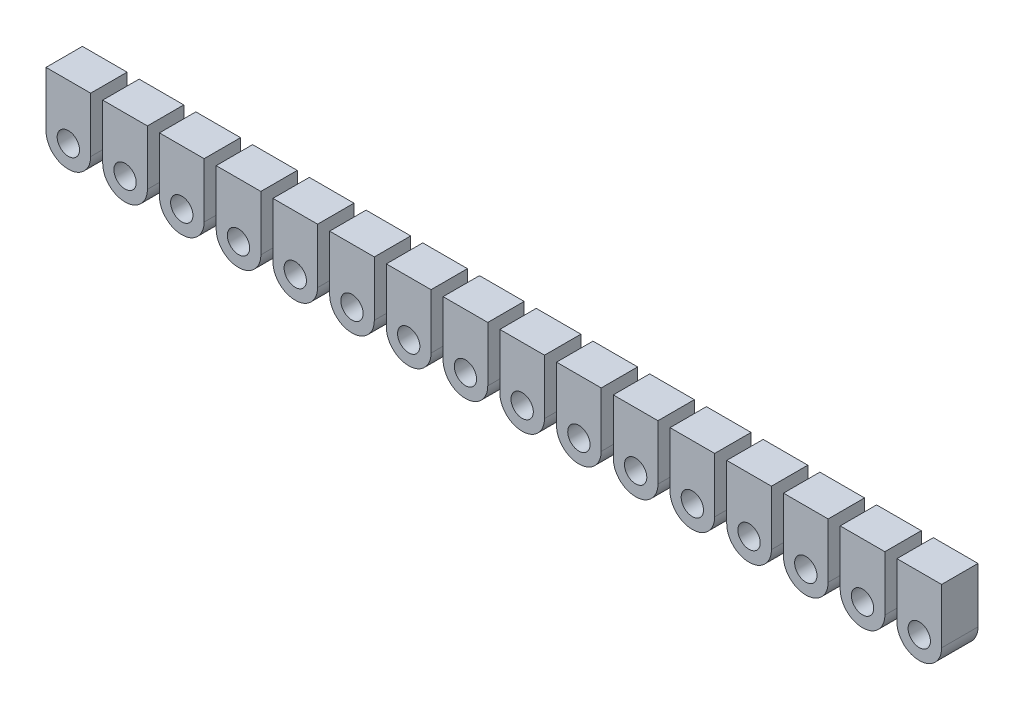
ISO-10303-21;
HEADER;
FILE_DESCRIPTION(('STEP AP214'),'2;1');
FILE_NAME('part.step','',(''),(''),'','','');
FILE_SCHEMA(('AUTOMOTIVE_DESIGN { 1 0 10303 214 1 1 1 1 }'));
ENDSEC;
DATA;
#1=APPLICATION_CONTEXT('core data for automotive mechanical design processes');
#2=APPLICATION_PROTOCOL_DEFINITION('international standard','automotive_design',2000,#1);
#3=PRODUCT_CONTEXT('',#1,'mechanical');
#4=PRODUCT('Part','Part','',(#3));
#5=PRODUCT_RELATED_PRODUCT_CATEGORY('part','',(#4));
#6=PRODUCT_DEFINITION_FORMATION('','',#4);
#7=PRODUCT_DEFINITION_CONTEXT('part definition',#1,'design');
#8=PRODUCT_DEFINITION('design','',#6,#7);
#9=PRODUCT_DEFINITION_SHAPE('','',#8);
#10=(LENGTH_UNIT() NAMED_UNIT(*) SI_UNIT(.MILLI.,.METRE.));
#11=(NAMED_UNIT(*) PLANE_ANGLE_UNIT() SI_UNIT($,.RADIAN.));
#12=(NAMED_UNIT(*) SI_UNIT($,.STERADIAN.) SOLID_ANGLE_UNIT());
#13=UNCERTAINTY_MEASURE_WITH_UNIT(LENGTH_MEASURE(1.E-05),#10,'distance_accuracy_value','');
#14=(GEOMETRIC_REPRESENTATION_CONTEXT(3) GLOBAL_UNCERTAINTY_ASSIGNED_CONTEXT((#13)) GLOBAL_UNIT_ASSIGNED_CONTEXT((#10,
#11,#12)) REPRESENTATION_CONTEXT('',''));
#15=CARTESIAN_POINT('',(0.,0.,0.));
#16=DIRECTION('',(0.,0.,1.));
#17=DIRECTION('',(1.,0.,0.));
#18=AXIS2_PLACEMENT_3D('',#15,#16,#17);
#19=CARTESIAN_POINT('',(11.0000034,56.50000638,-1.6199993));
#20=DIRECTION('',(0.,-1.,0.));
#21=DIRECTION('',(0.,0.,-1.));
#22=AXIS2_PLACEMENT_3D('',#19,#20,#21);
#23=PLANE('',#22);
#24=DIRECTION('',(1.,0.,0.));
#25=VECTOR('',#24,1.);
#26=CARTESIAN_POINT('',(11.0000034,56.50000638,-1.6199993));
#27=LINE('',#26,#25);
#28=CARTESIAN_POINT('',(9.99000232,56.50000638,-1.6199993));
#29=VERTEX_POINT('',#28);
#30=CARTESIAN_POINT('',(10.0100034,56.50000638,-1.6199993));
#31=VERTEX_POINT('',#30);
#32=EDGE_CURVE('P0_E108',#29,#31,#27,.T.);
#33=ORIENTED_EDGE('',*,*,#32,.T.);
#34=DIRECTION('',(0.,0.,1.));
#35=VECTOR('',#34,1.);
#36=CARTESIAN_POINT('',(10.0100034,56.50000638,-1.6199993));
#37=LINE('',#36,#35);
#38=CARTESIAN_POINT('',(10.0100034,56.50000638,0.00999998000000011));
#39=VERTEX_POINT('',#38);
#40=EDGE_CURVE('P0_E123',#39,#31,#37,.F.);
#41=ORIENTED_EDGE('',*,*,#40,.F.);
#42=DIRECTION('',(1.,0.,0.));
#43=VECTOR('',#42,1.);
#44=CARTESIAN_POINT('',(11.0000034,56.50000638,0.00999998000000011));
#45=LINE('',#44,#43);
#46=CARTESIAN_POINT('',(9.99000232,56.50000638,0.00999998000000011));
#47=VERTEX_POINT('',#46);
#48=EDGE_CURVE('P0_E35',#39,#47,#45,.F.);
#49=ORIENTED_EDGE('',*,*,#48,.T.);
#50=DIRECTION('',(0.,0.,1.));
#51=VECTOR('',#50,1.);
#52=CARTESIAN_POINT('',(9.99000232,56.50000638,-1.6199993));
#53=LINE('',#52,#51);
#54=EDGE_CURVE('P0_E132',#29,#47,#53,.T.);
#55=ORIENTED_EDGE('',*,*,#54,.F.);
#56=EDGE_LOOP('',(#33,#41,#49,#55));
#57=FACE_BOUND('',#56,.T.);
#58=ADVANCED_FACE('P0_F17',(#57),#23,.T.);
#59=CARTESIAN_POINT('',(11.0000034,59.9500071,-1.6199993));
#60=DIRECTION('',(0.,0.,1.));
#61=DIRECTION('',(1.,0.,0.));
#62=AXIS2_PLACEMENT_3D('',#59,#60,#61);
#63=PLANE('',#62);
#64=CARTESIAN_POINT('',(10.00000286,57.50000692,-1.6199993));
#65=DIRECTION('',(0.,0.,-1.));
#66=DIRECTION('',(-1.,0.,0.));
#67=AXIS2_PLACEMENT_3D('',#64,#65,#66);
#68=CIRCLE('',#67,0.499999);
#69=CARTESIAN_POINT('',(9.50000386,57.50000692,-1.6199993));
#70=VERTEX_POINT('',#69);
#71=EDGE_CURVE('P0_E97',#70,#70,#68,.F.);
#72=ORIENTED_EDGE('',*,*,#71,.T.);
#73=EDGE_LOOP('',(#72));
#74=FACE_BOUND('',#73,.T.);
#75=ORIENTED_EDGE('',*,*,#32,.F.);
#76=CARTESIAN_POINT('',(9.99000232,57.49000638,-1.6199993));
#77=DIRECTION('',(0.,0.,1.));
#78=DIRECTION('',(1.,0.,0.));
#79=AXIS2_PLACEMENT_3D('',#76,#77,#78);
#80=CIRCLE('',#79,0.99);
#81=CARTESIAN_POINT('',(9.00000232,57.49000638,-1.6199993));
#82=VERTEX_POINT('',#81);
#83=EDGE_CURVE('P0_E20',#82,#29,#80,.T.);
#84=ORIENTED_EDGE('',*,*,#83,.F.);
#85=DIRECTION('',(0.,1.,0.));
#86=VECTOR('',#85,1.);
#87=CARTESIAN_POINT('',(9.00000232,56.50000638,-1.6199993));
#88=LINE('',#87,#86);
#89=CARTESIAN_POINT('',(9.00000232,59.9500071,-1.6199993));
#90=VERTEX_POINT('',#89);
#91=EDGE_CURVE('P0_E84',#90,#82,#88,.F.);
#92=ORIENTED_EDGE('',*,*,#91,.F.);
#93=DIRECTION('',(1.,0.,0.));
#94=VECTOR('',#93,1.);
#95=CARTESIAN_POINT('',(9.00000232,59.9500071,-1.6199993));
#96=LINE('',#95,#94);
#97=CARTESIAN_POINT('',(11.0000034,59.9500071,-1.6199993));
#98=VERTEX_POINT('',#97);
#99=EDGE_CURVE('P0_E69',#98,#90,#96,.F.);
#100=ORIENTED_EDGE('',*,*,#99,.F.);
#101=DIRECTION('',(0.,1.,0.));
#102=VECTOR('',#101,1.);
#103=CARTESIAN_POINT('',(11.0000034,59.9500071,-1.6199993));
#104=LINE('',#103,#102);
#105=CARTESIAN_POINT('',(11.0000034,57.49000638,-1.6199993));
#106=VERTEX_POINT('',#105);
#107=EDGE_CURVE('P0_E105',#106,#98,#104,.T.);
#108=ORIENTED_EDGE('',*,*,#107,.F.);
#109=CARTESIAN_POINT('',(10.0100034,57.49000638,-1.6199993));
#110=DIRECTION('',(0.,0.,1.));
#111=DIRECTION('',(1.,0.,0.));
#112=AXIS2_PLACEMENT_3D('',#109,#110,#111);
#113=CIRCLE('',#112,0.99);
#114=EDGE_CURVE('P0_E124',#31,#106,#113,.T.);
#115=ORIENTED_EDGE('',*,*,#114,.F.);
#116=EDGE_LOOP('',(#75,#84,#92,#100,#108,#115));
#117=FACE_BOUND('',#116,.T.);
#118=ADVANCED_FACE('P0_F146',(#74,#117),#63,.F.);
#119=CARTESIAN_POINT('',(11.0000034,59.9500071,-1.6199993));
#120=DIRECTION('',(1.,0.,0.));
#121=DIRECTION('',(0.,0.,-1.));
#122=AXIS2_PLACEMENT_3D('',#119,#120,#121);
#123=PLANE('',#122);
#124=ORIENTED_EDGE('',*,*,#107,.T.);
#125=DIRECTION('',(0.,0.,1.));
#126=VECTOR('',#125,1.);
#127=CARTESIAN_POINT('',(11.0000034,59.9500071,-1.6199993));
#128=LINE('',#127,#126);
#129=CARTESIAN_POINT('',(11.0000034,59.9500071,0.00999998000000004));
#130=VERTEX_POINT('',#129);
#131=EDGE_CURVE('P0_E74',#130,#98,#128,.F.);
#132=ORIENTED_EDGE('',*,*,#131,.F.);
#133=DIRECTION('',(0.,1.,0.));
#134=VECTOR('',#133,1.);
#135=CARTESIAN_POINT('',(11.0000034,59.9500071,0.00999998));
#136=LINE('',#135,#134);
#137=CARTESIAN_POINT('',(11.0000034,57.49000638,0.00999998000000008));
#138=VERTEX_POINT('',#137);
#139=EDGE_CURVE('P0_E95',#138,#130,#136,.T.);
#140=ORIENTED_EDGE('',*,*,#139,.F.);
#141=DIRECTION('',(0.,0.,1.));
#142=VECTOR('',#141,1.);
#143=CARTESIAN_POINT('',(11.0000034,57.49000638,-1.6199993));
#144=LINE('',#143,#142);
#145=EDGE_CURVE('P0_E126',#106,#138,#144,.T.);
#146=ORIENTED_EDGE('',*,*,#145,.F.);
#147=EDGE_LOOP('',(#124,#132,#140,#146));
#148=FACE_BOUND('',#147,.T.);
#149=ADVANCED_FACE('P0_F148',(#148),#123,.T.);
#150=CARTESIAN_POINT('',(9.00000232,59.9500071,-1.6199993));
#151=DIRECTION('',(0.,1.,0.));
#152=DIRECTION('',(0.,0.,1.));
#153=AXIS2_PLACEMENT_3D('',#150,#151,#152);
#154=PLANE('',#153);
#155=ORIENTED_EDGE('',*,*,#131,.T.);
#156=ORIENTED_EDGE('',*,*,#99,.T.);
#157=DIRECTION('',(0.,0.,1.));
#158=VECTOR('',#157,1.);
#159=CARTESIAN_POINT('',(9.00000232,59.9500071,-1.6199993));
#160=LINE('',#159,#158);
#161=CARTESIAN_POINT('',(9.00000232,59.9500071,0.00999998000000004));
#162=VERTEX_POINT('',#161);
#163=EDGE_CURVE('P0_E77',#162,#90,#160,.F.);
#164=ORIENTED_EDGE('',*,*,#163,.F.);
#165=DIRECTION('',(1.,0.,0.));
#166=VECTOR('',#165,1.);
#167=CARTESIAN_POINT('',(11.0000034,59.9500071,0.00999998));
#168=LINE('',#167,#166);
#169=EDGE_CURVE('P0_E81',#130,#162,#168,.F.);
#170=ORIENTED_EDGE('',*,*,#169,.F.);
#171=EDGE_LOOP('',(#155,#156,#164,#170));
#172=FACE_BOUND('',#171,.T.);
#173=ADVANCED_FACE('P0_F79',(#172),#154,.T.);
#174=CARTESIAN_POINT('',(9.00000232,56.50000638,-1.6199993));
#175=DIRECTION('',(-1.,0.,0.));
#176=DIRECTION('',(0.,0.,1.));
#177=AXIS2_PLACEMENT_3D('',#174,#175,#176);
#178=PLANE('',#177);
#179=ORIENTED_EDGE('',*,*,#91,.T.);
#180=DIRECTION('',(0.,0.,1.));
#181=VECTOR('',#180,1.);
#182=CARTESIAN_POINT('',(9.00000232,57.49000638,-1.6199993));
#183=LINE('',#182,#181);
#184=CARTESIAN_POINT('',(9.00000232,57.49000638,0.00999998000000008));
#185=VERTEX_POINT('',#184);
#186=EDGE_CURVE('P0_E90',#185,#82,#183,.F.);
#187=ORIENTED_EDGE('',*,*,#186,.F.);
#188=DIRECTION('',(0.,1.,0.));
#189=VECTOR('',#188,1.);
#190=CARTESIAN_POINT('',(9.00000232,59.9500071,0.00999998));
#191=LINE('',#190,#189);
#192=EDGE_CURVE('P0_E87',#162,#185,#191,.F.);
#193=ORIENTED_EDGE('',*,*,#192,.F.);
#194=ORIENTED_EDGE('',*,*,#163,.T.);
#195=EDGE_LOOP('',(#179,#187,#193,#194));
#196=FACE_BOUND('',#195,.T.);
#197=ADVANCED_FACE('P0_F88',(#196),#178,.T.);
#198=CARTESIAN_POINT('',(9.99000232,57.49000638,-1.6199993));
#199=DIRECTION('',(0.,0.,1.));
#200=DIRECTION('',(1.,0.,0.));
#201=AXIS2_PLACEMENT_3D('',#198,#199,#200);
#202=CYLINDRICAL_SURFACE('',#201,0.99);
#203=CARTESIAN_POINT('',(9.99000232,57.49000638,0.00999998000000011));
#204=DIRECTION('',(0.,0.,1.));
#205=DIRECTION('',(1.,0.,0.));
#206=AXIS2_PLACEMENT_3D('',#203,#204,#205);
#207=CIRCLE('',#206,0.99);
#208=EDGE_CURVE('P0_E92',#185,#47,#207,.T.);
#209=ORIENTED_EDGE('',*,*,#208,.F.);
#210=ORIENTED_EDGE('',*,*,#186,.T.);
#211=ORIENTED_EDGE('',*,*,#83,.T.);
#212=ORIENTED_EDGE('',*,*,#54,.T.);
#213=EDGE_LOOP('',(#209,#210,#211,#212));
#214=FACE_BOUND('',#213,.T.);
#215=ADVANCED_FACE('P0_F170',(#214),#202,.T.);
#216=CARTESIAN_POINT('',(10.0100034,57.49000638,-1.6199993));
#217=DIRECTION('',(0.,0.,1.));
#218=DIRECTION('',(1.,0.,0.));
#219=AXIS2_PLACEMENT_3D('',#216,#217,#218);
#220=CYLINDRICAL_SURFACE('',#219,0.99);
#221=CARTESIAN_POINT('',(10.0100034,57.49000638,0.00999998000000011));
#222=DIRECTION('',(0.,0.,1.));
#223=DIRECTION('',(1.,0.,0.));
#224=AXIS2_PLACEMENT_3D('',#221,#222,#223);
#225=CIRCLE('',#224,0.99);
#226=EDGE_CURVE('P0_E26',#39,#138,#225,.T.);
#227=ORIENTED_EDGE('',*,*,#226,.F.);
#228=ORIENTED_EDGE('',*,*,#40,.T.);
#229=ORIENTED_EDGE('',*,*,#114,.T.);
#230=ORIENTED_EDGE('',*,*,#145,.T.);
#231=EDGE_LOOP('',(#227,#228,#229,#230));
#232=FACE_BOUND('',#231,.T.);
#233=ADVANCED_FACE('P0_F143',(#232),#220,.T.);
#234=CARTESIAN_POINT('',(10.00000286,57.50000692,-1.79999894));
#235=DIRECTION('',(0.,0.,-1.));
#236=DIRECTION('',(-1.,0.,0.));
#237=AXIS2_PLACEMENT_3D('',#234,#235,#236);
#238=CYLINDRICAL_SURFACE('',#237,0.499999);
#239=ORIENTED_EDGE('',*,*,#71,.F.);
#240=EDGE_LOOP('',(#239));
#241=FACE_BOUND('',#240,.T.);
#242=CARTESIAN_POINT('',(10.00000286,57.50000692,0.00999998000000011));
#243=DIRECTION('',(0.,0.,-1.));
#244=DIRECTION('',(-1.,0.,0.));
#245=AXIS2_PLACEMENT_3D('',#242,#243,#244);
#246=CIRCLE('',#245,0.499999);
#247=CARTESIAN_POINT('',(9.50000386,57.50000692,0.00999998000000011));
#248=VERTEX_POINT('',#247);
#249=EDGE_CURVE('P0_E11',#248,#248,#246,.T.);
#250=ORIENTED_EDGE('',*,*,#249,.F.);
#251=EDGE_LOOP('',(#250));
#252=FACE_BOUND('',#251,.T.);
#253=ADVANCED_FACE('P0_F159',(#241,#252),#238,.F.);
#254=CARTESIAN_POINT('',(11.0000034,59.9500071,0.00999998));
#255=DIRECTION('',(0.,0.,1.));
#256=DIRECTION('',(1.,0.,0.));
#257=AXIS2_PLACEMENT_3D('',#254,#255,#256);
#258=PLANE('',#257);
#259=ORIENTED_EDGE('',*,*,#249,.T.);
#260=EDGE_LOOP('',(#259));
#261=FACE_BOUND('',#260,.T.);
#262=ORIENTED_EDGE('',*,*,#48,.F.);
#263=ORIENTED_EDGE('',*,*,#226,.T.);
#264=ORIENTED_EDGE('',*,*,#139,.T.);
#265=ORIENTED_EDGE('',*,*,#169,.T.);
#266=ORIENTED_EDGE('',*,*,#192,.T.);
#267=ORIENTED_EDGE('',*,*,#208,.T.);
#268=EDGE_LOOP('',(#262,#263,#264,#265,#266,#267));
#269=FACE_BOUND('',#268,.T.);
#270=ADVANCED_FACE('P0_F94',(#261,#269),#258,.T.);
#271=CLOSED_SHELL('',(#58,#118,#149,#173,#197,#215,#233,#253,#270));
#272=MANIFOLD_SOLID_BREP('P0_B1',#271);
#273=CARTESIAN_POINT('',(49.1000034,56.50000638,-1.6199993));
#274=DIRECTION('',(0.,-1.,0.));
#275=DIRECTION('',(0.,0.,-1.));
#276=AXIS2_PLACEMENT_3D('',#273,#274,#275);
#277=PLANE('',#276);
#278=DIRECTION('',(1.,0.,0.));
#279=VECTOR('',#278,1.);
#280=CARTESIAN_POINT('',(49.1000034,56.50000638,-1.6199993));
#281=LINE('',#280,#279);
#282=CARTESIAN_POINT('',(48.09000232,56.50000638,-1.6199993));
#283=VERTEX_POINT('',#282);
#284=CARTESIAN_POINT('',(48.1100034,56.50000638,-1.6199993));
#285=VERTEX_POINT('',#284);
#286=EDGE_CURVE('P1_E108',#283,#285,#281,.T.);
#287=ORIENTED_EDGE('',*,*,#286,.T.);
#288=DIRECTION('',(0.,0.,1.));
#289=VECTOR('',#288,1.);
#290=CARTESIAN_POINT('',(48.1100034,56.50000638,-1.6199993));
#291=LINE('',#290,#289);
#292=CARTESIAN_POINT('',(48.1100034,56.50000638,0.00999998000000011));
#293=VERTEX_POINT('',#292);
#294=EDGE_CURVE('P1_E123',#293,#285,#291,.F.);
#295=ORIENTED_EDGE('',*,*,#294,.F.);
#296=DIRECTION('',(1.,0.,0.));
#297=VECTOR('',#296,1.);
#298=CARTESIAN_POINT('',(49.1000034,56.50000638,0.00999998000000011));
#299=LINE('',#298,#297);
#300=CARTESIAN_POINT('',(48.09000232,56.50000638,0.00999998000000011));
#301=VERTEX_POINT('',#300);
#302=EDGE_CURVE('P1_E35',#293,#301,#299,.F.);
#303=ORIENTED_EDGE('',*,*,#302,.T.);
#304=DIRECTION('',(0.,0.,1.));
#305=VECTOR('',#304,1.);
#306=CARTESIAN_POINT('',(48.09000232,56.50000638,-1.6199993));
#307=LINE('',#306,#305);
#308=EDGE_CURVE('P1_E132',#283,#301,#307,.T.);
#309=ORIENTED_EDGE('',*,*,#308,.F.);
#310=EDGE_LOOP('',(#287,#295,#303,#309));
#311=FACE_BOUND('',#310,.T.);
#312=ADVANCED_FACE('P1_F17',(#311),#277,.T.);
#313=CARTESIAN_POINT('',(49.1000034,59.9500071,-1.6199993));
#314=DIRECTION('',(0.,0.,1.));
#315=DIRECTION('',(1.,0.,0.));
#316=AXIS2_PLACEMENT_3D('',#313,#314,#315);
#317=PLANE('',#316);
#318=CARTESIAN_POINT('',(48.10000286,57.50000692,-1.6199993));
#319=DIRECTION('',(0.,0.,-1.));
#320=DIRECTION('',(-1.,0.,0.));
#321=AXIS2_PLACEMENT_3D('',#318,#319,#320);
#322=CIRCLE('',#321,0.499999);
#323=CARTESIAN_POINT('',(47.60000386,57.50000692,-1.6199993));
#324=VERTEX_POINT('',#323);
#325=EDGE_CURVE('P1_E97',#324,#324,#322,.F.);
#326=ORIENTED_EDGE('',*,*,#325,.T.);
#327=EDGE_LOOP('',(#326));
#328=FACE_BOUND('',#327,.T.);
#329=ORIENTED_EDGE('',*,*,#286,.F.);
#330=CARTESIAN_POINT('',(48.09000232,57.49000638,-1.6199993));
#331=DIRECTION('',(0.,0.,1.));
#332=DIRECTION('',(1.,0.,0.));
#333=AXIS2_PLACEMENT_3D('',#330,#331,#332);
#334=CIRCLE('',#333,0.99);
#335=CARTESIAN_POINT('',(47.10000232,57.49000638,-1.6199993));
#336=VERTEX_POINT('',#335);
#337=EDGE_CURVE('P1_E20',#336,#283,#334,.T.);
#338=ORIENTED_EDGE('',*,*,#337,.F.);
#339=DIRECTION('',(0.,1.,0.));
#340=VECTOR('',#339,1.);
#341=CARTESIAN_POINT('',(47.10000232,56.50000638,-1.6199993));
#342=LINE('',#341,#340);
#343=CARTESIAN_POINT('',(47.10000232,59.9500071,-1.6199993));
#344=VERTEX_POINT('',#343);
#345=EDGE_CURVE('P1_E84',#344,#336,#342,.F.);
#346=ORIENTED_EDGE('',*,*,#345,.F.);
#347=DIRECTION('',(1.,0.,0.));
#348=VECTOR('',#347,1.);
#349=CARTESIAN_POINT('',(47.10000232,59.9500071,-1.6199993));
#350=LINE('',#349,#348);
#351=CARTESIAN_POINT('',(49.1000034,59.9500071,-1.6199993));
#352=VERTEX_POINT('',#351);
#353=EDGE_CURVE('P1_E69',#352,#344,#350,.F.);
#354=ORIENTED_EDGE('',*,*,#353,.F.);
#355=DIRECTION('',(0.,1.,0.));
#356=VECTOR('',#355,1.);
#357=CARTESIAN_POINT('',(49.1000034,59.9500071,-1.6199993));
#358=LINE('',#357,#356);
#359=CARTESIAN_POINT('',(49.1000034,57.49000638,-1.6199993));
#360=VERTEX_POINT('',#359);
#361=EDGE_CURVE('P1_E105',#360,#352,#358,.T.);
#362=ORIENTED_EDGE('',*,*,#361,.F.);
#363=CARTESIAN_POINT('',(48.1100034,57.49000638,-1.6199993));
#364=DIRECTION('',(0.,0.,1.));
#365=DIRECTION('',(1.,0.,0.));
#366=AXIS2_PLACEMENT_3D('',#363,#364,#365);
#367=CIRCLE('',#366,0.99);
#368=EDGE_CURVE('P1_E124',#285,#360,#367,.T.);
#369=ORIENTED_EDGE('',*,*,#368,.F.);
#370=EDGE_LOOP('',(#329,#338,#346,#354,#362,#369));
#371=FACE_BOUND('',#370,.T.);
#372=ADVANCED_FACE('P1_F146',(#328,#371),#317,.F.);
#373=CARTESIAN_POINT('',(49.1000034,59.9500071,-1.6199993));
#374=DIRECTION('',(1.,0.,0.));
#375=DIRECTION('',(0.,0.,-1.));
#376=AXIS2_PLACEMENT_3D('',#373,#374,#375);
#377=PLANE('',#376);
#378=ORIENTED_EDGE('',*,*,#361,.T.);
#379=DIRECTION('',(0.,0.,1.));
#380=VECTOR('',#379,1.);
#381=CARTESIAN_POINT('',(49.1000034,59.9500071,-1.6199993));
#382=LINE('',#381,#380);
#383=CARTESIAN_POINT('',(49.1000034,59.9500071,0.00999998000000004));
#384=VERTEX_POINT('',#383);
#385=EDGE_CURVE('P1_E74',#384,#352,#382,.F.);
#386=ORIENTED_EDGE('',*,*,#385,.F.);
#387=DIRECTION('',(0.,1.,0.));
#388=VECTOR('',#387,1.);
#389=CARTESIAN_POINT('',(49.1000034,59.9500071,0.00999998));
#390=LINE('',#389,#388);
#391=CARTESIAN_POINT('',(49.1000034,57.49000638,0.00999998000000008));
#392=VERTEX_POINT('',#391);
#393=EDGE_CURVE('P1_E95',#392,#384,#390,.T.);
#394=ORIENTED_EDGE('',*,*,#393,.F.);
#395=DIRECTION('',(0.,0.,1.));
#396=VECTOR('',#395,1.);
#397=CARTESIAN_POINT('',(49.1000034,57.49000638,-1.6199993));
#398=LINE('',#397,#396);
#399=EDGE_CURVE('P1_E126',#360,#392,#398,.T.);
#400=ORIENTED_EDGE('',*,*,#399,.F.);
#401=EDGE_LOOP('',(#378,#386,#394,#400));
#402=FACE_BOUND('',#401,.T.);
#403=ADVANCED_FACE('P1_F148',(#402),#377,.T.);
#404=CARTESIAN_POINT('',(47.10000232,59.9500071,-1.6199993));
#405=DIRECTION('',(0.,1.,0.));
#406=DIRECTION('',(0.,0.,1.));
#407=AXIS2_PLACEMENT_3D('',#404,#405,#406);
#408=PLANE('',#407);
#409=ORIENTED_EDGE('',*,*,#385,.T.);
#410=ORIENTED_EDGE('',*,*,#353,.T.);
#411=DIRECTION('',(0.,0.,1.));
#412=VECTOR('',#411,1.);
#413=CARTESIAN_POINT('',(47.10000232,59.9500071,-1.6199993));
#414=LINE('',#413,#412);
#415=CARTESIAN_POINT('',(47.10000232,59.9500071,0.00999998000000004));
#416=VERTEX_POINT('',#415);
#417=EDGE_CURVE('P1_E77',#416,#344,#414,.F.);
#418=ORIENTED_EDGE('',*,*,#417,.F.);
#419=DIRECTION('',(1.,0.,0.));
#420=VECTOR('',#419,1.);
#421=CARTESIAN_POINT('',(49.1000034,59.9500071,0.00999998));
#422=LINE('',#421,#420);
#423=EDGE_CURVE('P1_E81',#384,#416,#422,.F.);
#424=ORIENTED_EDGE('',*,*,#423,.F.);
#425=EDGE_LOOP('',(#409,#410,#418,#424));
#426=FACE_BOUND('',#425,.T.);
#427=ADVANCED_FACE('P1_F79',(#426),#408,.T.);
#428=CARTESIAN_POINT('',(47.10000232,56.50000638,-1.6199993));
#429=DIRECTION('',(-1.,0.,0.));
#430=DIRECTION('',(0.,0.,1.));
#431=AXIS2_PLACEMENT_3D('',#428,#429,#430);
#432=PLANE('',#431);
#433=ORIENTED_EDGE('',*,*,#345,.T.);
#434=DIRECTION('',(0.,0.,1.));
#435=VECTOR('',#434,1.);
#436=CARTESIAN_POINT('',(47.10000232,57.49000638,-1.6199993));
#437=LINE('',#436,#435);
#438=CARTESIAN_POINT('',(47.10000232,57.49000638,0.00999998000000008));
#439=VERTEX_POINT('',#438);
#440=EDGE_CURVE('P1_E90',#439,#336,#437,.F.);
#441=ORIENTED_EDGE('',*,*,#440,.F.);
#442=DIRECTION('',(0.,1.,0.));
#443=VECTOR('',#442,1.);
#444=CARTESIAN_POINT('',(47.10000232,59.9500071,0.00999998));
#445=LINE('',#444,#443);
#446=EDGE_CURVE('P1_E87',#416,#439,#445,.F.);
#447=ORIENTED_EDGE('',*,*,#446,.F.);
#448=ORIENTED_EDGE('',*,*,#417,.T.);
#449=EDGE_LOOP('',(#433,#441,#447,#448));
#450=FACE_BOUND('',#449,.T.);
#451=ADVANCED_FACE('P1_F88',(#450),#432,.T.);
#452=CARTESIAN_POINT('',(48.09000232,57.49000638,-1.6199993));
#453=DIRECTION('',(0.,0.,1.));
#454=DIRECTION('',(1.,0.,0.));
#455=AXIS2_PLACEMENT_3D('',#452,#453,#454);
#456=CYLINDRICAL_SURFACE('',#455,0.99);
#457=CARTESIAN_POINT('',(48.09000232,57.49000638,0.00999998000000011));
#458=DIRECTION('',(0.,0.,1.));
#459=DIRECTION('',(1.,0.,0.));
#460=AXIS2_PLACEMENT_3D('',#457,#458,#459);
#461=CIRCLE('',#460,0.99);
#462=EDGE_CURVE('P1_E92',#439,#301,#461,.T.);
#463=ORIENTED_EDGE('',*,*,#462,.F.);
#464=ORIENTED_EDGE('',*,*,#440,.T.);
#465=ORIENTED_EDGE('',*,*,#337,.T.);
#466=ORIENTED_EDGE('',*,*,#308,.T.);
#467=EDGE_LOOP('',(#463,#464,#465,#466));
#468=FACE_BOUND('',#467,.T.);
#469=ADVANCED_FACE('P1_F170',(#468),#456,.T.);
#470=CARTESIAN_POINT('',(48.1100034,57.49000638,-1.6199993));
#471=DIRECTION('',(0.,0.,1.));
#472=DIRECTION('',(1.,0.,0.));
#473=AXIS2_PLACEMENT_3D('',#470,#471,#472);
#474=CYLINDRICAL_SURFACE('',#473,0.99);
#475=CARTESIAN_POINT('',(48.1100034,57.49000638,0.00999998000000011));
#476=DIRECTION('',(0.,0.,1.));
#477=DIRECTION('',(1.,0.,0.));
#478=AXIS2_PLACEMENT_3D('',#475,#476,#477);
#479=CIRCLE('',#478,0.99);
#480=EDGE_CURVE('P1_E26',#293,#392,#479,.T.);
#481=ORIENTED_EDGE('',*,*,#480,.F.);
#482=ORIENTED_EDGE('',*,*,#294,.T.);
#483=ORIENTED_EDGE('',*,*,#368,.T.);
#484=ORIENTED_EDGE('',*,*,#399,.T.);
#485=EDGE_LOOP('',(#481,#482,#483,#484));
#486=FACE_BOUND('',#485,.T.);
#487=ADVANCED_FACE('P1_F143',(#486),#474,.T.);
#488=CARTESIAN_POINT('',(48.10000286,57.50000692,-1.79999894));
#489=DIRECTION('',(0.,0.,-1.));
#490=DIRECTION('',(-1.,0.,0.));
#491=AXIS2_PLACEMENT_3D('',#488,#489,#490);
#492=CYLINDRICAL_SURFACE('',#491,0.499999);
#493=ORIENTED_EDGE('',*,*,#325,.F.);
#494=EDGE_LOOP('',(#493));
#495=FACE_BOUND('',#494,.T.);
#496=CARTESIAN_POINT('',(48.10000286,57.50000692,0.00999998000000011));
#497=DIRECTION('',(0.,0.,-1.));
#498=DIRECTION('',(-1.,0.,0.));
#499=AXIS2_PLACEMENT_3D('',#496,#497,#498);
#500=CIRCLE('',#499,0.499999);
#501=CARTESIAN_POINT('',(47.60000386,57.50000692,0.00999998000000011));
#502=VERTEX_POINT('',#501);
#503=EDGE_CURVE('P1_E11',#502,#502,#500,.T.);
#504=ORIENTED_EDGE('',*,*,#503,.F.);
#505=EDGE_LOOP('',(#504));
#506=FACE_BOUND('',#505,.T.);
#507=ADVANCED_FACE('P1_F159',(#495,#506),#492,.F.);
#508=CARTESIAN_POINT('',(49.1000034,59.9500071,0.00999998));
#509=DIRECTION('',(0.,0.,1.));
#510=DIRECTION('',(1.,0.,0.));
#511=AXIS2_PLACEMENT_3D('',#508,#509,#510);
#512=PLANE('',#511);
#513=ORIENTED_EDGE('',*,*,#503,.T.);
#514=EDGE_LOOP('',(#513));
#515=FACE_BOUND('',#514,.T.);
#516=ORIENTED_EDGE('',*,*,#302,.F.);
#517=ORIENTED_EDGE('',*,*,#480,.T.);
#518=ORIENTED_EDGE('',*,*,#393,.T.);
#519=ORIENTED_EDGE('',*,*,#423,.T.);
#520=ORIENTED_EDGE('',*,*,#446,.T.);
#521=ORIENTED_EDGE('',*,*,#462,.T.);
#522=EDGE_LOOP('',(#516,#517,#518,#519,#520,#521));
#523=FACE_BOUND('',#522,.T.);
#524=ADVANCED_FACE('P1_F94',(#515,#523),#512,.T.);
#525=CLOSED_SHELL('',(#312,#372,#403,#427,#451,#469,#487,#507,#524));
#526=MANIFOLD_SOLID_BREP('P1_B1',#525);
#527=CARTESIAN_POINT('',(41.4800034,56.50000638,-1.6199993));
#528=DIRECTION('',(0.,-1.,0.));
#529=DIRECTION('',(0.,0.,-1.));
#530=AXIS2_PLACEMENT_3D('',#527,#528,#529);
#531=PLANE('',#530);
#532=DIRECTION('',(1.,0.,0.));
#533=VECTOR('',#532,1.);
#534=CARTESIAN_POINT('',(41.4800034,56.50000638,-1.6199993));
#535=LINE('',#534,#533);
#536=CARTESIAN_POINT('',(40.47000232,56.50000638,-1.6199993));
#537=VERTEX_POINT('',#536);
#538=CARTESIAN_POINT('',(40.4900034,56.50000638,-1.6199993));
#539=VERTEX_POINT('',#538);
#540=EDGE_CURVE('P2_E108',#537,#539,#535,.T.);
#541=ORIENTED_EDGE('',*,*,#540,.T.);
#542=DIRECTION('',(0.,0.,1.));
#543=VECTOR('',#542,1.);
#544=CARTESIAN_POINT('',(40.4900034,56.50000638,-1.6199993));
#545=LINE('',#544,#543);
#546=CARTESIAN_POINT('',(40.4900034,56.50000638,0.00999998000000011));
#547=VERTEX_POINT('',#546);
#548=EDGE_CURVE('P2_E123',#547,#539,#545,.F.);
#549=ORIENTED_EDGE('',*,*,#548,.F.);
#550=DIRECTION('',(1.,0.,0.));
#551=VECTOR('',#550,1.);
#552=CARTESIAN_POINT('',(41.4800034,56.50000638,0.00999998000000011));
#553=LINE('',#552,#551);
#554=CARTESIAN_POINT('',(40.47000232,56.50000638,0.00999998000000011));
#555=VERTEX_POINT('',#554);
#556=EDGE_CURVE('P2_E35',#547,#555,#553,.F.);
#557=ORIENTED_EDGE('',*,*,#556,.T.);
#558=DIRECTION('',(0.,0.,1.));
#559=VECTOR('',#558,1.);
#560=CARTESIAN_POINT('',(40.47000232,56.50000638,-1.6199993));
#561=LINE('',#560,#559);
#562=EDGE_CURVE('P2_E132',#537,#555,#561,.T.);
#563=ORIENTED_EDGE('',*,*,#562,.F.);
#564=EDGE_LOOP('',(#541,#549,#557,#563));
#565=FACE_BOUND('',#564,.T.);
#566=ADVANCED_FACE('P2_F17',(#565),#531,.T.);
#567=CARTESIAN_POINT('',(41.4800034,59.9500071,-1.6199993));
#568=DIRECTION('',(0.,0.,1.));
#569=DIRECTION('',(1.,0.,0.));
#570=AXIS2_PLACEMENT_3D('',#567,#568,#569);
#571=PLANE('',#570);
#572=CARTESIAN_POINT('',(40.48000286,57.50000692,-1.6199993));
#573=DIRECTION('',(0.,0.,-1.));
#574=DIRECTION('',(-1.,0.,0.));
#575=AXIS2_PLACEMENT_3D('',#572,#573,#574);
#576=CIRCLE('',#575,0.499999);
#577=CARTESIAN_POINT('',(39.98000386,57.50000692,-1.6199993));
#578=VERTEX_POINT('',#577);
#579=EDGE_CURVE('P2_E97',#578,#578,#576,.F.);
#580=ORIENTED_EDGE('',*,*,#579,.T.);
#581=EDGE_LOOP('',(#580));
#582=FACE_BOUND('',#581,.T.);
#583=ORIENTED_EDGE('',*,*,#540,.F.);
#584=CARTESIAN_POINT('',(40.47000232,57.49000638,-1.6199993));
#585=DIRECTION('',(0.,0.,1.));
#586=DIRECTION('',(1.,0.,0.));
#587=AXIS2_PLACEMENT_3D('',#584,#585,#586);
#588=CIRCLE('',#587,0.99);
#589=CARTESIAN_POINT('',(39.48000232,57.49000638,-1.6199993));
#590=VERTEX_POINT('',#589);
#591=EDGE_CURVE('P2_E20',#590,#537,#588,.T.);
#592=ORIENTED_EDGE('',*,*,#591,.F.);
#593=DIRECTION('',(0.,1.,0.));
#594=VECTOR('',#593,1.);
#595=CARTESIAN_POINT('',(39.48000232,56.50000638,-1.6199993));
#596=LINE('',#595,#594);
#597=CARTESIAN_POINT('',(39.48000232,59.9500071,-1.6199993));
#598=VERTEX_POINT('',#597);
#599=EDGE_CURVE('P2_E84',#598,#590,#596,.F.);
#600=ORIENTED_EDGE('',*,*,#599,.F.);
#601=DIRECTION('',(1.,0.,0.));
#602=VECTOR('',#601,1.);
#603=CARTESIAN_POINT('',(39.48000232,59.9500071,-1.6199993));
#604=LINE('',#603,#602);
#605=CARTESIAN_POINT('',(41.4800034,59.9500071,-1.6199993));
#606=VERTEX_POINT('',#605);
#607=EDGE_CURVE('P2_E69',#606,#598,#604,.F.);
#608=ORIENTED_EDGE('',*,*,#607,.F.);
#609=DIRECTION('',(0.,1.,0.));
#610=VECTOR('',#609,1.);
#611=CARTESIAN_POINT('',(41.4800034,59.9500071,-1.6199993));
#612=LINE('',#611,#610);
#613=CARTESIAN_POINT('',(41.4800034,57.49000638,-1.6199993));
#614=VERTEX_POINT('',#613);
#615=EDGE_CURVE('P2_E105',#614,#606,#612,.T.);
#616=ORIENTED_EDGE('',*,*,#615,.F.);
#617=CARTESIAN_POINT('',(40.4900034,57.49000638,-1.6199993));
#618=DIRECTION('',(0.,0.,1.));
#619=DIRECTION('',(1.,0.,0.));
#620=AXIS2_PLACEMENT_3D('',#617,#618,#619);
#621=CIRCLE('',#620,0.99);
#622=EDGE_CURVE('P2_E124',#539,#614,#621,.T.);
#623=ORIENTED_EDGE('',*,*,#622,.F.);
#624=EDGE_LOOP('',(#583,#592,#600,#608,#616,#623));
#625=FACE_BOUND('',#624,.T.);
#626=ADVANCED_FACE('P2_F146',(#582,#625),#571,.F.);
#627=CARTESIAN_POINT('',(41.4800034,59.9500071,-1.6199993));
#628=DIRECTION('',(1.,0.,0.));
#629=DIRECTION('',(0.,0.,-1.));
#630=AXIS2_PLACEMENT_3D('',#627,#628,#629);
#631=PLANE('',#630);
#632=ORIENTED_EDGE('',*,*,#615,.T.);
#633=DIRECTION('',(0.,0.,1.));
#634=VECTOR('',#633,1.);
#635=CARTESIAN_POINT('',(41.4800034,59.9500071,-1.6199993));
#636=LINE('',#635,#634);
#637=CARTESIAN_POINT('',(41.4800034,59.9500071,0.00999998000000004));
#638=VERTEX_POINT('',#637);
#639=EDGE_CURVE('P2_E74',#638,#606,#636,.F.);
#640=ORIENTED_EDGE('',*,*,#639,.F.);
#641=DIRECTION('',(0.,1.,0.));
#642=VECTOR('',#641,1.);
#643=CARTESIAN_POINT('',(41.4800034,59.9500071,0.00999998));
#644=LINE('',#643,#642);
#645=CARTESIAN_POINT('',(41.4800034,57.49000638,0.00999998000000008));
#646=VERTEX_POINT('',#645);
#647=EDGE_CURVE('P2_E95',#646,#638,#644,.T.);
#648=ORIENTED_EDGE('',*,*,#647,.F.);
#649=DIRECTION('',(0.,0.,1.));
#650=VECTOR('',#649,1.);
#651=CARTESIAN_POINT('',(41.4800034,57.49000638,-1.6199993));
#652=LINE('',#651,#650);
#653=EDGE_CURVE('P2_E126',#614,#646,#652,.T.);
#654=ORIENTED_EDGE('',*,*,#653,.F.);
#655=EDGE_LOOP('',(#632,#640,#648,#654));
#656=FACE_BOUND('',#655,.T.);
#657=ADVANCED_FACE('P2_F148',(#656),#631,.T.);
#658=CARTESIAN_POINT('',(39.48000232,59.9500071,-1.6199993));
#659=DIRECTION('',(0.,1.,0.));
#660=DIRECTION('',(0.,0.,1.));
#661=AXIS2_PLACEMENT_3D('',#658,#659,#660);
#662=PLANE('',#661);
#663=ORIENTED_EDGE('',*,*,#639,.T.);
#664=ORIENTED_EDGE('',*,*,#607,.T.);
#665=DIRECTION('',(0.,0.,1.));
#666=VECTOR('',#665,1.);
#667=CARTESIAN_POINT('',(39.48000232,59.9500071,-1.6199993));
#668=LINE('',#667,#666);
#669=CARTESIAN_POINT('',(39.48000232,59.9500071,0.00999998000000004));
#670=VERTEX_POINT('',#669);
#671=EDGE_CURVE('P2_E77',#670,#598,#668,.F.);
#672=ORIENTED_EDGE('',*,*,#671,.F.);
#673=DIRECTION('',(1.,0.,0.));
#674=VECTOR('',#673,1.);
#675=CARTESIAN_POINT('',(41.4800034,59.9500071,0.00999998));
#676=LINE('',#675,#674);
#677=EDGE_CURVE('P2_E81',#638,#670,#676,.F.);
#678=ORIENTED_EDGE('',*,*,#677,.F.);
#679=EDGE_LOOP('',(#663,#664,#672,#678));
#680=FACE_BOUND('',#679,.T.);
#681=ADVANCED_FACE('P2_F79',(#680),#662,.T.);
#682=CARTESIAN_POINT('',(39.48000232,56.50000638,-1.6199993));
#683=DIRECTION('',(-1.,0.,0.));
#684=DIRECTION('',(0.,0.,1.));
#685=AXIS2_PLACEMENT_3D('',#682,#683,#684);
#686=PLANE('',#685);
#687=ORIENTED_EDGE('',*,*,#599,.T.);
#688=DIRECTION('',(0.,0.,1.));
#689=VECTOR('',#688,1.);
#690=CARTESIAN_POINT('',(39.48000232,57.49000638,-1.6199993));
#691=LINE('',#690,#689);
#692=CARTESIAN_POINT('',(39.48000232,57.49000638,0.00999998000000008));
#693=VERTEX_POINT('',#692);
#694=EDGE_CURVE('P2_E90',#693,#590,#691,.F.);
#695=ORIENTED_EDGE('',*,*,#694,.F.);
#696=DIRECTION('',(0.,1.,0.));
#697=VECTOR('',#696,1.);
#698=CARTESIAN_POINT('',(39.48000232,59.9500071,0.00999998));
#699=LINE('',#698,#697);
#700=EDGE_CURVE('P2_E87',#670,#693,#699,.F.);
#701=ORIENTED_EDGE('',*,*,#700,.F.);
#702=ORIENTED_EDGE('',*,*,#671,.T.);
#703=EDGE_LOOP('',(#687,#695,#701,#702));
#704=FACE_BOUND('',#703,.T.);
#705=ADVANCED_FACE('P2_F88',(#704),#686,.T.);
#706=CARTESIAN_POINT('',(40.47000232,57.49000638,-1.6199993));
#707=DIRECTION('',(0.,0.,1.));
#708=DIRECTION('',(1.,0.,0.));
#709=AXIS2_PLACEMENT_3D('',#706,#707,#708);
#710=CYLINDRICAL_SURFACE('',#709,0.99);
#711=CARTESIAN_POINT('',(40.47000232,57.49000638,0.00999998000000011));
#712=DIRECTION('',(0.,0.,1.));
#713=DIRECTION('',(1.,0.,0.));
#714=AXIS2_PLACEMENT_3D('',#711,#712,#713);
#715=CIRCLE('',#714,0.99);
#716=EDGE_CURVE('P2_E92',#693,#555,#715,.T.);
#717=ORIENTED_EDGE('',*,*,#716,.F.);
#718=ORIENTED_EDGE('',*,*,#694,.T.);
#719=ORIENTED_EDGE('',*,*,#591,.T.);
#720=ORIENTED_EDGE('',*,*,#562,.T.);
#721=EDGE_LOOP('',(#717,#718,#719,#720));
#722=FACE_BOUND('',#721,.T.);
#723=ADVANCED_FACE('P2_F170',(#722),#710,.T.);
#724=CARTESIAN_POINT('',(40.4900034,57.49000638,-1.6199993));
#725=DIRECTION('',(0.,0.,1.));
#726=DIRECTION('',(1.,0.,0.));
#727=AXIS2_PLACEMENT_3D('',#724,#725,#726);
#728=CYLINDRICAL_SURFACE('',#727,0.99);
#729=CARTESIAN_POINT('',(40.4900034,57.49000638,0.00999998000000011));
#730=DIRECTION('',(0.,0.,1.));
#731=DIRECTION('',(1.,0.,0.));
#732=AXIS2_PLACEMENT_3D('',#729,#730,#731);
#733=CIRCLE('',#732,0.99);
#734=EDGE_CURVE('P2_E26',#547,#646,#733,.T.);
#735=ORIENTED_EDGE('',*,*,#734,.F.);
#736=ORIENTED_EDGE('',*,*,#548,.T.);
#737=ORIENTED_EDGE('',*,*,#622,.T.);
#738=ORIENTED_EDGE('',*,*,#653,.T.);
#739=EDGE_LOOP('',(#735,#736,#737,#738));
#740=FACE_BOUND('',#739,.T.);
#741=ADVANCED_FACE('P2_F143',(#740),#728,.T.);
#742=CARTESIAN_POINT('',(40.48000286,57.50000692,-1.79999894));
#743=DIRECTION('',(0.,0.,-1.));
#744=DIRECTION('',(-1.,0.,0.));
#745=AXIS2_PLACEMENT_3D('',#742,#743,#744);
#746=CYLINDRICAL_SURFACE('',#745,0.499999);
#747=ORIENTED_EDGE('',*,*,#579,.F.);
#748=EDGE_LOOP('',(#747));
#749=FACE_BOUND('',#748,.T.);
#750=CARTESIAN_POINT('',(40.48000286,57.50000692,0.00999998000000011));
#751=DIRECTION('',(0.,0.,-1.));
#752=DIRECTION('',(-1.,0.,0.));
#753=AXIS2_PLACEMENT_3D('',#750,#751,#752);
#754=CIRCLE('',#753,0.499999);
#755=CARTESIAN_POINT('',(39.98000386,57.50000692,0.00999998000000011));
#756=VERTEX_POINT('',#755);
#757=EDGE_CURVE('P2_E11',#756,#756,#754,.T.);
#758=ORIENTED_EDGE('',*,*,#757,.F.);
#759=EDGE_LOOP('',(#758));
#760=FACE_BOUND('',#759,.T.);
#761=ADVANCED_FACE('P2_F159',(#749,#760),#746,.F.);
#762=CARTESIAN_POINT('',(41.4800034,59.9500071,0.00999998));
#763=DIRECTION('',(0.,0.,1.));
#764=DIRECTION('',(1.,0.,0.));
#765=AXIS2_PLACEMENT_3D('',#762,#763,#764);
#766=PLANE('',#765);
#767=ORIENTED_EDGE('',*,*,#757,.T.);
#768=EDGE_LOOP('',(#767));
#769=FACE_BOUND('',#768,.T.);
#770=ORIENTED_EDGE('',*,*,#556,.F.);
#771=ORIENTED_EDGE('',*,*,#734,.T.);
#772=ORIENTED_EDGE('',*,*,#647,.T.);
#773=ORIENTED_EDGE('',*,*,#677,.T.);
#774=ORIENTED_EDGE('',*,*,#700,.T.);
#775=ORIENTED_EDGE('',*,*,#716,.T.);
#776=EDGE_LOOP('',(#770,#771,#772,#773,#774,#775));
#777=FACE_BOUND('',#776,.T.);
#778=ADVANCED_FACE('P2_F94',(#769,#777),#766,.T.);
#779=CLOSED_SHELL('',(#566,#626,#657,#681,#705,#723,#741,#761,#778));
#780=MANIFOLD_SOLID_BREP('P2_B1',#779);
#781=CARTESIAN_POINT('',(23.7000034,56.50000638,-1.6199993));
#782=DIRECTION('',(0.,-1.,0.));
#783=DIRECTION('',(0.,0.,-1.));
#784=AXIS2_PLACEMENT_3D('',#781,#782,#783);
#785=PLANE('',#784);
#786=DIRECTION('',(1.,0.,0.));
#787=VECTOR('',#786,1.);
#788=CARTESIAN_POINT('',(23.7000034,56.50000638,-1.6199993));
#789=LINE('',#788,#787);
#790=CARTESIAN_POINT('',(22.69000232,56.50000638,-1.6199993));
#791=VERTEX_POINT('',#790);
#792=CARTESIAN_POINT('',(22.7100034,56.50000638,-1.6199993));
#793=VERTEX_POINT('',#792);
#794=EDGE_CURVE('P3_E108',#791,#793,#789,.T.);
#795=ORIENTED_EDGE('',*,*,#794,.T.);
#796=DIRECTION('',(0.,0.,1.));
#797=VECTOR('',#796,1.);
#798=CARTESIAN_POINT('',(22.7100034,56.50000638,-1.6199993));
#799=LINE('',#798,#797);
#800=CARTESIAN_POINT('',(22.7100034,56.50000638,0.00999998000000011));
#801=VERTEX_POINT('',#800);
#802=EDGE_CURVE('P3_E123',#801,#793,#799,.F.);
#803=ORIENTED_EDGE('',*,*,#802,.F.);
#804=DIRECTION('',(1.,0.,0.));
#805=VECTOR('',#804,1.);
#806=CARTESIAN_POINT('',(23.7000034,56.50000638,0.00999998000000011));
#807=LINE('',#806,#805);
#808=CARTESIAN_POINT('',(22.69000232,56.50000638,0.00999998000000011));
#809=VERTEX_POINT('',#808);
#810=EDGE_CURVE('P3_E35',#801,#809,#807,.F.);
#811=ORIENTED_EDGE('',*,*,#810,.T.);
#812=DIRECTION('',(0.,0.,1.));
#813=VECTOR('',#812,1.);
#814=CARTESIAN_POINT('',(22.69000232,56.50000638,-1.6199993));
#815=LINE('',#814,#813);
#816=EDGE_CURVE('P3_E132',#791,#809,#815,.T.);
#817=ORIENTED_EDGE('',*,*,#816,.F.);
#818=EDGE_LOOP('',(#795,#803,#811,#817));
#819=FACE_BOUND('',#818,.T.);
#820=ADVANCED_FACE('P3_F17',(#819),#785,.T.);
#821=CARTESIAN_POINT('',(23.7000034,59.9500071,-1.6199993));
#822=DIRECTION('',(0.,0.,1.));
#823=DIRECTION('',(1.,0.,0.));
#824=AXIS2_PLACEMENT_3D('',#821,#822,#823);
#825=PLANE('',#824);
#826=CARTESIAN_POINT('',(22.70000286,57.50000692,-1.6199993));
#827=DIRECTION('',(0.,0.,-1.));
#828=DIRECTION('',(-1.,0.,0.));
#829=AXIS2_PLACEMENT_3D('',#826,#827,#828);
#830=CIRCLE('',#829,0.499999);
#831=CARTESIAN_POINT('',(22.20000386,57.50000692,-1.6199993));
#832=VERTEX_POINT('',#831);
#833=EDGE_CURVE('P3_E97',#832,#832,#830,.F.);
#834=ORIENTED_EDGE('',*,*,#833,.T.);
#835=EDGE_LOOP('',(#834));
#836=FACE_BOUND('',#835,.T.);
#837=ORIENTED_EDGE('',*,*,#794,.F.);
#838=CARTESIAN_POINT('',(22.69000232,57.49000638,-1.6199993));
#839=DIRECTION('',(0.,0.,1.));
#840=DIRECTION('',(1.,0.,0.));
#841=AXIS2_PLACEMENT_3D('',#838,#839,#840);
#842=CIRCLE('',#841,0.99);
#843=CARTESIAN_POINT('',(21.70000232,57.49000638,-1.6199993));
#844=VERTEX_POINT('',#843);
#845=EDGE_CURVE('P3_E20',#844,#791,#842,.T.);
#846=ORIENTED_EDGE('',*,*,#845,.F.);
#847=DIRECTION('',(0.,1.,0.));
#848=VECTOR('',#847,1.);
#849=CARTESIAN_POINT('',(21.70000232,56.50000638,-1.6199993));
#850=LINE('',#849,#848);
#851=CARTESIAN_POINT('',(21.70000232,59.9500071,-1.6199993));
#852=VERTEX_POINT('',#851);
#853=EDGE_CURVE('P3_E84',#852,#844,#850,.F.);
#854=ORIENTED_EDGE('',*,*,#853,.F.);
#855=DIRECTION('',(1.,0.,0.));
#856=VECTOR('',#855,1.);
#857=CARTESIAN_POINT('',(21.70000232,59.9500071,-1.6199993));
#858=LINE('',#857,#856);
#859=CARTESIAN_POINT('',(23.7000034,59.9500071,-1.6199993));
#860=VERTEX_POINT('',#859);
#861=EDGE_CURVE('P3_E69',#860,#852,#858,.F.);
#862=ORIENTED_EDGE('',*,*,#861,.F.);
#863=DIRECTION('',(0.,1.,0.));
#864=VECTOR('',#863,1.);
#865=CARTESIAN_POINT('',(23.7000034,59.9500071,-1.6199993));
#866=LINE('',#865,#864);
#867=CARTESIAN_POINT('',(23.7000034,57.49000638,-1.6199993));
#868=VERTEX_POINT('',#867);
#869=EDGE_CURVE('P3_E105',#868,#860,#866,.T.);
#870=ORIENTED_EDGE('',*,*,#869,.F.);
#871=CARTESIAN_POINT('',(22.7100034,57.49000638,-1.6199993));
#872=DIRECTION('',(0.,0.,1.));
#873=DIRECTION('',(1.,0.,0.));
#874=AXIS2_PLACEMENT_3D('',#871,#872,#873);
#875=CIRCLE('',#874,0.99);
#876=EDGE_CURVE('P3_E124',#793,#868,#875,.T.);
#877=ORIENTED_EDGE('',*,*,#876,.F.);
#878=EDGE_LOOP('',(#837,#846,#854,#862,#870,#877));
#879=FACE_BOUND('',#878,.T.);
#880=ADVANCED_FACE('P3_F146',(#836,#879),#825,.F.);
#881=CARTESIAN_POINT('',(23.7000034,59.9500071,-1.6199993));
#882=DIRECTION('',(1.,0.,0.));
#883=DIRECTION('',(0.,0.,-1.));
#884=AXIS2_PLACEMENT_3D('',#881,#882,#883);
#885=PLANE('',#884);
#886=ORIENTED_EDGE('',*,*,#869,.T.);
#887=DIRECTION('',(0.,0.,1.));
#888=VECTOR('',#887,1.);
#889=CARTESIAN_POINT('',(23.7000034,59.9500071,-1.6199993));
#890=LINE('',#889,#888);
#891=CARTESIAN_POINT('',(23.7000034,59.9500071,0.00999998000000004));
#892=VERTEX_POINT('',#891);
#893=EDGE_CURVE('P3_E74',#892,#860,#890,.F.);
#894=ORIENTED_EDGE('',*,*,#893,.F.);
#895=DIRECTION('',(0.,1.,0.));
#896=VECTOR('',#895,1.);
#897=CARTESIAN_POINT('',(23.7000034,59.9500071,0.00999998));
#898=LINE('',#897,#896);
#899=CARTESIAN_POINT('',(23.7000034,57.49000638,0.00999998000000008));
#900=VERTEX_POINT('',#899);
#901=EDGE_CURVE('P3_E95',#900,#892,#898,.T.);
#902=ORIENTED_EDGE('',*,*,#901,.F.);
#903=DIRECTION('',(0.,0.,1.));
#904=VECTOR('',#903,1.);
#905=CARTESIAN_POINT('',(23.7000034,57.49000638,-1.6199993));
#906=LINE('',#905,#904);
#907=EDGE_CURVE('P3_E126',#868,#900,#906,.T.);
#908=ORIENTED_EDGE('',*,*,#907,.F.);
#909=EDGE_LOOP('',(#886,#894,#902,#908));
#910=FACE_BOUND('',#909,.T.);
#911=ADVANCED_FACE('P3_F148',(#910),#885,.T.);
#912=CARTESIAN_POINT('',(21.70000232,59.9500071,-1.6199993));
#913=DIRECTION('',(0.,1.,0.));
#914=DIRECTION('',(0.,0.,1.));
#915=AXIS2_PLACEMENT_3D('',#912,#913,#914);
#916=PLANE('',#915);
#917=ORIENTED_EDGE('',*,*,#893,.T.);
#918=ORIENTED_EDGE('',*,*,#861,.T.);
#919=DIRECTION('',(0.,0.,1.));
#920=VECTOR('',#919,1.);
#921=CARTESIAN_POINT('',(21.70000232,59.9500071,-1.6199993));
#922=LINE('',#921,#920);
#923=CARTESIAN_POINT('',(21.70000232,59.9500071,0.00999998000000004));
#924=VERTEX_POINT('',#923);
#925=EDGE_CURVE('P3_E77',#924,#852,#922,.F.);
#926=ORIENTED_EDGE('',*,*,#925,.F.);
#927=DIRECTION('',(1.,0.,0.));
#928=VECTOR('',#927,1.);
#929=CARTESIAN_POINT('',(23.7000034,59.9500071,0.00999998));
#930=LINE('',#929,#928);
#931=EDGE_CURVE('P3_E81',#892,#924,#930,.F.);
#932=ORIENTED_EDGE('',*,*,#931,.F.);
#933=EDGE_LOOP('',(#917,#918,#926,#932));
#934=FACE_BOUND('',#933,.T.);
#935=ADVANCED_FACE('P3_F79',(#934),#916,.T.);
#936=CARTESIAN_POINT('',(21.70000232,56.50000638,-1.6199993));
#937=DIRECTION('',(-1.,0.,0.));
#938=DIRECTION('',(0.,0.,1.));
#939=AXIS2_PLACEMENT_3D('',#936,#937,#938);
#940=PLANE('',#939);
#941=ORIENTED_EDGE('',*,*,#853,.T.);
#942=DIRECTION('',(0.,0.,1.));
#943=VECTOR('',#942,1.);
#944=CARTESIAN_POINT('',(21.70000232,57.49000638,-1.6199993));
#945=LINE('',#944,#943);
#946=CARTESIAN_POINT('',(21.70000232,57.49000638,0.00999998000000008));
#947=VERTEX_POINT('',#946);
#948=EDGE_CURVE('P3_E90',#947,#844,#945,.F.);
#949=ORIENTED_EDGE('',*,*,#948,.F.);
#950=DIRECTION('',(0.,1.,0.));
#951=VECTOR('',#950,1.);
#952=CARTESIAN_POINT('',(21.70000232,59.9500071,0.00999998));
#953=LINE('',#952,#951);
#954=EDGE_CURVE('P3_E87',#924,#947,#953,.F.);
#955=ORIENTED_EDGE('',*,*,#954,.F.);
#956=ORIENTED_EDGE('',*,*,#925,.T.);
#957=EDGE_LOOP('',(#941,#949,#955,#956));
#958=FACE_BOUND('',#957,.T.);
#959=ADVANCED_FACE('P3_F88',(#958),#940,.T.);
#960=CARTESIAN_POINT('',(22.69000232,57.49000638,-1.6199993));
#961=DIRECTION('',(0.,0.,1.));
#962=DIRECTION('',(1.,0.,0.));
#963=AXIS2_PLACEMENT_3D('',#960,#961,#962);
#964=CYLINDRICAL_SURFACE('',#963,0.99);
#965=CARTESIAN_POINT('',(22.69000232,57.49000638,0.00999998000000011));
#966=DIRECTION('',(0.,0.,1.));
#967=DIRECTION('',(1.,0.,0.));
#968=AXIS2_PLACEMENT_3D('',#965,#966,#967);
#969=CIRCLE('',#968,0.99);
#970=EDGE_CURVE('P3_E92',#947,#809,#969,.T.);
#971=ORIENTED_EDGE('',*,*,#970,.F.);
#972=ORIENTED_EDGE('',*,*,#948,.T.);
#973=ORIENTED_EDGE('',*,*,#845,.T.);
#974=ORIENTED_EDGE('',*,*,#816,.T.);
#975=EDGE_LOOP('',(#971,#972,#973,#974));
#976=FACE_BOUND('',#975,.T.);
#977=ADVANCED_FACE('P3_F170',(#976),#964,.T.);
#978=CARTESIAN_POINT('',(22.7100034,57.49000638,-1.6199993));
#979=DIRECTION('',(0.,0.,1.));
#980=DIRECTION('',(1.,0.,0.));
#981=AXIS2_PLACEMENT_3D('',#978,#979,#980);
#982=CYLINDRICAL_SURFACE('',#981,0.99);
#983=CARTESIAN_POINT('',(22.7100034,57.49000638,0.00999998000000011));
#984=DIRECTION('',(0.,0.,1.));
#985=DIRECTION('',(1.,0.,0.));
#986=AXIS2_PLACEMENT_3D('',#983,#984,#985);
#987=CIRCLE('',#986,0.99);
#988=EDGE_CURVE('P3_E26',#801,#900,#987,.T.);
#989=ORIENTED_EDGE('',*,*,#988,.F.);
#990=ORIENTED_EDGE('',*,*,#802,.T.);
#991=ORIENTED_EDGE('',*,*,#876,.T.);
#992=ORIENTED_EDGE('',*,*,#907,.T.);
#993=EDGE_LOOP('',(#989,#990,#991,#992));
#994=FACE_BOUND('',#993,.T.);
#995=ADVANCED_FACE('P3_F143',(#994),#982,.T.);
#996=CARTESIAN_POINT('',(22.70000286,57.50000692,-1.79999894));
#997=DIRECTION('',(0.,0.,-1.));
#998=DIRECTION('',(-1.,0.,0.));
#999=AXIS2_PLACEMENT_3D('',#996,#997,#998);
#1000=CYLINDRICAL_SURFACE('',#999,0.499999);
#1001=ORIENTED_EDGE('',*,*,#833,.F.);
#1002=EDGE_LOOP('',(#1001));
#1003=FACE_BOUND('',#1002,.T.);
#1004=CARTESIAN_POINT('',(22.70000286,57.50000692,0.00999998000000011));
#1005=DIRECTION('',(0.,0.,-1.));
#1006=DIRECTION('',(-1.,0.,0.));
#1007=AXIS2_PLACEMENT_3D('',#1004,#1005,#1006);
#1008=CIRCLE('',#1007,0.499999);
#1009=CARTESIAN_POINT('',(22.20000386,57.50000692,0.00999998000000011));
#1010=VERTEX_POINT('',#1009);
#1011=EDGE_CURVE('P3_E11',#1010,#1010,#1008,.T.);
#1012=ORIENTED_EDGE('',*,*,#1011,.F.);
#1013=EDGE_LOOP('',(#1012));
#1014=FACE_BOUND('',#1013,.T.);
#1015=ADVANCED_FACE('P3_F159',(#1003,#1014),#1000,.F.);
#1016=CARTESIAN_POINT('',(23.7000034,59.9500071,0.00999998));
#1017=DIRECTION('',(0.,0.,1.));
#1018=DIRECTION('',(1.,0.,0.));
#1019=AXIS2_PLACEMENT_3D('',#1016,#1017,#1018);
#1020=PLANE('',#1019);
#1021=ORIENTED_EDGE('',*,*,#1011,.T.);
#1022=EDGE_LOOP('',(#1021));
#1023=FACE_BOUND('',#1022,.T.);
#1024=ORIENTED_EDGE('',*,*,#810,.F.);
#1025=ORIENTED_EDGE('',*,*,#988,.T.);
#1026=ORIENTED_EDGE('',*,*,#901,.T.);
#1027=ORIENTED_EDGE('',*,*,#931,.T.);
#1028=ORIENTED_EDGE('',*,*,#954,.T.);
#1029=ORIENTED_EDGE('',*,*,#970,.T.);
#1030=EDGE_LOOP('',(#1024,#1025,#1026,#1027,#1028,#1029));
#1031=FACE_BOUND('',#1030,.T.);
#1032=ADVANCED_FACE('P3_F94',(#1023,#1031),#1020,.T.);
#1033=CLOSED_SHELL('',(#820,#880,#911,#935,#959,#977,#995,#1015,#1032));
#1034=MANIFOLD_SOLID_BREP('P3_B1',#1033);
#1035=CARTESIAN_POINT('',(21.1600034,56.50000638,-1.6199993));
#1036=DIRECTION('',(0.,-1.,0.));
#1037=DIRECTION('',(0.,0.,-1.));
#1038=AXIS2_PLACEMENT_3D('',#1035,#1036,#1037);
#1039=PLANE('',#1038);
#1040=DIRECTION('',(1.,0.,0.));
#1041=VECTOR('',#1040,1.);
#1042=CARTESIAN_POINT('',(21.1600034,56.50000638,-1.6199993));
#1043=LINE('',#1042,#1041);
#1044=CARTESIAN_POINT('',(20.15000232,56.50000638,-1.6199993));
#1045=VERTEX_POINT('',#1044);
#1046=CARTESIAN_POINT('',(20.1700034,56.50000638,-1.6199993));
#1047=VERTEX_POINT('',#1046);
#1048=EDGE_CURVE('P4_E108',#1045,#1047,#1043,.T.);
#1049=ORIENTED_EDGE('',*,*,#1048,.T.);
#1050=DIRECTION('',(0.,0.,1.));
#1051=VECTOR('',#1050,1.);
#1052=CARTESIAN_POINT('',(20.1700034,56.50000638,-1.6199993));
#1053=LINE('',#1052,#1051);
#1054=CARTESIAN_POINT('',(20.1700034,56.50000638,0.00999998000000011));
#1055=VERTEX_POINT('',#1054);
#1056=EDGE_CURVE('P4_E123',#1055,#1047,#1053,.F.);
#1057=ORIENTED_EDGE('',*,*,#1056,.F.);
#1058=DIRECTION('',(1.,0.,0.));
#1059=VECTOR('',#1058,1.);
#1060=CARTESIAN_POINT('',(21.1600034,56.50000638,0.00999998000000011));
#1061=LINE('',#1060,#1059);
#1062=CARTESIAN_POINT('',(20.15000232,56.50000638,0.00999998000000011));
#1063=VERTEX_POINT('',#1062);
#1064=EDGE_CURVE('P4_E35',#1055,#1063,#1061,.F.);
#1065=ORIENTED_EDGE('',*,*,#1064,.T.);
#1066=DIRECTION('',(0.,0.,1.));
#1067=VECTOR('',#1066,1.);
#1068=CARTESIAN_POINT('',(20.15000232,56.50000638,-1.6199993));
#1069=LINE('',#1068,#1067);
#1070=EDGE_CURVE('P4_E132',#1045,#1063,#1069,.T.);
#1071=ORIENTED_EDGE('',*,*,#1070,.F.);
#1072=EDGE_LOOP('',(#1049,#1057,#1065,#1071));
#1073=FACE_BOUND('',#1072,.T.);
#1074=ADVANCED_FACE('P4_F17',(#1073),#1039,.T.);
#1075=CARTESIAN_POINT('',(21.1600034,59.9500071,-1.6199993));
#1076=DIRECTION('',(0.,0.,1.));
#1077=DIRECTION('',(1.,0.,0.));
#1078=AXIS2_PLACEMENT_3D('',#1075,#1076,#1077);
#1079=PLANE('',#1078);
#1080=CARTESIAN_POINT('',(20.16000286,57.50000692,-1.6199993));
#1081=DIRECTION('',(0.,0.,-1.));
#1082=DIRECTION('',(-1.,0.,0.));
#1083=AXIS2_PLACEMENT_3D('',#1080,#1081,#1082);
#1084=CIRCLE('',#1083,0.499999);
#1085=CARTESIAN_POINT('',(19.66000386,57.50000692,-1.6199993));
#1086=VERTEX_POINT('',#1085);
#1087=EDGE_CURVE('P4_E97',#1086,#1086,#1084,.F.);
#1088=ORIENTED_EDGE('',*,*,#1087,.T.);
#1089=EDGE_LOOP('',(#1088));
#1090=FACE_BOUND('',#1089,.T.);
#1091=ORIENTED_EDGE('',*,*,#1048,.F.);
#1092=CARTESIAN_POINT('',(20.15000232,57.49000638,-1.6199993));
#1093=DIRECTION('',(0.,0.,1.));
#1094=DIRECTION('',(1.,0.,0.));
#1095=AXIS2_PLACEMENT_3D('',#1092,#1093,#1094);
#1096=CIRCLE('',#1095,0.99);
#1097=CARTESIAN_POINT('',(19.16000232,57.49000638,-1.6199993));
#1098=VERTEX_POINT('',#1097);
#1099=EDGE_CURVE('P4_E20',#1098,#1045,#1096,.T.);
#1100=ORIENTED_EDGE('',*,*,#1099,.F.);
#1101=DIRECTION('',(0.,1.,0.));
#1102=VECTOR('',#1101,1.);
#1103=CARTESIAN_POINT('',(19.16000232,56.50000638,-1.6199993));
#1104=LINE('',#1103,#1102);
#1105=CARTESIAN_POINT('',(19.16000232,59.9500071,-1.6199993));
#1106=VERTEX_POINT('',#1105);
#1107=EDGE_CURVE('P4_E84',#1106,#1098,#1104,.F.);
#1108=ORIENTED_EDGE('',*,*,#1107,.F.);
#1109=DIRECTION('',(1.,0.,0.));
#1110=VECTOR('',#1109,1.);
#1111=CARTESIAN_POINT('',(19.16000232,59.9500071,-1.6199993));
#1112=LINE('',#1111,#1110);
#1113=CARTESIAN_POINT('',(21.1600034,59.9500071,-1.6199993));
#1114=VERTEX_POINT('',#1113);
#1115=EDGE_CURVE('P4_E69',#1114,#1106,#1112,.F.);
#1116=ORIENTED_EDGE('',*,*,#1115,.F.);
#1117=DIRECTION('',(0.,1.,0.));
#1118=VECTOR('',#1117,1.);
#1119=CARTESIAN_POINT('',(21.1600034,59.9500071,-1.6199993));
#1120=LINE('',#1119,#1118);
#1121=CARTESIAN_POINT('',(21.1600034,57.49000638,-1.6199993));
#1122=VERTEX_POINT('',#1121);
#1123=EDGE_CURVE('P4_E105',#1122,#1114,#1120,.T.);
#1124=ORIENTED_EDGE('',*,*,#1123,.F.);
#1125=CARTESIAN_POINT('',(20.1700034,57.49000638,-1.6199993));
#1126=DIRECTION('',(0.,0.,1.));
#1127=DIRECTION('',(1.,0.,0.));
#1128=AXIS2_PLACEMENT_3D('',#1125,#1126,#1127);
#1129=CIRCLE('',#1128,0.99);
#1130=EDGE_CURVE('P4_E124',#1047,#1122,#1129,.T.);
#1131=ORIENTED_EDGE('',*,*,#1130,.F.);
#1132=EDGE_LOOP('',(#1091,#1100,#1108,#1116,#1124,#1131));
#1133=FACE_BOUND('',#1132,.T.);
#1134=ADVANCED_FACE('P4_F146',(#1090,#1133),#1079,.F.);
#1135=CARTESIAN_POINT('',(21.1600034,59.9500071,-1.6199993));
#1136=DIRECTION('',(1.,0.,0.));
#1137=DIRECTION('',(0.,0.,-1.));
#1138=AXIS2_PLACEMENT_3D('',#1135,#1136,#1137);
#1139=PLANE('',#1138);
#1140=ORIENTED_EDGE('',*,*,#1123,.T.);
#1141=DIRECTION('',(0.,0.,1.));
#1142=VECTOR('',#1141,1.);
#1143=CARTESIAN_POINT('',(21.1600034,59.9500071,-1.6199993));
#1144=LINE('',#1143,#1142);
#1145=CARTESIAN_POINT('',(21.1600034,59.9500071,0.00999998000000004));
#1146=VERTEX_POINT('',#1145);
#1147=EDGE_CURVE('P4_E74',#1146,#1114,#1144,.F.);
#1148=ORIENTED_EDGE('',*,*,#1147,.F.);
#1149=DIRECTION('',(0.,1.,0.));
#1150=VECTOR('',#1149,1.);
#1151=CARTESIAN_POINT('',(21.1600034,59.9500071,0.00999998));
#1152=LINE('',#1151,#1150);
#1153=CARTESIAN_POINT('',(21.1600034,57.49000638,0.00999998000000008));
#1154=VERTEX_POINT('',#1153);
#1155=EDGE_CURVE('P4_E95',#1154,#1146,#1152,.T.);
#1156=ORIENTED_EDGE('',*,*,#1155,.F.);
#1157=DIRECTION('',(0.,0.,1.));
#1158=VECTOR('',#1157,1.);
#1159=CARTESIAN_POINT('',(21.1600034,57.49000638,-1.6199993));
#1160=LINE('',#1159,#1158);
#1161=EDGE_CURVE('P4_E126',#1122,#1154,#1160,.T.);
#1162=ORIENTED_EDGE('',*,*,#1161,.F.);
#1163=EDGE_LOOP('',(#1140,#1148,#1156,#1162));
#1164=FACE_BOUND('',#1163,.T.);
#1165=ADVANCED_FACE('P4_F148',(#1164),#1139,.T.);
#1166=CARTESIAN_POINT('',(19.16000232,59.9500071,-1.6199993));
#1167=DIRECTION('',(0.,1.,0.));
#1168=DIRECTION('',(0.,0.,1.));
#1169=AXIS2_PLACEMENT_3D('',#1166,#1167,#1168);
#1170=PLANE('',#1169);
#1171=ORIENTED_EDGE('',*,*,#1147,.T.);
#1172=ORIENTED_EDGE('',*,*,#1115,.T.);
#1173=DIRECTION('',(0.,0.,1.));
#1174=VECTOR('',#1173,1.);
#1175=CARTESIAN_POINT('',(19.16000232,59.9500071,-1.6199993));
#1176=LINE('',#1175,#1174);
#1177=CARTESIAN_POINT('',(19.16000232,59.9500071,0.00999998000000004));
#1178=VERTEX_POINT('',#1177);
#1179=EDGE_CURVE('P4_E77',#1178,#1106,#1176,.F.);
#1180=ORIENTED_EDGE('',*,*,#1179,.F.);
#1181=DIRECTION('',(1.,0.,0.));
#1182=VECTOR('',#1181,1.);
#1183=CARTESIAN_POINT('',(21.1600034,59.9500071,0.00999998));
#1184=LINE('',#1183,#1182);
#1185=EDGE_CURVE('P4_E81',#1146,#1178,#1184,.F.);
#1186=ORIENTED_EDGE('',*,*,#1185,.F.);
#1187=EDGE_LOOP('',(#1171,#1172,#1180,#1186));
#1188=FACE_BOUND('',#1187,.T.);
#1189=ADVANCED_FACE('P4_F79',(#1188),#1170,.T.);
#1190=CARTESIAN_POINT('',(19.16000232,56.50000638,-1.6199993));
#1191=DIRECTION('',(-1.,0.,0.));
#1192=DIRECTION('',(0.,0.,1.));
#1193=AXIS2_PLACEMENT_3D('',#1190,#1191,#1192);
#1194=PLANE('',#1193);
#1195=ORIENTED_EDGE('',*,*,#1107,.T.);
#1196=DIRECTION('',(0.,0.,1.));
#1197=VECTOR('',#1196,1.);
#1198=CARTESIAN_POINT('',(19.16000232,57.49000638,-1.6199993));
#1199=LINE('',#1198,#1197);
#1200=CARTESIAN_POINT('',(19.16000232,57.49000638,0.00999998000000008));
#1201=VERTEX_POINT('',#1200);
#1202=EDGE_CURVE('P4_E90',#1201,#1098,#1199,.F.);
#1203=ORIENTED_EDGE('',*,*,#1202,.F.);
#1204=DIRECTION('',(0.,1.,0.));
#1205=VECTOR('',#1204,1.);
#1206=CARTESIAN_POINT('',(19.16000232,59.9500071,0.00999998));
#1207=LINE('',#1206,#1205);
#1208=EDGE_CURVE('P4_E87',#1178,#1201,#1207,.F.);
#1209=ORIENTED_EDGE('',*,*,#1208,.F.);
#1210=ORIENTED_EDGE('',*,*,#1179,.T.);
#1211=EDGE_LOOP('',(#1195,#1203,#1209,#1210));
#1212=FACE_BOUND('',#1211,.T.);
#1213=ADVANCED_FACE('P4_F88',(#1212),#1194,.T.);
#1214=CARTESIAN_POINT('',(20.15000232,57.49000638,-1.6199993));
#1215=DIRECTION('',(0.,0.,1.));
#1216=DIRECTION('',(1.,0.,0.));
#1217=AXIS2_PLACEMENT_3D('',#1214,#1215,#1216);
#1218=CYLINDRICAL_SURFACE('',#1217,0.99);
#1219=CARTESIAN_POINT('',(20.15000232,57.49000638,0.00999998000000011));
#1220=DIRECTION('',(0.,0.,1.));
#1221=DIRECTION('',(1.,0.,0.));
#1222=AXIS2_PLACEMENT_3D('',#1219,#1220,#1221);
#1223=CIRCLE('',#1222,0.99);
#1224=EDGE_CURVE('P4_E92',#1201,#1063,#1223,.T.);
#1225=ORIENTED_EDGE('',*,*,#1224,.F.);
#1226=ORIENTED_EDGE('',*,*,#1202,.T.);
#1227=ORIENTED_EDGE('',*,*,#1099,.T.);
#1228=ORIENTED_EDGE('',*,*,#1070,.T.);
#1229=EDGE_LOOP('',(#1225,#1226,#1227,#1228));
#1230=FACE_BOUND('',#1229,.T.);
#1231=ADVANCED_FACE('P4_F170',(#1230),#1218,.T.);
#1232=CARTESIAN_POINT('',(20.1700034,57.49000638,-1.6199993));
#1233=DIRECTION('',(0.,0.,1.));
#1234=DIRECTION('',(1.,0.,0.));
#1235=AXIS2_PLACEMENT_3D('',#1232,#1233,#1234);
#1236=CYLINDRICAL_SURFACE('',#1235,0.99);
#1237=CARTESIAN_POINT('',(20.1700034,57.49000638,0.00999998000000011));
#1238=DIRECTION('',(0.,0.,1.));
#1239=DIRECTION('',(1.,0.,0.));
#1240=AXIS2_PLACEMENT_3D('',#1237,#1238,#1239);
#1241=CIRCLE('',#1240,0.99);
#1242=EDGE_CURVE('P4_E26',#1055,#1154,#1241,.T.);
#1243=ORIENTED_EDGE('',*,*,#1242,.F.);
#1244=ORIENTED_EDGE('',*,*,#1056,.T.);
#1245=ORIENTED_EDGE('',*,*,#1130,.T.);
#1246=ORIENTED_EDGE('',*,*,#1161,.T.);
#1247=EDGE_LOOP('',(#1243,#1244,#1245,#1246));
#1248=FACE_BOUND('',#1247,.T.);
#1249=ADVANCED_FACE('P4_F143',(#1248),#1236,.T.);
#1250=CARTESIAN_POINT('',(20.16000286,57.50000692,-1.79999894));
#1251=DIRECTION('',(0.,0.,-1.));
#1252=DIRECTION('',(-1.,0.,0.));
#1253=AXIS2_PLACEMENT_3D('',#1250,#1251,#1252);
#1254=CYLINDRICAL_SURFACE('',#1253,0.499999);
#1255=ORIENTED_EDGE('',*,*,#1087,.F.);
#1256=EDGE_LOOP('',(#1255));
#1257=FACE_BOUND('',#1256,.T.);
#1258=CARTESIAN_POINT('',(20.16000286,57.50000692,0.00999998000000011));
#1259=DIRECTION('',(0.,0.,-1.));
#1260=DIRECTION('',(-1.,0.,0.));
#1261=AXIS2_PLACEMENT_3D('',#1258,#1259,#1260);
#1262=CIRCLE('',#1261,0.499999);
#1263=CARTESIAN_POINT('',(19.66000386,57.50000692,0.00999998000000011));
#1264=VERTEX_POINT('',#1263);
#1265=EDGE_CURVE('P4_E11',#1264,#1264,#1262,.T.);
#1266=ORIENTED_EDGE('',*,*,#1265,.F.);
#1267=EDGE_LOOP('',(#1266));
#1268=FACE_BOUND('',#1267,.T.);
#1269=ADVANCED_FACE('P4_F159',(#1257,#1268),#1254,.F.);
#1270=CARTESIAN_POINT('',(21.1600034,59.9500071,0.00999998));
#1271=DIRECTION('',(0.,0.,1.));
#1272=DIRECTION('',(1.,0.,0.));
#1273=AXIS2_PLACEMENT_3D('',#1270,#1271,#1272);
#1274=PLANE('',#1273);
#1275=ORIENTED_EDGE('',*,*,#1265,.T.);
#1276=EDGE_LOOP('',(#1275));
#1277=FACE_BOUND('',#1276,.T.);
#1278=ORIENTED_EDGE('',*,*,#1064,.F.);
#1279=ORIENTED_EDGE('',*,*,#1242,.T.);
#1280=ORIENTED_EDGE('',*,*,#1155,.T.);
#1281=ORIENTED_EDGE('',*,*,#1185,.T.);
#1282=ORIENTED_EDGE('',*,*,#1208,.T.);
#1283=ORIENTED_EDGE('',*,*,#1224,.T.);
#1284=EDGE_LOOP('',(#1278,#1279,#1280,#1281,#1282,#1283));
#1285=FACE_BOUND('',#1284,.T.);
#1286=ADVANCED_FACE('P4_F94',(#1277,#1285),#1274,.T.);
#1287=CLOSED_SHELL('',(#1074,#1134,#1165,#1189,#1213,#1231,#1249,#1269,#1286));
#1288=MANIFOLD_SOLID_BREP('P4_B1',#1287);
#1289=CARTESIAN_POINT('',(38.9400034,56.50000638,-1.6199993));
#1290=DIRECTION('',(0.,-1.,0.));
#1291=DIRECTION('',(0.,0.,-1.));
#1292=AXIS2_PLACEMENT_3D('',#1289,#1290,#1291);
#1293=PLANE('',#1292);
#1294=DIRECTION('',(1.,0.,0.));
#1295=VECTOR('',#1294,1.);
#1296=CARTESIAN_POINT('',(38.9400034,56.50000638,-1.6199993));
#1297=LINE('',#1296,#1295);
#1298=CARTESIAN_POINT('',(37.93000232,56.50000638,-1.6199993));
#1299=VERTEX_POINT('',#1298);
#1300=CARTESIAN_POINT('',(37.9500034,56.50000638,-1.6199993));
#1301=VERTEX_POINT('',#1300);
#1302=EDGE_CURVE('P5_E108',#1299,#1301,#1297,.T.);
#1303=ORIENTED_EDGE('',*,*,#1302,.T.);
#1304=DIRECTION('',(0.,0.,1.));
#1305=VECTOR('',#1304,1.);
#1306=CARTESIAN_POINT('',(37.9500034,56.50000638,-1.6199993));
#1307=LINE('',#1306,#1305);
#1308=CARTESIAN_POINT('',(37.9500034,56.50000638,0.00999998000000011));
#1309=VERTEX_POINT('',#1308);
#1310=EDGE_CURVE('P5_E123',#1309,#1301,#1307,.F.);
#1311=ORIENTED_EDGE('',*,*,#1310,.F.);
#1312=DIRECTION('',(1.,0.,0.));
#1313=VECTOR('',#1312,1.);
#1314=CARTESIAN_POINT('',(38.9400034,56.50000638,0.00999998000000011));
#1315=LINE('',#1314,#1313);
#1316=CARTESIAN_POINT('',(37.93000232,56.50000638,0.00999998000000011));
#1317=VERTEX_POINT('',#1316);
#1318=EDGE_CURVE('P5_E35',#1309,#1317,#1315,.F.);
#1319=ORIENTED_EDGE('',*,*,#1318,.T.);
#1320=DIRECTION('',(0.,0.,1.));
#1321=VECTOR('',#1320,1.);
#1322=CARTESIAN_POINT('',(37.93000232,56.50000638,-1.6199993));
#1323=LINE('',#1322,#1321);
#1324=EDGE_CURVE('P5_E132',#1299,#1317,#1323,.T.);
#1325=ORIENTED_EDGE('',*,*,#1324,.F.);
#1326=EDGE_LOOP('',(#1303,#1311,#1319,#1325));
#1327=FACE_BOUND('',#1326,.T.);
#1328=ADVANCED_FACE('P5_F17',(#1327),#1293,.T.);
#1329=CARTESIAN_POINT('',(38.9400034,59.9500071,-1.6199993));
#1330=DIRECTION('',(0.,0.,1.));
#1331=DIRECTION('',(1.,0.,0.));
#1332=AXIS2_PLACEMENT_3D('',#1329,#1330,#1331);
#1333=PLANE('',#1332);
#1334=CARTESIAN_POINT('',(37.94000286,57.50000692,-1.6199993));
#1335=DIRECTION('',(0.,0.,-1.));
#1336=DIRECTION('',(-1.,0.,0.));
#1337=AXIS2_PLACEMENT_3D('',#1334,#1335,#1336);
#1338=CIRCLE('',#1337,0.499999);
#1339=CARTESIAN_POINT('',(37.44000386,57.50000692,-1.6199993));
#1340=VERTEX_POINT('',#1339);
#1341=EDGE_CURVE('P5_E97',#1340,#1340,#1338,.F.);
#1342=ORIENTED_EDGE('',*,*,#1341,.T.);
#1343=EDGE_LOOP('',(#1342));
#1344=FACE_BOUND('',#1343,.T.);
#1345=ORIENTED_EDGE('',*,*,#1302,.F.);
#1346=CARTESIAN_POINT('',(37.93000232,57.49000638,-1.6199993));
#1347=DIRECTION('',(0.,0.,1.));
#1348=DIRECTION('',(1.,0.,0.));
#1349=AXIS2_PLACEMENT_3D('',#1346,#1347,#1348);
#1350=CIRCLE('',#1349,0.99);
#1351=CARTESIAN_POINT('',(36.94000232,57.49000638,-1.6199993));
#1352=VERTEX_POINT('',#1351);
#1353=EDGE_CURVE('P5_E20',#1352,#1299,#1350,.T.);
#1354=ORIENTED_EDGE('',*,*,#1353,.F.);
#1355=DIRECTION('',(0.,1.,0.));
#1356=VECTOR('',#1355,1.);
#1357=CARTESIAN_POINT('',(36.94000232,56.50000638,-1.6199993));
#1358=LINE('',#1357,#1356);
#1359=CARTESIAN_POINT('',(36.94000232,59.9500071,-1.6199993));
#1360=VERTEX_POINT('',#1359);
#1361=EDGE_CURVE('P5_E84',#1360,#1352,#1358,.F.);
#1362=ORIENTED_EDGE('',*,*,#1361,.F.);
#1363=DIRECTION('',(1.,0.,0.));
#1364=VECTOR('',#1363,1.);
#1365=CARTESIAN_POINT('',(36.94000232,59.9500071,-1.6199993));
#1366=LINE('',#1365,#1364);
#1367=CARTESIAN_POINT('',(38.9400034,59.9500071,-1.6199993));
#1368=VERTEX_POINT('',#1367);
#1369=EDGE_CURVE('P5_E69',#1368,#1360,#1366,.F.);
#1370=ORIENTED_EDGE('',*,*,#1369,.F.);
#1371=DIRECTION('',(0.,1.,0.));
#1372=VECTOR('',#1371,1.);
#1373=CARTESIAN_POINT('',(38.9400034,59.9500071,-1.6199993));
#1374=LINE('',#1373,#1372);
#1375=CARTESIAN_POINT('',(38.9400034,57.49000638,-1.6199993));
#1376=VERTEX_POINT('',#1375);
#1377=EDGE_CURVE('P5_E105',#1376,#1368,#1374,.T.);
#1378=ORIENTED_EDGE('',*,*,#1377,.F.);
#1379=CARTESIAN_POINT('',(37.9500034,57.49000638,-1.6199993));
#1380=DIRECTION('',(0.,0.,1.));
#1381=DIRECTION('',(1.,0.,0.));
#1382=AXIS2_PLACEMENT_3D('',#1379,#1380,#1381);
#1383=CIRCLE('',#1382,0.99);
#1384=EDGE_CURVE('P5_E124',#1301,#1376,#1383,.T.);
#1385=ORIENTED_EDGE('',*,*,#1384,.F.);
#1386=EDGE_LOOP('',(#1345,#1354,#1362,#1370,#1378,#1385));
#1387=FACE_BOUND('',#1386,.T.);
#1388=ADVANCED_FACE('P5_F146',(#1344,#1387),#1333,.F.);
#1389=CARTESIAN_POINT('',(38.9400034,59.9500071,-1.6199993));
#1390=DIRECTION('',(1.,0.,0.));
#1391=DIRECTION('',(0.,0.,-1.));
#1392=AXIS2_PLACEMENT_3D('',#1389,#1390,#1391);
#1393=PLANE('',#1392);
#1394=ORIENTED_EDGE('',*,*,#1377,.T.);
#1395=DIRECTION('',(0.,0.,1.));
#1396=VECTOR('',#1395,1.);
#1397=CARTESIAN_POINT('',(38.9400034,59.9500071,-1.6199993));
#1398=LINE('',#1397,#1396);
#1399=CARTESIAN_POINT('',(38.9400034,59.9500071,0.00999998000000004));
#1400=VERTEX_POINT('',#1399);
#1401=EDGE_CURVE('P5_E74',#1400,#1368,#1398,.F.);
#1402=ORIENTED_EDGE('',*,*,#1401,.F.);
#1403=DIRECTION('',(0.,1.,0.));
#1404=VECTOR('',#1403,1.);
#1405=CARTESIAN_POINT('',(38.9400034,59.9500071,0.00999998));
#1406=LINE('',#1405,#1404);
#1407=CARTESIAN_POINT('',(38.9400034,57.49000638,0.00999998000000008));
#1408=VERTEX_POINT('',#1407);
#1409=EDGE_CURVE('P5_E95',#1408,#1400,#1406,.T.);
#1410=ORIENTED_EDGE('',*,*,#1409,.F.);
#1411=DIRECTION('',(0.,0.,1.));
#1412=VECTOR('',#1411,1.);
#1413=CARTESIAN_POINT('',(38.9400034,57.49000638,-1.6199993));
#1414=LINE('',#1413,#1412);
#1415=EDGE_CURVE('P5_E126',#1376,#1408,#1414,.T.);
#1416=ORIENTED_EDGE('',*,*,#1415,.F.);
#1417=EDGE_LOOP('',(#1394,#1402,#1410,#1416));
#1418=FACE_BOUND('',#1417,.T.);
#1419=ADVANCED_FACE('P5_F148',(#1418),#1393,.T.);
#1420=CARTESIAN_POINT('',(36.94000232,59.9500071,-1.6199993));
#1421=DIRECTION('',(0.,1.,0.));
#1422=DIRECTION('',(0.,0.,1.));
#1423=AXIS2_PLACEMENT_3D('',#1420,#1421,#1422);
#1424=PLANE('',#1423);
#1425=ORIENTED_EDGE('',*,*,#1401,.T.);
#1426=ORIENTED_EDGE('',*,*,#1369,.T.);
#1427=DIRECTION('',(0.,0.,1.));
#1428=VECTOR('',#1427,1.);
#1429=CARTESIAN_POINT('',(36.94000232,59.9500071,-1.6199993));
#1430=LINE('',#1429,#1428);
#1431=CARTESIAN_POINT('',(36.94000232,59.9500071,0.00999998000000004));
#1432=VERTEX_POINT('',#1431);
#1433=EDGE_CURVE('P5_E77',#1432,#1360,#1430,.F.);
#1434=ORIENTED_EDGE('',*,*,#1433,.F.);
#1435=DIRECTION('',(1.,0.,0.));
#1436=VECTOR('',#1435,1.);
#1437=CARTESIAN_POINT('',(38.9400034,59.9500071,0.00999998));
#1438=LINE('',#1437,#1436);
#1439=EDGE_CURVE('P5_E81',#1400,#1432,#1438,.F.);
#1440=ORIENTED_EDGE('',*,*,#1439,.F.);
#1441=EDGE_LOOP('',(#1425,#1426,#1434,#1440));
#1442=FACE_BOUND('',#1441,.T.);
#1443=ADVANCED_FACE('P5_F79',(#1442),#1424,.T.);
#1444=CARTESIAN_POINT('',(36.94000232,56.50000638,-1.6199993));
#1445=DIRECTION('',(-1.,0.,0.));
#1446=DIRECTION('',(0.,0.,1.));
#1447=AXIS2_PLACEMENT_3D('',#1444,#1445,#1446);
#1448=PLANE('',#1447);
#1449=ORIENTED_EDGE('',*,*,#1361,.T.);
#1450=DIRECTION('',(0.,0.,1.));
#1451=VECTOR('',#1450,1.);
#1452=CARTESIAN_POINT('',(36.94000232,57.49000638,-1.6199993));
#1453=LINE('',#1452,#1451);
#1454=CARTESIAN_POINT('',(36.94000232,57.49000638,0.00999998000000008));
#1455=VERTEX_POINT('',#1454);
#1456=EDGE_CURVE('P5_E90',#1455,#1352,#1453,.F.);
#1457=ORIENTED_EDGE('',*,*,#1456,.F.);
#1458=DIRECTION('',(0.,1.,0.));
#1459=VECTOR('',#1458,1.);
#1460=CARTESIAN_POINT('',(36.94000232,59.9500071,0.00999998));
#1461=LINE('',#1460,#1459);
#1462=EDGE_CURVE('P5_E87',#1432,#1455,#1461,.F.);
#1463=ORIENTED_EDGE('',*,*,#1462,.F.);
#1464=ORIENTED_EDGE('',*,*,#1433,.T.);
#1465=EDGE_LOOP('',(#1449,#1457,#1463,#1464));
#1466=FACE_BOUND('',#1465,.T.);
#1467=ADVANCED_FACE('P5_F88',(#1466),#1448,.T.);
#1468=CARTESIAN_POINT('',(37.93000232,57.49000638,-1.6199993));
#1469=DIRECTION('',(0.,0.,1.));
#1470=DIRECTION('',(1.,0.,0.));
#1471=AXIS2_PLACEMENT_3D('',#1468,#1469,#1470);
#1472=CYLINDRICAL_SURFACE('',#1471,0.99);
#1473=CARTESIAN_POINT('',(37.93000232,57.49000638,0.00999998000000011));
#1474=DIRECTION('',(0.,0.,1.));
#1475=DIRECTION('',(1.,0.,0.));
#1476=AXIS2_PLACEMENT_3D('',#1473,#1474,#1475);
#1477=CIRCLE('',#1476,0.99);
#1478=EDGE_CURVE('P5_E92',#1455,#1317,#1477,.T.);
#1479=ORIENTED_EDGE('',*,*,#1478,.F.);
#1480=ORIENTED_EDGE('',*,*,#1456,.T.);
#1481=ORIENTED_EDGE('',*,*,#1353,.T.);
#1482=ORIENTED_EDGE('',*,*,#1324,.T.);
#1483=EDGE_LOOP('',(#1479,#1480,#1481,#1482));
#1484=FACE_BOUND('',#1483,.T.);
#1485=ADVANCED_FACE('P5_F170',(#1484),#1472,.T.);
#1486=CARTESIAN_POINT('',(37.9500034,57.49000638,-1.6199993));
#1487=DIRECTION('',(0.,0.,1.));
#1488=DIRECTION('',(1.,0.,0.));
#1489=AXIS2_PLACEMENT_3D('',#1486,#1487,#1488);
#1490=CYLINDRICAL_SURFACE('',#1489,0.99);
#1491=CARTESIAN_POINT('',(37.9500034,57.49000638,0.00999998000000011));
#1492=DIRECTION('',(0.,0.,1.));
#1493=DIRECTION('',(1.,0.,0.));
#1494=AXIS2_PLACEMENT_3D('',#1491,#1492,#1493);
#1495=CIRCLE('',#1494,0.99);
#1496=EDGE_CURVE('P5_E26',#1309,#1408,#1495,.T.);
#1497=ORIENTED_EDGE('',*,*,#1496,.F.);
#1498=ORIENTED_EDGE('',*,*,#1310,.T.);
#1499=ORIENTED_EDGE('',*,*,#1384,.T.);
#1500=ORIENTED_EDGE('',*,*,#1415,.T.);
#1501=EDGE_LOOP('',(#1497,#1498,#1499,#1500));
#1502=FACE_BOUND('',#1501,.T.);
#1503=ADVANCED_FACE('P5_F143',(#1502),#1490,.T.);
#1504=CARTESIAN_POINT('',(37.94000286,57.50000692,-1.79999894));
#1505=DIRECTION('',(0.,0.,-1.));
#1506=DIRECTION('',(-1.,0.,0.));
#1507=AXIS2_PLACEMENT_3D('',#1504,#1505,#1506);
#1508=CYLINDRICAL_SURFACE('',#1507,0.499999);
#1509=ORIENTED_EDGE('',*,*,#1341,.F.);
#1510=EDGE_LOOP('',(#1509));
#1511=FACE_BOUND('',#1510,.T.);
#1512=CARTESIAN_POINT('',(37.94000286,57.50000692,0.00999998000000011));
#1513=DIRECTION('',(0.,0.,-1.));
#1514=DIRECTION('',(-1.,0.,0.));
#1515=AXIS2_PLACEMENT_3D('',#1512,#1513,#1514);
#1516=CIRCLE('',#1515,0.499999);
#1517=CARTESIAN_POINT('',(37.44000386,57.50000692,0.00999998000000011));
#1518=VERTEX_POINT('',#1517);
#1519=EDGE_CURVE('P5_E11',#1518,#1518,#1516,.T.);
#1520=ORIENTED_EDGE('',*,*,#1519,.F.);
#1521=EDGE_LOOP('',(#1520));
#1522=FACE_BOUND('',#1521,.T.);
#1523=ADVANCED_FACE('P5_F159',(#1511,#1522),#1508,.F.);
#1524=CARTESIAN_POINT('',(38.9400034,59.9500071,0.00999998));
#1525=DIRECTION('',(0.,0.,1.));
#1526=DIRECTION('',(1.,0.,0.));
#1527=AXIS2_PLACEMENT_3D('',#1524,#1525,#1526);
#1528=PLANE('',#1527);
#1529=ORIENTED_EDGE('',*,*,#1519,.T.);
#1530=EDGE_LOOP('',(#1529));
#1531=FACE_BOUND('',#1530,.T.);
#1532=ORIENTED_EDGE('',*,*,#1318,.F.);
#1533=ORIENTED_EDGE('',*,*,#1496,.T.);
#1534=ORIENTED_EDGE('',*,*,#1409,.T.);
#1535=ORIENTED_EDGE('',*,*,#1439,.T.);
#1536=ORIENTED_EDGE('',*,*,#1462,.T.);
#1537=ORIENTED_EDGE('',*,*,#1478,.T.);
#1538=EDGE_LOOP('',(#1532,#1533,#1534,#1535,#1536,#1537));
#1539=FACE_BOUND('',#1538,.T.);
#1540=ADVANCED_FACE('P5_F94',(#1531,#1539),#1528,.T.);
#1541=CLOSED_SHELL('',(#1328,#1388,#1419,#1443,#1467,#1485,#1503,#1523,#1540));
#1542=MANIFOLD_SOLID_BREP('P5_B1',#1541);
#1543=CARTESIAN_POINT('',(16.0800034,56.50000638,-1.6199993));
#1544=DIRECTION('',(0.,-1.,0.));
#1545=DIRECTION('',(0.,0.,-1.));
#1546=AXIS2_PLACEMENT_3D('',#1543,#1544,#1545);
#1547=PLANE('',#1546);
#1548=DIRECTION('',(1.,0.,0.));
#1549=VECTOR('',#1548,1.);
#1550=CARTESIAN_POINT('',(16.0800034,56.50000638,-1.6199993));
#1551=LINE('',#1550,#1549);
#1552=CARTESIAN_POINT('',(15.07000232,56.50000638,-1.6199993));
#1553=VERTEX_POINT('',#1552);
#1554=CARTESIAN_POINT('',(15.0900034,56.50000638,-1.6199993));
#1555=VERTEX_POINT('',#1554);
#1556=EDGE_CURVE('P6_E108',#1553,#1555,#1551,.T.);
#1557=ORIENTED_EDGE('',*,*,#1556,.T.);
#1558=DIRECTION('',(0.,0.,1.));
#1559=VECTOR('',#1558,1.);
#1560=CARTESIAN_POINT('',(15.0900034,56.50000638,-1.6199993));
#1561=LINE('',#1560,#1559);
#1562=CARTESIAN_POINT('',(15.0900034,56.50000638,0.00999998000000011));
#1563=VERTEX_POINT('',#1562);
#1564=EDGE_CURVE('P6_E123',#1563,#1555,#1561,.F.);
#1565=ORIENTED_EDGE('',*,*,#1564,.F.);
#1566=DIRECTION('',(1.,0.,0.));
#1567=VECTOR('',#1566,1.);
#1568=CARTESIAN_POINT('',(16.0800034,56.50000638,0.00999998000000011));
#1569=LINE('',#1568,#1567);
#1570=CARTESIAN_POINT('',(15.07000232,56.50000638,0.00999998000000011));
#1571=VERTEX_POINT('',#1570);
#1572=EDGE_CURVE('P6_E35',#1563,#1571,#1569,.F.);
#1573=ORIENTED_EDGE('',*,*,#1572,.T.);
#1574=DIRECTION('',(0.,0.,1.));
#1575=VECTOR('',#1574,1.);
#1576=CARTESIAN_POINT('',(15.07000232,56.50000638,-1.6199993));
#1577=LINE('',#1576,#1575);
#1578=EDGE_CURVE('P6_E132',#1553,#1571,#1577,.T.);
#1579=ORIENTED_EDGE('',*,*,#1578,.F.);
#1580=EDGE_LOOP('',(#1557,#1565,#1573,#1579));
#1581=FACE_BOUND('',#1580,.T.);
#1582=ADVANCED_FACE('P6_F17',(#1581),#1547,.T.);
#1583=CARTESIAN_POINT('',(16.0800034,59.9500071,-1.6199993));
#1584=DIRECTION('',(0.,0.,1.));
#1585=DIRECTION('',(1.,0.,0.));
#1586=AXIS2_PLACEMENT_3D('',#1583,#1584,#1585);
#1587=PLANE('',#1586);
#1588=CARTESIAN_POINT('',(15.08000286,57.50000692,-1.6199993));
#1589=DIRECTION('',(0.,0.,-1.));
#1590=DIRECTION('',(-1.,0.,0.));
#1591=AXIS2_PLACEMENT_3D('',#1588,#1589,#1590);
#1592=CIRCLE('',#1591,0.499999);
#1593=CARTESIAN_POINT('',(14.58000386,57.50000692,-1.6199993));
#1594=VERTEX_POINT('',#1593);
#1595=EDGE_CURVE('P6_E97',#1594,#1594,#1592,.F.);
#1596=ORIENTED_EDGE('',*,*,#1595,.T.);
#1597=EDGE_LOOP('',(#1596));
#1598=FACE_BOUND('',#1597,.T.);
#1599=ORIENTED_EDGE('',*,*,#1556,.F.);
#1600=CARTESIAN_POINT('',(15.07000232,57.49000638,-1.6199993));
#1601=DIRECTION('',(0.,0.,1.));
#1602=DIRECTION('',(1.,0.,0.));
#1603=AXIS2_PLACEMENT_3D('',#1600,#1601,#1602);
#1604=CIRCLE('',#1603,0.99);
#1605=CARTESIAN_POINT('',(14.08000232,57.49000638,-1.6199993));
#1606=VERTEX_POINT('',#1605);
#1607=EDGE_CURVE('P6_E20',#1606,#1553,#1604,.T.);
#1608=ORIENTED_EDGE('',*,*,#1607,.F.);
#1609=DIRECTION('',(0.,1.,0.));
#1610=VECTOR('',#1609,1.);
#1611=CARTESIAN_POINT('',(14.08000232,56.50000638,-1.6199993));
#1612=LINE('',#1611,#1610);
#1613=CARTESIAN_POINT('',(14.08000232,59.9500071,-1.6199993));
#1614=VERTEX_POINT('',#1613);
#1615=EDGE_CURVE('P6_E84',#1614,#1606,#1612,.F.);
#1616=ORIENTED_EDGE('',*,*,#1615,.F.);
#1617=DIRECTION('',(1.,0.,0.));
#1618=VECTOR('',#1617,1.);
#1619=CARTESIAN_POINT('',(14.08000232,59.9500071,-1.6199993));
#1620=LINE('',#1619,#1618);
#1621=CARTESIAN_POINT('',(16.0800034,59.9500071,-1.6199993));
#1622=VERTEX_POINT('',#1621);
#1623=EDGE_CURVE('P6_E69',#1622,#1614,#1620,.F.);
#1624=ORIENTED_EDGE('',*,*,#1623,.F.);
#1625=DIRECTION('',(0.,1.,0.));
#1626=VECTOR('',#1625,1.);
#1627=CARTESIAN_POINT('',(16.0800034,59.9500071,-1.6199993));
#1628=LINE('',#1627,#1626);
#1629=CARTESIAN_POINT('',(16.0800034,57.49000638,-1.6199993));
#1630=VERTEX_POINT('',#1629);
#1631=EDGE_CURVE('P6_E105',#1630,#1622,#1628,.T.);
#1632=ORIENTED_EDGE('',*,*,#1631,.F.);
#1633=CARTESIAN_POINT('',(15.0900034,57.49000638,-1.6199993));
#1634=DIRECTION('',(0.,0.,1.));
#1635=DIRECTION('',(1.,0.,0.));
#1636=AXIS2_PLACEMENT_3D('',#1633,#1634,#1635);
#1637=CIRCLE('',#1636,0.99);
#1638=EDGE_CURVE('P6_E124',#1555,#1630,#1637,.T.);
#1639=ORIENTED_EDGE('',*,*,#1638,.F.);
#1640=EDGE_LOOP('',(#1599,#1608,#1616,#1624,#1632,#1639));
#1641=FACE_BOUND('',#1640,.T.);
#1642=ADVANCED_FACE('P6_F146',(#1598,#1641),#1587,.F.);
#1643=CARTESIAN_POINT('',(16.0800034,59.9500071,-1.6199993));
#1644=DIRECTION('',(1.,0.,0.));
#1645=DIRECTION('',(0.,0.,-1.));
#1646=AXIS2_PLACEMENT_3D('',#1643,#1644,#1645);
#1647=PLANE('',#1646);
#1648=ORIENTED_EDGE('',*,*,#1631,.T.);
#1649=DIRECTION('',(0.,0.,1.));
#1650=VECTOR('',#1649,1.);
#1651=CARTESIAN_POINT('',(16.0800034,59.9500071,-1.6199993));
#1652=LINE('',#1651,#1650);
#1653=CARTESIAN_POINT('',(16.0800034,59.9500071,0.00999998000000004));
#1654=VERTEX_POINT('',#1653);
#1655=EDGE_CURVE('P6_E74',#1654,#1622,#1652,.F.);
#1656=ORIENTED_EDGE('',*,*,#1655,.F.);
#1657=DIRECTION('',(0.,1.,0.));
#1658=VECTOR('',#1657,1.);
#1659=CARTESIAN_POINT('',(16.0800034,59.9500071,0.00999998));
#1660=LINE('',#1659,#1658);
#1661=CARTESIAN_POINT('',(16.0800034,57.49000638,0.00999998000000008));
#1662=VERTEX_POINT('',#1661);
#1663=EDGE_CURVE('P6_E95',#1662,#1654,#1660,.T.);
#1664=ORIENTED_EDGE('',*,*,#1663,.F.);
#1665=DIRECTION('',(0.,0.,1.));
#1666=VECTOR('',#1665,1.);
#1667=CARTESIAN_POINT('',(16.0800034,57.49000638,-1.6199993));
#1668=LINE('',#1667,#1666);
#1669=EDGE_CURVE('P6_E126',#1630,#1662,#1668,.T.);
#1670=ORIENTED_EDGE('',*,*,#1669,.F.);
#1671=EDGE_LOOP('',(#1648,#1656,#1664,#1670));
#1672=FACE_BOUND('',#1671,.T.);
#1673=ADVANCED_FACE('P6_F148',(#1672),#1647,.T.);
#1674=CARTESIAN_POINT('',(14.08000232,59.9500071,-1.6199993));
#1675=DIRECTION('',(0.,1.,0.));
#1676=DIRECTION('',(0.,0.,1.));
#1677=AXIS2_PLACEMENT_3D('',#1674,#1675,#1676);
#1678=PLANE('',#1677);
#1679=ORIENTED_EDGE('',*,*,#1655,.T.);
#1680=ORIENTED_EDGE('',*,*,#1623,.T.);
#1681=DIRECTION('',(0.,0.,1.));
#1682=VECTOR('',#1681,1.);
#1683=CARTESIAN_POINT('',(14.08000232,59.9500071,-1.6199993));
#1684=LINE('',#1683,#1682);
#1685=CARTESIAN_POINT('',(14.08000232,59.9500071,0.00999998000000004));
#1686=VERTEX_POINT('',#1685);
#1687=EDGE_CURVE('P6_E77',#1686,#1614,#1684,.F.);
#1688=ORIENTED_EDGE('',*,*,#1687,.F.);
#1689=DIRECTION('',(1.,0.,0.));
#1690=VECTOR('',#1689,1.);
#1691=CARTESIAN_POINT('',(16.0800034,59.9500071,0.00999998));
#1692=LINE('',#1691,#1690);
#1693=EDGE_CURVE('P6_E81',#1654,#1686,#1692,.F.);
#1694=ORIENTED_EDGE('',*,*,#1693,.F.);
#1695=EDGE_LOOP('',(#1679,#1680,#1688,#1694));
#1696=FACE_BOUND('',#1695,.T.);
#1697=ADVANCED_FACE('P6_F79',(#1696),#1678,.T.);
#1698=CARTESIAN_POINT('',(14.08000232,56.50000638,-1.6199993));
#1699=DIRECTION('',(-1.,0.,0.));
#1700=DIRECTION('',(0.,0.,1.));
#1701=AXIS2_PLACEMENT_3D('',#1698,#1699,#1700);
#1702=PLANE('',#1701);
#1703=ORIENTED_EDGE('',*,*,#1615,.T.);
#1704=DIRECTION('',(0.,0.,1.));
#1705=VECTOR('',#1704,1.);
#1706=CARTESIAN_POINT('',(14.08000232,57.49000638,-1.6199993));
#1707=LINE('',#1706,#1705);
#1708=CARTESIAN_POINT('',(14.08000232,57.49000638,0.00999998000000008));
#1709=VERTEX_POINT('',#1708);
#1710=EDGE_CURVE('P6_E90',#1709,#1606,#1707,.F.);
#1711=ORIENTED_EDGE('',*,*,#1710,.F.);
#1712=DIRECTION('',(0.,1.,0.));
#1713=VECTOR('',#1712,1.);
#1714=CARTESIAN_POINT('',(14.08000232,59.9500071,0.00999998));
#1715=LINE('',#1714,#1713);
#1716=EDGE_CURVE('P6_E87',#1686,#1709,#1715,.F.);
#1717=ORIENTED_EDGE('',*,*,#1716,.F.);
#1718=ORIENTED_EDGE('',*,*,#1687,.T.);
#1719=EDGE_LOOP('',(#1703,#1711,#1717,#1718));
#1720=FACE_BOUND('',#1719,.T.);
#1721=ADVANCED_FACE('P6_F88',(#1720),#1702,.T.);
#1722=CARTESIAN_POINT('',(15.07000232,57.49000638,-1.6199993));
#1723=DIRECTION('',(0.,0.,1.));
#1724=DIRECTION('',(1.,0.,0.));
#1725=AXIS2_PLACEMENT_3D('',#1722,#1723,#1724);
#1726=CYLINDRICAL_SURFACE('',#1725,0.99);
#1727=CARTESIAN_POINT('',(15.07000232,57.49000638,0.00999998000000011));
#1728=DIRECTION('',(0.,0.,1.));
#1729=DIRECTION('',(1.,0.,0.));
#1730=AXIS2_PLACEMENT_3D('',#1727,#1728,#1729);
#1731=CIRCLE('',#1730,0.99);
#1732=EDGE_CURVE('P6_E92',#1709,#1571,#1731,.T.);
#1733=ORIENTED_EDGE('',*,*,#1732,.F.);
#1734=ORIENTED_EDGE('',*,*,#1710,.T.);
#1735=ORIENTED_EDGE('',*,*,#1607,.T.);
#1736=ORIENTED_EDGE('',*,*,#1578,.T.);
#1737=EDGE_LOOP('',(#1733,#1734,#1735,#1736));
#1738=FACE_BOUND('',#1737,.T.);
#1739=ADVANCED_FACE('P6_F170',(#1738),#1726,.T.);
#1740=CARTESIAN_POINT('',(15.0900034,57.49000638,-1.6199993));
#1741=DIRECTION('',(0.,0.,1.));
#1742=DIRECTION('',(1.,0.,0.));
#1743=AXIS2_PLACEMENT_3D('',#1740,#1741,#1742);
#1744=CYLINDRICAL_SURFACE('',#1743,0.99);
#1745=CARTESIAN_POINT('',(15.0900034,57.49000638,0.00999998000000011));
#1746=DIRECTION('',(0.,0.,1.));
#1747=DIRECTION('',(1.,0.,0.));
#1748=AXIS2_PLACEMENT_3D('',#1745,#1746,#1747);
#1749=CIRCLE('',#1748,0.99);
#1750=EDGE_CURVE('P6_E26',#1563,#1662,#1749,.T.);
#1751=ORIENTED_EDGE('',*,*,#1750,.F.);
#1752=ORIENTED_EDGE('',*,*,#1564,.T.);
#1753=ORIENTED_EDGE('',*,*,#1638,.T.);
#1754=ORIENTED_EDGE('',*,*,#1669,.T.);
#1755=EDGE_LOOP('',(#1751,#1752,#1753,#1754));
#1756=FACE_BOUND('',#1755,.T.);
#1757=ADVANCED_FACE('P6_F143',(#1756),#1744,.T.);
#1758=CARTESIAN_POINT('',(15.08000286,57.50000692,-1.79999894));
#1759=DIRECTION('',(0.,0.,-1.));
#1760=DIRECTION('',(-1.,0.,0.));
#1761=AXIS2_PLACEMENT_3D('',#1758,#1759,#1760);
#1762=CYLINDRICAL_SURFACE('',#1761,0.499999);
#1763=ORIENTED_EDGE('',*,*,#1595,.F.);
#1764=EDGE_LOOP('',(#1763));
#1765=FACE_BOUND('',#1764,.T.);
#1766=CARTESIAN_POINT('',(15.08000286,57.50000692,0.00999998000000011));
#1767=DIRECTION('',(0.,0.,-1.));
#1768=DIRECTION('',(-1.,0.,0.));
#1769=AXIS2_PLACEMENT_3D('',#1766,#1767,#1768);
#1770=CIRCLE('',#1769,0.499999);
#1771=CARTESIAN_POINT('',(14.58000386,57.50000692,0.00999998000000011));
#1772=VERTEX_POINT('',#1771);
#1773=EDGE_CURVE('P6_E11',#1772,#1772,#1770,.T.);
#1774=ORIENTED_EDGE('',*,*,#1773,.F.);
#1775=EDGE_LOOP('',(#1774));
#1776=FACE_BOUND('',#1775,.T.);
#1777=ADVANCED_FACE('P6_F159',(#1765,#1776),#1762,.F.);
#1778=CARTESIAN_POINT('',(16.0800034,59.9500071,0.00999998));
#1779=DIRECTION('',(0.,0.,1.));
#1780=DIRECTION('',(1.,0.,0.));
#1781=AXIS2_PLACEMENT_3D('',#1778,#1779,#1780);
#1782=PLANE('',#1781);
#1783=ORIENTED_EDGE('',*,*,#1773,.T.);
#1784=EDGE_LOOP('',(#1783));
#1785=FACE_BOUND('',#1784,.T.);
#1786=ORIENTED_EDGE('',*,*,#1572,.F.);
#1787=ORIENTED_EDGE('',*,*,#1750,.T.);
#1788=ORIENTED_EDGE('',*,*,#1663,.T.);
#1789=ORIENTED_EDGE('',*,*,#1693,.T.);
#1790=ORIENTED_EDGE('',*,*,#1716,.T.);
#1791=ORIENTED_EDGE('',*,*,#1732,.T.);
#1792=EDGE_LOOP('',(#1786,#1787,#1788,#1789,#1790,#1791));
#1793=FACE_BOUND('',#1792,.T.);
#1794=ADVANCED_FACE('P6_F94',(#1785,#1793),#1782,.T.);
#1795=CLOSED_SHELL('',(#1582,#1642,#1673,#1697,#1721,#1739,#1757,#1777,#1794));
#1796=MANIFOLD_SOLID_BREP('P6_B1',#1795);
#1797=CARTESIAN_POINT('',(18.6200034,56.50000638,-1.6199993));
#1798=DIRECTION('',(0.,-1.,0.));
#1799=DIRECTION('',(0.,0.,-1.));
#1800=AXIS2_PLACEMENT_3D('',#1797,#1798,#1799);
#1801=PLANE('',#1800);
#1802=DIRECTION('',(1.,0.,0.));
#1803=VECTOR('',#1802,1.);
#1804=CARTESIAN_POINT('',(18.6200034,56.50000638,-1.6199993));
#1805=LINE('',#1804,#1803);
#1806=CARTESIAN_POINT('',(17.61000232,56.50000638,-1.6199993));
#1807=VERTEX_POINT('',#1806);
#1808=CARTESIAN_POINT('',(17.6300034,56.50000638,-1.6199993));
#1809=VERTEX_POINT('',#1808);
#1810=EDGE_CURVE('P7_E108',#1807,#1809,#1805,.T.);
#1811=ORIENTED_EDGE('',*,*,#1810,.T.);
#1812=DIRECTION('',(0.,0.,1.));
#1813=VECTOR('',#1812,1.);
#1814=CARTESIAN_POINT('',(17.6300034,56.50000638,-1.6199993));
#1815=LINE('',#1814,#1813);
#1816=CARTESIAN_POINT('',(17.6300034,56.50000638,0.00999998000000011));
#1817=VERTEX_POINT('',#1816);
#1818=EDGE_CURVE('P7_E123',#1817,#1809,#1815,.F.);
#1819=ORIENTED_EDGE('',*,*,#1818,.F.);
#1820=DIRECTION('',(1.,0.,0.));
#1821=VECTOR('',#1820,1.);
#1822=CARTESIAN_POINT('',(18.6200034,56.50000638,0.00999998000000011));
#1823=LINE('',#1822,#1821);
#1824=CARTESIAN_POINT('',(17.61000232,56.50000638,0.00999998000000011));
#1825=VERTEX_POINT('',#1824);
#1826=EDGE_CURVE('P7_E35',#1817,#1825,#1823,.F.);
#1827=ORIENTED_EDGE('',*,*,#1826,.T.);
#1828=DIRECTION('',(0.,0.,1.));
#1829=VECTOR('',#1828,1.);
#1830=CARTESIAN_POINT('',(17.61000232,56.50000638,-1.6199993));
#1831=LINE('',#1830,#1829);
#1832=EDGE_CURVE('P7_E132',#1807,#1825,#1831,.T.);
#1833=ORIENTED_EDGE('',*,*,#1832,.F.);
#1834=EDGE_LOOP('',(#1811,#1819,#1827,#1833));
#1835=FACE_BOUND('',#1834,.T.);
#1836=ADVANCED_FACE('P7_F17',(#1835),#1801,.T.);
#1837=CARTESIAN_POINT('',(18.6200034,59.9500071,-1.6199993));
#1838=DIRECTION('',(0.,0.,1.));
#1839=DIRECTION('',(1.,0.,0.));
#1840=AXIS2_PLACEMENT_3D('',#1837,#1838,#1839);
#1841=PLANE('',#1840);
#1842=CARTESIAN_POINT('',(17.62000286,57.50000692,-1.6199993));
#1843=DIRECTION('',(0.,0.,-1.));
#1844=DIRECTION('',(-1.,0.,0.));
#1845=AXIS2_PLACEMENT_3D('',#1842,#1843,#1844);
#1846=CIRCLE('',#1845,0.499999);
#1847=CARTESIAN_POINT('',(17.12000386,57.50000692,-1.6199993));
#1848=VERTEX_POINT('',#1847);
#1849=EDGE_CURVE('P7_E97',#1848,#1848,#1846,.F.);
#1850=ORIENTED_EDGE('',*,*,#1849,.T.);
#1851=EDGE_LOOP('',(#1850));
#1852=FACE_BOUND('',#1851,.T.);
#1853=ORIENTED_EDGE('',*,*,#1810,.F.);
#1854=CARTESIAN_POINT('',(17.61000232,57.49000638,-1.6199993));
#1855=DIRECTION('',(0.,0.,1.));
#1856=DIRECTION('',(1.,0.,0.));
#1857=AXIS2_PLACEMENT_3D('',#1854,#1855,#1856);
#1858=CIRCLE('',#1857,0.99);
#1859=CARTESIAN_POINT('',(16.62000232,57.49000638,-1.6199993));
#1860=VERTEX_POINT('',#1859);
#1861=EDGE_CURVE('P7_E20',#1860,#1807,#1858,.T.);
#1862=ORIENTED_EDGE('',*,*,#1861,.F.);
#1863=DIRECTION('',(0.,1.,0.));
#1864=VECTOR('',#1863,1.);
#1865=CARTESIAN_POINT('',(16.62000232,56.50000638,-1.6199993));
#1866=LINE('',#1865,#1864);
#1867=CARTESIAN_POINT('',(16.62000232,59.9500071,-1.6199993));
#1868=VERTEX_POINT('',#1867);
#1869=EDGE_CURVE('P7_E84',#1868,#1860,#1866,.F.);
#1870=ORIENTED_EDGE('',*,*,#1869,.F.);
#1871=DIRECTION('',(1.,0.,0.));
#1872=VECTOR('',#1871,1.);
#1873=CARTESIAN_POINT('',(16.62000232,59.9500071,-1.6199993));
#1874=LINE('',#1873,#1872);
#1875=CARTESIAN_POINT('',(18.6200034,59.9500071,-1.6199993));
#1876=VERTEX_POINT('',#1875);
#1877=EDGE_CURVE('P7_E69',#1876,#1868,#1874,.F.);
#1878=ORIENTED_EDGE('',*,*,#1877,.F.);
#1879=DIRECTION('',(0.,1.,0.));
#1880=VECTOR('',#1879,1.);
#1881=CARTESIAN_POINT('',(18.6200034,59.9500071,-1.6199993));
#1882=LINE('',#1881,#1880);
#1883=CARTESIAN_POINT('',(18.6200034,57.49000638,-1.6199993));
#1884=VERTEX_POINT('',#1883);
#1885=EDGE_CURVE('P7_E105',#1884,#1876,#1882,.T.);
#1886=ORIENTED_EDGE('',*,*,#1885,.F.);
#1887=CARTESIAN_POINT('',(17.6300034,57.49000638,-1.6199993));
#1888=DIRECTION('',(0.,0.,1.));
#1889=DIRECTION('',(1.,0.,0.));
#1890=AXIS2_PLACEMENT_3D('',#1887,#1888,#1889);
#1891=CIRCLE('',#1890,0.99);
#1892=EDGE_CURVE('P7_E124',#1809,#1884,#1891,.T.);
#1893=ORIENTED_EDGE('',*,*,#1892,.F.);
#1894=EDGE_LOOP('',(#1853,#1862,#1870,#1878,#1886,#1893));
#1895=FACE_BOUND('',#1894,.T.);
#1896=ADVANCED_FACE('P7_F146',(#1852,#1895),#1841,.F.);
#1897=CARTESIAN_POINT('',(18.6200034,59.9500071,-1.6199993));
#1898=DIRECTION('',(1.,0.,0.));
#1899=DIRECTION('',(0.,0.,-1.));
#1900=AXIS2_PLACEMENT_3D('',#1897,#1898,#1899);
#1901=PLANE('',#1900);
#1902=ORIENTED_EDGE('',*,*,#1885,.T.);
#1903=DIRECTION('',(0.,0.,1.));
#1904=VECTOR('',#1903,1.);
#1905=CARTESIAN_POINT('',(18.6200034,59.9500071,-1.6199993));
#1906=LINE('',#1905,#1904);
#1907=CARTESIAN_POINT('',(18.6200034,59.9500071,0.00999998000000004));
#1908=VERTEX_POINT('',#1907);
#1909=EDGE_CURVE('P7_E74',#1908,#1876,#1906,.F.);
#1910=ORIENTED_EDGE('',*,*,#1909,.F.);
#1911=DIRECTION('',(0.,1.,0.));
#1912=VECTOR('',#1911,1.);
#1913=CARTESIAN_POINT('',(18.6200034,59.9500071,0.00999998));
#1914=LINE('',#1913,#1912);
#1915=CARTESIAN_POINT('',(18.6200034,57.49000638,0.00999998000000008));
#1916=VERTEX_POINT('',#1915);
#1917=EDGE_CURVE('P7_E95',#1916,#1908,#1914,.T.);
#1918=ORIENTED_EDGE('',*,*,#1917,.F.);
#1919=DIRECTION('',(0.,0.,1.));
#1920=VECTOR('',#1919,1.);
#1921=CARTESIAN_POINT('',(18.6200034,57.49000638,-1.6199993));
#1922=LINE('',#1921,#1920);
#1923=EDGE_CURVE('P7_E126',#1884,#1916,#1922,.T.);
#1924=ORIENTED_EDGE('',*,*,#1923,.F.);
#1925=EDGE_LOOP('',(#1902,#1910,#1918,#1924));
#1926=FACE_BOUND('',#1925,.T.);
#1927=ADVANCED_FACE('P7_F148',(#1926),#1901,.T.);
#1928=CARTESIAN_POINT('',(16.62000232,59.9500071,-1.6199993));
#1929=DIRECTION('',(0.,1.,0.));
#1930=DIRECTION('',(0.,0.,1.));
#1931=AXIS2_PLACEMENT_3D('',#1928,#1929,#1930);
#1932=PLANE('',#1931);
#1933=ORIENTED_EDGE('',*,*,#1909,.T.);
#1934=ORIENTED_EDGE('',*,*,#1877,.T.);
#1935=DIRECTION('',(0.,0.,1.));
#1936=VECTOR('',#1935,1.);
#1937=CARTESIAN_POINT('',(16.62000232,59.9500071,-1.6199993));
#1938=LINE('',#1937,#1936);
#1939=CARTESIAN_POINT('',(16.62000232,59.9500071,0.00999998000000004));
#1940=VERTEX_POINT('',#1939);
#1941=EDGE_CURVE('P7_E77',#1940,#1868,#1938,.F.);
#1942=ORIENTED_EDGE('',*,*,#1941,.F.);
#1943=DIRECTION('',(1.,0.,0.));
#1944=VECTOR('',#1943,1.);
#1945=CARTESIAN_POINT('',(18.6200034,59.9500071,0.00999998));
#1946=LINE('',#1945,#1944);
#1947=EDGE_CURVE('P7_E81',#1908,#1940,#1946,.F.);
#1948=ORIENTED_EDGE('',*,*,#1947,.F.);
#1949=EDGE_LOOP('',(#1933,#1934,#1942,#1948));
#1950=FACE_BOUND('',#1949,.T.);
#1951=ADVANCED_FACE('P7_F79',(#1950),#1932,.T.);
#1952=CARTESIAN_POINT('',(16.62000232,56.50000638,-1.6199993));
#1953=DIRECTION('',(-1.,0.,0.));
#1954=DIRECTION('',(0.,0.,1.));
#1955=AXIS2_PLACEMENT_3D('',#1952,#1953,#1954);
#1956=PLANE('',#1955);
#1957=ORIENTED_EDGE('',*,*,#1869,.T.);
#1958=DIRECTION('',(0.,0.,1.));
#1959=VECTOR('',#1958,1.);
#1960=CARTESIAN_POINT('',(16.62000232,57.49000638,-1.6199993));
#1961=LINE('',#1960,#1959);
#1962=CARTESIAN_POINT('',(16.62000232,57.49000638,0.00999998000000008));
#1963=VERTEX_POINT('',#1962);
#1964=EDGE_CURVE('P7_E90',#1963,#1860,#1961,.F.);
#1965=ORIENTED_EDGE('',*,*,#1964,.F.);
#1966=DIRECTION('',(0.,1.,0.));
#1967=VECTOR('',#1966,1.);
#1968=CARTESIAN_POINT('',(16.62000232,59.9500071,0.00999998));
#1969=LINE('',#1968,#1967);
#1970=EDGE_CURVE('P7_E87',#1940,#1963,#1969,.F.);
#1971=ORIENTED_EDGE('',*,*,#1970,.F.);
#1972=ORIENTED_EDGE('',*,*,#1941,.T.);
#1973=EDGE_LOOP('',(#1957,#1965,#1971,#1972));
#1974=FACE_BOUND('',#1973,.T.);
#1975=ADVANCED_FACE('P7_F88',(#1974),#1956,.T.);
#1976=CARTESIAN_POINT('',(17.61000232,57.49000638,-1.6199993));
#1977=DIRECTION('',(0.,0.,1.));
#1978=DIRECTION('',(1.,0.,0.));
#1979=AXIS2_PLACEMENT_3D('',#1976,#1977,#1978);
#1980=CYLINDRICAL_SURFACE('',#1979,0.99);
#1981=CARTESIAN_POINT('',(17.61000232,57.49000638,0.00999998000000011));
#1982=DIRECTION('',(0.,0.,1.));
#1983=DIRECTION('',(1.,0.,0.));
#1984=AXIS2_PLACEMENT_3D('',#1981,#1982,#1983);
#1985=CIRCLE('',#1984,0.99);
#1986=EDGE_CURVE('P7_E92',#1963,#1825,#1985,.T.);
#1987=ORIENTED_EDGE('',*,*,#1986,.F.);
#1988=ORIENTED_EDGE('',*,*,#1964,.T.);
#1989=ORIENTED_EDGE('',*,*,#1861,.T.);
#1990=ORIENTED_EDGE('',*,*,#1832,.T.);
#1991=EDGE_LOOP('',(#1987,#1988,#1989,#1990));
#1992=FACE_BOUND('',#1991,.T.);
#1993=ADVANCED_FACE('P7_F170',(#1992),#1980,.T.);
#1994=CARTESIAN_POINT('',(17.6300034,57.49000638,-1.6199993));
#1995=DIRECTION('',(0.,0.,1.));
#1996=DIRECTION('',(1.,0.,0.));
#1997=AXIS2_PLACEMENT_3D('',#1994,#1995,#1996);
#1998=CYLINDRICAL_SURFACE('',#1997,0.99);
#1999=CARTESIAN_POINT('',(17.6300034,57.49000638,0.00999998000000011));
#2000=DIRECTION('',(0.,0.,1.));
#2001=DIRECTION('',(1.,0.,0.));
#2002=AXIS2_PLACEMENT_3D('',#1999,#2000,#2001);
#2003=CIRCLE('',#2002,0.99);
#2004=EDGE_CURVE('P7_E26',#1817,#1916,#2003,.T.);
#2005=ORIENTED_EDGE('',*,*,#2004,.F.);
#2006=ORIENTED_EDGE('',*,*,#1818,.T.);
#2007=ORIENTED_EDGE('',*,*,#1892,.T.);
#2008=ORIENTED_EDGE('',*,*,#1923,.T.);
#2009=EDGE_LOOP('',(#2005,#2006,#2007,#2008));
#2010=FACE_BOUND('',#2009,.T.);
#2011=ADVANCED_FACE('P7_F143',(#2010),#1998,.T.);
#2012=CARTESIAN_POINT('',(17.62000286,57.50000692,-1.79999894));
#2013=DIRECTION('',(0.,0.,-1.));
#2014=DIRECTION('',(-1.,0.,0.));
#2015=AXIS2_PLACEMENT_3D('',#2012,#2013,#2014);
#2016=CYLINDRICAL_SURFACE('',#2015,0.499999);
#2017=ORIENTED_EDGE('',*,*,#1849,.F.);
#2018=EDGE_LOOP('',(#2017));
#2019=FACE_BOUND('',#2018,.T.);
#2020=CARTESIAN_POINT('',(17.62000286,57.50000692,0.00999998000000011));
#2021=DIRECTION('',(0.,0.,-1.));
#2022=DIRECTION('',(-1.,0.,0.));
#2023=AXIS2_PLACEMENT_3D('',#2020,#2021,#2022);
#2024=CIRCLE('',#2023,0.499999);
#2025=CARTESIAN_POINT('',(17.12000386,57.50000692,0.00999998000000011));
#2026=VERTEX_POINT('',#2025);
#2027=EDGE_CURVE('P7_E11',#2026,#2026,#2024,.T.);
#2028=ORIENTED_EDGE('',*,*,#2027,.F.);
#2029=EDGE_LOOP('',(#2028));
#2030=FACE_BOUND('',#2029,.T.);
#2031=ADVANCED_FACE('P7_F159',(#2019,#2030),#2016,.F.);
#2032=CARTESIAN_POINT('',(18.6200034,59.9500071,0.00999998));
#2033=DIRECTION('',(0.,0.,1.));
#2034=DIRECTION('',(1.,0.,0.));
#2035=AXIS2_PLACEMENT_3D('',#2032,#2033,#2034);
#2036=PLANE('',#2035);
#2037=ORIENTED_EDGE('',*,*,#2027,.T.);
#2038=EDGE_LOOP('',(#2037));
#2039=FACE_BOUND('',#2038,.T.);
#2040=ORIENTED_EDGE('',*,*,#1826,.F.);
#2041=ORIENTED_EDGE('',*,*,#2004,.T.);
#2042=ORIENTED_EDGE('',*,*,#1917,.T.);
#2043=ORIENTED_EDGE('',*,*,#1947,.T.);
#2044=ORIENTED_EDGE('',*,*,#1970,.T.);
#2045=ORIENTED_EDGE('',*,*,#1986,.T.);
#2046=EDGE_LOOP('',(#2040,#2041,#2042,#2043,#2044,#2045));
#2047=FACE_BOUND('',#2046,.T.);
#2048=ADVANCED_FACE('P7_F94',(#2039,#2047),#2036,.T.);
#2049=CLOSED_SHELL('',(#1836,#1896,#1927,#1951,#1975,#1993,#2011,#2031,#2048));
#2050=MANIFOLD_SOLID_BREP('P7_B1',#2049);
#2051=CARTESIAN_POINT('',(36.4000034,56.50000638,-1.6199993));
#2052=DIRECTION('',(0.,-1.,0.));
#2053=DIRECTION('',(0.,0.,-1.));
#2054=AXIS2_PLACEMENT_3D('',#2051,#2052,#2053);
#2055=PLANE('',#2054);
#2056=DIRECTION('',(1.,0.,0.));
#2057=VECTOR('',#2056,1.);
#2058=CARTESIAN_POINT('',(36.4000034,56.50000638,-1.6199993));
#2059=LINE('',#2058,#2057);
#2060=CARTESIAN_POINT('',(35.39000232,56.50000638,-1.6199993));
#2061=VERTEX_POINT('',#2060);
#2062=CARTESIAN_POINT('',(35.4100034,56.50000638,-1.6199993));
#2063=VERTEX_POINT('',#2062);
#2064=EDGE_CURVE('P8_E108',#2061,#2063,#2059,.T.);
#2065=ORIENTED_EDGE('',*,*,#2064,.T.);
#2066=DIRECTION('',(0.,0.,1.));
#2067=VECTOR('',#2066,1.);
#2068=CARTESIAN_POINT('',(35.4100034,56.50000638,-1.6199993));
#2069=LINE('',#2068,#2067);
#2070=CARTESIAN_POINT('',(35.4100034,56.50000638,0.00999998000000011));
#2071=VERTEX_POINT('',#2070);
#2072=EDGE_CURVE('P8_E123',#2071,#2063,#2069,.F.);
#2073=ORIENTED_EDGE('',*,*,#2072,.F.);
#2074=DIRECTION('',(1.,0.,0.));
#2075=VECTOR('',#2074,1.);
#2076=CARTESIAN_POINT('',(36.4000034,56.50000638,0.00999998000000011));
#2077=LINE('',#2076,#2075);
#2078=CARTESIAN_POINT('',(35.39000232,56.50000638,0.00999998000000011));
#2079=VERTEX_POINT('',#2078);
#2080=EDGE_CURVE('P8_E35',#2071,#2079,#2077,.F.);
#2081=ORIENTED_EDGE('',*,*,#2080,.T.);
#2082=DIRECTION('',(0.,0.,1.));
#2083=VECTOR('',#2082,1.);
#2084=CARTESIAN_POINT('',(35.39000232,56.50000638,-1.6199993));
#2085=LINE('',#2084,#2083);
#2086=EDGE_CURVE('P8_E132',#2061,#2079,#2085,.T.);
#2087=ORIENTED_EDGE('',*,*,#2086,.F.);
#2088=EDGE_LOOP('',(#2065,#2073,#2081,#2087));
#2089=FACE_BOUND('',#2088,.T.);
#2090=ADVANCED_FACE('P8_F17',(#2089),#2055,.T.);
#2091=CARTESIAN_POINT('',(36.4000034,59.9500071,-1.6199993));
#2092=DIRECTION('',(0.,0.,1.));
#2093=DIRECTION('',(1.,0.,0.));
#2094=AXIS2_PLACEMENT_3D('',#2091,#2092,#2093);
#2095=PLANE('',#2094);
#2096=CARTESIAN_POINT('',(35.40000286,57.50000692,-1.6199993));
#2097=DIRECTION('',(0.,0.,-1.));
#2098=DIRECTION('',(-1.,0.,0.));
#2099=AXIS2_PLACEMENT_3D('',#2096,#2097,#2098);
#2100=CIRCLE('',#2099,0.499999);
#2101=CARTESIAN_POINT('',(34.90000386,57.50000692,-1.6199993));
#2102=VERTEX_POINT('',#2101);
#2103=EDGE_CURVE('P8_E97',#2102,#2102,#2100,.F.);
#2104=ORIENTED_EDGE('',*,*,#2103,.T.);
#2105=EDGE_LOOP('',(#2104));
#2106=FACE_BOUND('',#2105,.T.);
#2107=ORIENTED_EDGE('',*,*,#2064,.F.);
#2108=CARTESIAN_POINT('',(35.39000232,57.49000638,-1.6199993));
#2109=DIRECTION('',(0.,0.,1.));
#2110=DIRECTION('',(1.,0.,0.));
#2111=AXIS2_PLACEMENT_3D('',#2108,#2109,#2110);
#2112=CIRCLE('',#2111,0.99);
#2113=CARTESIAN_POINT('',(34.40000232,57.49000638,-1.6199993));
#2114=VERTEX_POINT('',#2113);
#2115=EDGE_CURVE('P8_E20',#2114,#2061,#2112,.T.);
#2116=ORIENTED_EDGE('',*,*,#2115,.F.);
#2117=DIRECTION('',(0.,1.,0.));
#2118=VECTOR('',#2117,1.);
#2119=CARTESIAN_POINT('',(34.40000232,56.50000638,-1.6199993));
#2120=LINE('',#2119,#2118);
#2121=CARTESIAN_POINT('',(34.40000232,59.9500071,-1.6199993));
#2122=VERTEX_POINT('',#2121);
#2123=EDGE_CURVE('P8_E84',#2122,#2114,#2120,.F.);
#2124=ORIENTED_EDGE('',*,*,#2123,.F.);
#2125=DIRECTION('',(1.,0.,0.));
#2126=VECTOR('',#2125,1.);
#2127=CARTESIAN_POINT('',(34.40000232,59.9500071,-1.6199993));
#2128=LINE('',#2127,#2126);
#2129=CARTESIAN_POINT('',(36.4000034,59.9500071,-1.6199993));
#2130=VERTEX_POINT('',#2129);
#2131=EDGE_CURVE('P8_E69',#2130,#2122,#2128,.F.);
#2132=ORIENTED_EDGE('',*,*,#2131,.F.);
#2133=DIRECTION('',(0.,1.,0.));
#2134=VECTOR('',#2133,1.);
#2135=CARTESIAN_POINT('',(36.4000034,59.9500071,-1.6199993));
#2136=LINE('',#2135,#2134);
#2137=CARTESIAN_POINT('',(36.4000034,57.49000638,-1.6199993));
#2138=VERTEX_POINT('',#2137);
#2139=EDGE_CURVE('P8_E105',#2138,#2130,#2136,.T.);
#2140=ORIENTED_EDGE('',*,*,#2139,.F.);
#2141=CARTESIAN_POINT('',(35.4100034,57.49000638,-1.6199993));
#2142=DIRECTION('',(0.,0.,1.));
#2143=DIRECTION('',(1.,0.,0.));
#2144=AXIS2_PLACEMENT_3D('',#2141,#2142,#2143);
#2145=CIRCLE('',#2144,0.99);
#2146=EDGE_CURVE('P8_E124',#2063,#2138,#2145,.T.);
#2147=ORIENTED_EDGE('',*,*,#2146,.F.);
#2148=EDGE_LOOP('',(#2107,#2116,#2124,#2132,#2140,#2147));
#2149=FACE_BOUND('',#2148,.T.);
#2150=ADVANCED_FACE('P8_F146',(#2106,#2149),#2095,.F.);
#2151=CARTESIAN_POINT('',(36.4000034,59.9500071,-1.6199993));
#2152=DIRECTION('',(1.,0.,0.));
#2153=DIRECTION('',(0.,0.,-1.));
#2154=AXIS2_PLACEMENT_3D('',#2151,#2152,#2153);
#2155=PLANE('',#2154);
#2156=ORIENTED_EDGE('',*,*,#2139,.T.);
#2157=DIRECTION('',(0.,0.,1.));
#2158=VECTOR('',#2157,1.);
#2159=CARTESIAN_POINT('',(36.4000034,59.9500071,-1.6199993));
#2160=LINE('',#2159,#2158);
#2161=CARTESIAN_POINT('',(36.4000034,59.9500071,0.00999998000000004));
#2162=VERTEX_POINT('',#2161);
#2163=EDGE_CURVE('P8_E74',#2162,#2130,#2160,.F.);
#2164=ORIENTED_EDGE('',*,*,#2163,.F.);
#2165=DIRECTION('',(0.,1.,0.));
#2166=VECTOR('',#2165,1.);
#2167=CARTESIAN_POINT('',(36.4000034,59.9500071,0.00999998));
#2168=LINE('',#2167,#2166);
#2169=CARTESIAN_POINT('',(36.4000034,57.49000638,0.00999998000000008));
#2170=VERTEX_POINT('',#2169);
#2171=EDGE_CURVE('P8_E95',#2170,#2162,#2168,.T.);
#2172=ORIENTED_EDGE('',*,*,#2171,.F.);
#2173=DIRECTION('',(0.,0.,1.));
#2174=VECTOR('',#2173,1.);
#2175=CARTESIAN_POINT('',(36.4000034,57.49000638,-1.6199993));
#2176=LINE('',#2175,#2174);
#2177=EDGE_CURVE('P8_E126',#2138,#2170,#2176,.T.);
#2178=ORIENTED_EDGE('',*,*,#2177,.F.);
#2179=EDGE_LOOP('',(#2156,#2164,#2172,#2178));
#2180=FACE_BOUND('',#2179,.T.);
#2181=ADVANCED_FACE('P8_F148',(#2180),#2155,.T.);
#2182=CARTESIAN_POINT('',(34.40000232,59.9500071,-1.6199993));
#2183=DIRECTION('',(0.,1.,0.));
#2184=DIRECTION('',(0.,0.,1.));
#2185=AXIS2_PLACEMENT_3D('',#2182,#2183,#2184);
#2186=PLANE('',#2185);
#2187=ORIENTED_EDGE('',*,*,#2163,.T.);
#2188=ORIENTED_EDGE('',*,*,#2131,.T.);
#2189=DIRECTION('',(0.,0.,1.));
#2190=VECTOR('',#2189,1.);
#2191=CARTESIAN_POINT('',(34.40000232,59.9500071,-1.6199993));
#2192=LINE('',#2191,#2190);
#2193=CARTESIAN_POINT('',(34.40000232,59.9500071,0.00999998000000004));
#2194=VERTEX_POINT('',#2193);
#2195=EDGE_CURVE('P8_E77',#2194,#2122,#2192,.F.);
#2196=ORIENTED_EDGE('',*,*,#2195,.F.);
#2197=DIRECTION('',(1.,0.,0.));
#2198=VECTOR('',#2197,1.);
#2199=CARTESIAN_POINT('',(36.4000034,59.9500071,0.00999998));
#2200=LINE('',#2199,#2198);
#2201=EDGE_CURVE('P8_E81',#2162,#2194,#2200,.F.);
#2202=ORIENTED_EDGE('',*,*,#2201,.F.);
#2203=EDGE_LOOP('',(#2187,#2188,#2196,#2202));
#2204=FACE_BOUND('',#2203,.T.);
#2205=ADVANCED_FACE('P8_F79',(#2204),#2186,.T.);
#2206=CARTESIAN_POINT('',(34.40000232,56.50000638,-1.6199993));
#2207=DIRECTION('',(-1.,0.,0.));
#2208=DIRECTION('',(0.,0.,1.));
#2209=AXIS2_PLACEMENT_3D('',#2206,#2207,#2208);
#2210=PLANE('',#2209);
#2211=ORIENTED_EDGE('',*,*,#2123,.T.);
#2212=DIRECTION('',(0.,0.,1.));
#2213=VECTOR('',#2212,1.);
#2214=CARTESIAN_POINT('',(34.40000232,57.49000638,-1.6199993));
#2215=LINE('',#2214,#2213);
#2216=CARTESIAN_POINT('',(34.40000232,57.49000638,0.00999998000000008));
#2217=VERTEX_POINT('',#2216);
#2218=EDGE_CURVE('P8_E90',#2217,#2114,#2215,.F.);
#2219=ORIENTED_EDGE('',*,*,#2218,.F.);
#2220=DIRECTION('',(0.,1.,0.));
#2221=VECTOR('',#2220,1.);
#2222=CARTESIAN_POINT('',(34.40000232,59.9500071,0.00999998));
#2223=LINE('',#2222,#2221);
#2224=EDGE_CURVE('P8_E87',#2194,#2217,#2223,.F.);
#2225=ORIENTED_EDGE('',*,*,#2224,.F.);
#2226=ORIENTED_EDGE('',*,*,#2195,.T.);
#2227=EDGE_LOOP('',(#2211,#2219,#2225,#2226));
#2228=FACE_BOUND('',#2227,.T.);
#2229=ADVANCED_FACE('P8_F88',(#2228),#2210,.T.);
#2230=CARTESIAN_POINT('',(35.39000232,57.49000638,-1.6199993));
#2231=DIRECTION('',(0.,0.,1.));
#2232=DIRECTION('',(1.,0.,0.));
#2233=AXIS2_PLACEMENT_3D('',#2230,#2231,#2232);
#2234=CYLINDRICAL_SURFACE('',#2233,0.99);
#2235=CARTESIAN_POINT('',(35.39000232,57.49000638,0.00999998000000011));
#2236=DIRECTION('',(0.,0.,1.));
#2237=DIRECTION('',(1.,0.,0.));
#2238=AXIS2_PLACEMENT_3D('',#2235,#2236,#2237);
#2239=CIRCLE('',#2238,0.99);
#2240=EDGE_CURVE('P8_E92',#2217,#2079,#2239,.T.);
#2241=ORIENTED_EDGE('',*,*,#2240,.F.);
#2242=ORIENTED_EDGE('',*,*,#2218,.T.);
#2243=ORIENTED_EDGE('',*,*,#2115,.T.);
#2244=ORIENTED_EDGE('',*,*,#2086,.T.);
#2245=EDGE_LOOP('',(#2241,#2242,#2243,#2244));
#2246=FACE_BOUND('',#2245,.T.);
#2247=ADVANCED_FACE('P8_F170',(#2246),#2234,.T.);
#2248=CARTESIAN_POINT('',(35.4100034,57.49000638,-1.6199993));
#2249=DIRECTION('',(0.,0.,1.));
#2250=DIRECTION('',(1.,0.,0.));
#2251=AXIS2_PLACEMENT_3D('',#2248,#2249,#2250);
#2252=CYLINDRICAL_SURFACE('',#2251,0.99);
#2253=CARTESIAN_POINT('',(35.4100034,57.49000638,0.00999998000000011));
#2254=DIRECTION('',(0.,0.,1.));
#2255=DIRECTION('',(1.,0.,0.));
#2256=AXIS2_PLACEMENT_3D('',#2253,#2254,#2255);
#2257=CIRCLE('',#2256,0.99);
#2258=EDGE_CURVE('P8_E26',#2071,#2170,#2257,.T.);
#2259=ORIENTED_EDGE('',*,*,#2258,.F.);
#2260=ORIENTED_EDGE('',*,*,#2072,.T.);
#2261=ORIENTED_EDGE('',*,*,#2146,.T.);
#2262=ORIENTED_EDGE('',*,*,#2177,.T.);
#2263=EDGE_LOOP('',(#2259,#2260,#2261,#2262));
#2264=FACE_BOUND('',#2263,.T.);
#2265=ADVANCED_FACE('P8_F143',(#2264),#2252,.T.);
#2266=CARTESIAN_POINT('',(35.40000286,57.50000692,-1.79999894));
#2267=DIRECTION('',(0.,0.,-1.));
#2268=DIRECTION('',(-1.,0.,0.));
#2269=AXIS2_PLACEMENT_3D('',#2266,#2267,#2268);
#2270=CYLINDRICAL_SURFACE('',#2269,0.499999);
#2271=ORIENTED_EDGE('',*,*,#2103,.F.);
#2272=EDGE_LOOP('',(#2271));
#2273=FACE_BOUND('',#2272,.T.);
#2274=CARTESIAN_POINT('',(35.40000286,57.50000692,0.00999998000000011));
#2275=DIRECTION('',(0.,0.,-1.));
#2276=DIRECTION('',(-1.,0.,0.));
#2277=AXIS2_PLACEMENT_3D('',#2274,#2275,#2276);
#2278=CIRCLE('',#2277,0.499999);
#2279=CARTESIAN_POINT('',(34.90000386,57.50000692,0.00999998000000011));
#2280=VERTEX_POINT('',#2279);
#2281=EDGE_CURVE('P8_E11',#2280,#2280,#2278,.T.);
#2282=ORIENTED_EDGE('',*,*,#2281,.F.);
#2283=EDGE_LOOP('',(#2282));
#2284=FACE_BOUND('',#2283,.T.);
#2285=ADVANCED_FACE('P8_F159',(#2273,#2284),#2270,.F.);
#2286=CARTESIAN_POINT('',(36.4000034,59.9500071,0.00999998));
#2287=DIRECTION('',(0.,0.,1.));
#2288=DIRECTION('',(1.,0.,0.));
#2289=AXIS2_PLACEMENT_3D('',#2286,#2287,#2288);
#2290=PLANE('',#2289);
#2291=ORIENTED_EDGE('',*,*,#2281,.T.);
#2292=EDGE_LOOP('',(#2291));
#2293=FACE_BOUND('',#2292,.T.);
#2294=ORIENTED_EDGE('',*,*,#2080,.F.);
#2295=ORIENTED_EDGE('',*,*,#2258,.T.);
#2296=ORIENTED_EDGE('',*,*,#2171,.T.);
#2297=ORIENTED_EDGE('',*,*,#2201,.T.);
#2298=ORIENTED_EDGE('',*,*,#2224,.T.);
#2299=ORIENTED_EDGE('',*,*,#2240,.T.);
#2300=EDGE_LOOP('',(#2294,#2295,#2296,#2297,#2298,#2299));
#2301=FACE_BOUND('',#2300,.T.);
#2302=ADVANCED_FACE('P8_F94',(#2293,#2301),#2290,.T.);
#2303=CLOSED_SHELL('',(#2090,#2150,#2181,#2205,#2229,#2247,#2265,#2285,#2302));
#2304=MANIFOLD_SOLID_BREP('P8_B1',#2303);
#2305=CARTESIAN_POINT('',(44.0200034,56.50000638,-1.6199993));
#2306=DIRECTION('',(0.,-1.,0.));
#2307=DIRECTION('',(0.,0.,-1.));
#2308=AXIS2_PLACEMENT_3D('',#2305,#2306,#2307);
#2309=PLANE('',#2308);
#2310=DIRECTION('',(1.,0.,0.));
#2311=VECTOR('',#2310,1.);
#2312=CARTESIAN_POINT('',(44.0200034,56.50000638,-1.6199993));
#2313=LINE('',#2312,#2311);
#2314=CARTESIAN_POINT('',(43.01000232,56.50000638,-1.6199993));
#2315=VERTEX_POINT('',#2314);
#2316=CARTESIAN_POINT('',(43.0300034,56.50000638,-1.6199993));
#2317=VERTEX_POINT('',#2316);
#2318=EDGE_CURVE('P9_E108',#2315,#2317,#2313,.T.);
#2319=ORIENTED_EDGE('',*,*,#2318,.T.);
#2320=DIRECTION('',(0.,0.,1.));
#2321=VECTOR('',#2320,1.);
#2322=CARTESIAN_POINT('',(43.0300034,56.50000638,-1.6199993));
#2323=LINE('',#2322,#2321);
#2324=CARTESIAN_POINT('',(43.0300034,56.50000638,0.00999998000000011));
#2325=VERTEX_POINT('',#2324);
#2326=EDGE_CURVE('P9_E123',#2325,#2317,#2323,.F.);
#2327=ORIENTED_EDGE('',*,*,#2326,.F.);
#2328=DIRECTION('',(1.,0.,0.));
#2329=VECTOR('',#2328,1.);
#2330=CARTESIAN_POINT('',(44.0200034,56.50000638,0.00999998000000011));
#2331=LINE('',#2330,#2329);
#2332=CARTESIAN_POINT('',(43.01000232,56.50000638,0.00999998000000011));
#2333=VERTEX_POINT('',#2332);
#2334=EDGE_CURVE('P9_E35',#2325,#2333,#2331,.F.);
#2335=ORIENTED_EDGE('',*,*,#2334,.T.);
#2336=DIRECTION('',(0.,0.,1.));
#2337=VECTOR('',#2336,1.);
#2338=CARTESIAN_POINT('',(43.01000232,56.50000638,-1.6199993));
#2339=LINE('',#2338,#2337);
#2340=EDGE_CURVE('P9_E132',#2315,#2333,#2339,.T.);
#2341=ORIENTED_EDGE('',*,*,#2340,.F.);
#2342=EDGE_LOOP('',(#2319,#2327,#2335,#2341));
#2343=FACE_BOUND('',#2342,.T.);
#2344=ADVANCED_FACE('P9_F17',(#2343),#2309,.T.);
#2345=CARTESIAN_POINT('',(44.0200034,59.9500071,-1.6199993));
#2346=DIRECTION('',(0.,0.,1.));
#2347=DIRECTION('',(1.,0.,0.));
#2348=AXIS2_PLACEMENT_3D('',#2345,#2346,#2347);
#2349=PLANE('',#2348);
#2350=CARTESIAN_POINT('',(43.02000286,57.50000692,-1.6199993));
#2351=DIRECTION('',(0.,0.,-1.));
#2352=DIRECTION('',(-1.,0.,0.));
#2353=AXIS2_PLACEMENT_3D('',#2350,#2351,#2352);
#2354=CIRCLE('',#2353,0.499999);
#2355=CARTESIAN_POINT('',(42.52000386,57.50000692,-1.6199993));
#2356=VERTEX_POINT('',#2355);
#2357=EDGE_CURVE('P9_E97',#2356,#2356,#2354,.F.);
#2358=ORIENTED_EDGE('',*,*,#2357,.T.);
#2359=EDGE_LOOP('',(#2358));
#2360=FACE_BOUND('',#2359,.T.);
#2361=ORIENTED_EDGE('',*,*,#2318,.F.);
#2362=CARTESIAN_POINT('',(43.01000232,57.49000638,-1.6199993));
#2363=DIRECTION('',(0.,0.,1.));
#2364=DIRECTION('',(1.,0.,0.));
#2365=AXIS2_PLACEMENT_3D('',#2362,#2363,#2364);
#2366=CIRCLE('',#2365,0.99);
#2367=CARTESIAN_POINT('',(42.02000232,57.49000638,-1.6199993));
#2368=VERTEX_POINT('',#2367);
#2369=EDGE_CURVE('P9_E20',#2368,#2315,#2366,.T.);
#2370=ORIENTED_EDGE('',*,*,#2369,.F.);
#2371=DIRECTION('',(0.,1.,0.));
#2372=VECTOR('',#2371,1.);
#2373=CARTESIAN_POINT('',(42.02000232,56.50000638,-1.6199993));
#2374=LINE('',#2373,#2372);
#2375=CARTESIAN_POINT('',(42.02000232,59.9500071,-1.6199993));
#2376=VERTEX_POINT('',#2375);
#2377=EDGE_CURVE('P9_E84',#2376,#2368,#2374,.F.);
#2378=ORIENTED_EDGE('',*,*,#2377,.F.);
#2379=DIRECTION('',(1.,0.,0.));
#2380=VECTOR('',#2379,1.);
#2381=CARTESIAN_POINT('',(42.02000232,59.9500071,-1.6199993));
#2382=LINE('',#2381,#2380);
#2383=CARTESIAN_POINT('',(44.0200034,59.9500071,-1.6199993));
#2384=VERTEX_POINT('',#2383);
#2385=EDGE_CURVE('P9_E69',#2384,#2376,#2382,.F.);
#2386=ORIENTED_EDGE('',*,*,#2385,.F.);
#2387=DIRECTION('',(0.,1.,0.));
#2388=VECTOR('',#2387,1.);
#2389=CARTESIAN_POINT('',(44.0200034,59.9500071,-1.6199993));
#2390=LINE('',#2389,#2388);
#2391=CARTESIAN_POINT('',(44.0200034,57.49000638,-1.6199993));
#2392=VERTEX_POINT('',#2391);
#2393=EDGE_CURVE('P9_E105',#2392,#2384,#2390,.T.);
#2394=ORIENTED_EDGE('',*,*,#2393,.F.);
#2395=CARTESIAN_POINT('',(43.0300034,57.49000638,-1.6199993));
#2396=DIRECTION('',(0.,0.,1.));
#2397=DIRECTION('',(1.,0.,0.));
#2398=AXIS2_PLACEMENT_3D('',#2395,#2396,#2397);
#2399=CIRCLE('',#2398,0.99);
#2400=EDGE_CURVE('P9_E124',#2317,#2392,#2399,.T.);
#2401=ORIENTED_EDGE('',*,*,#2400,.F.);
#2402=EDGE_LOOP('',(#2361,#2370,#2378,#2386,#2394,#2401));
#2403=FACE_BOUND('',#2402,.T.);
#2404=ADVANCED_FACE('P9_F146',(#2360,#2403),#2349,.F.);
#2405=CARTESIAN_POINT('',(44.0200034,59.9500071,-1.6199993));
#2406=DIRECTION('',(1.,0.,0.));
#2407=DIRECTION('',(0.,0.,-1.));
#2408=AXIS2_PLACEMENT_3D('',#2405,#2406,#2407);
#2409=PLANE('',#2408);
#2410=ORIENTED_EDGE('',*,*,#2393,.T.);
#2411=DIRECTION('',(0.,0.,1.));
#2412=VECTOR('',#2411,1.);
#2413=CARTESIAN_POINT('',(44.0200034,59.9500071,-1.6199993));
#2414=LINE('',#2413,#2412);
#2415=CARTESIAN_POINT('',(44.0200034,59.9500071,0.00999998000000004));
#2416=VERTEX_POINT('',#2415);
#2417=EDGE_CURVE('P9_E74',#2416,#2384,#2414,.F.);
#2418=ORIENTED_EDGE('',*,*,#2417,.F.);
#2419=DIRECTION('',(0.,1.,0.));
#2420=VECTOR('',#2419,1.);
#2421=CARTESIAN_POINT('',(44.0200034,59.9500071,0.00999998));
#2422=LINE('',#2421,#2420);
#2423=CARTESIAN_POINT('',(44.0200034,57.49000638,0.00999998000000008));
#2424=VERTEX_POINT('',#2423);
#2425=EDGE_CURVE('P9_E95',#2424,#2416,#2422,.T.);
#2426=ORIENTED_EDGE('',*,*,#2425,.F.);
#2427=DIRECTION('',(0.,0.,1.));
#2428=VECTOR('',#2427,1.);
#2429=CARTESIAN_POINT('',(44.0200034,57.49000638,-1.6199993));
#2430=LINE('',#2429,#2428);
#2431=EDGE_CURVE('P9_E126',#2392,#2424,#2430,.T.);
#2432=ORIENTED_EDGE('',*,*,#2431,.F.);
#2433=EDGE_LOOP('',(#2410,#2418,#2426,#2432));
#2434=FACE_BOUND('',#2433,.T.);
#2435=ADVANCED_FACE('P9_F148',(#2434),#2409,.T.);
#2436=CARTESIAN_POINT('',(42.02000232,59.9500071,-1.6199993));
#2437=DIRECTION('',(0.,1.,0.));
#2438=DIRECTION('',(0.,0.,1.));
#2439=AXIS2_PLACEMENT_3D('',#2436,#2437,#2438);
#2440=PLANE('',#2439);
#2441=ORIENTED_EDGE('',*,*,#2417,.T.);
#2442=ORIENTED_EDGE('',*,*,#2385,.T.);
#2443=DIRECTION('',(0.,0.,1.));
#2444=VECTOR('',#2443,1.);
#2445=CARTESIAN_POINT('',(42.02000232,59.9500071,-1.6199993));
#2446=LINE('',#2445,#2444);
#2447=CARTESIAN_POINT('',(42.02000232,59.9500071,0.00999998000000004));
#2448=VERTEX_POINT('',#2447);
#2449=EDGE_CURVE('P9_E77',#2448,#2376,#2446,.F.);
#2450=ORIENTED_EDGE('',*,*,#2449,.F.);
#2451=DIRECTION('',(1.,0.,0.));
#2452=VECTOR('',#2451,1.);
#2453=CARTESIAN_POINT('',(44.0200034,59.9500071,0.00999998));
#2454=LINE('',#2453,#2452);
#2455=EDGE_CURVE('P9_E81',#2416,#2448,#2454,.F.);
#2456=ORIENTED_EDGE('',*,*,#2455,.F.);
#2457=EDGE_LOOP('',(#2441,#2442,#2450,#2456));
#2458=FACE_BOUND('',#2457,.T.);
#2459=ADVANCED_FACE('P9_F79',(#2458),#2440,.T.);
#2460=CARTESIAN_POINT('',(42.02000232,56.50000638,-1.6199993));
#2461=DIRECTION('',(-1.,0.,0.));
#2462=DIRECTION('',(0.,0.,1.));
#2463=AXIS2_PLACEMENT_3D('',#2460,#2461,#2462);
#2464=PLANE('',#2463);
#2465=ORIENTED_EDGE('',*,*,#2377,.T.);
#2466=DIRECTION('',(0.,0.,1.));
#2467=VECTOR('',#2466,1.);
#2468=CARTESIAN_POINT('',(42.02000232,57.49000638,-1.6199993));
#2469=LINE('',#2468,#2467);
#2470=CARTESIAN_POINT('',(42.02000232,57.49000638,0.00999998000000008));
#2471=VERTEX_POINT('',#2470);
#2472=EDGE_CURVE('P9_E90',#2471,#2368,#2469,.F.);
#2473=ORIENTED_EDGE('',*,*,#2472,.F.);
#2474=DIRECTION('',(0.,1.,0.));
#2475=VECTOR('',#2474,1.);
#2476=CARTESIAN_POINT('',(42.02000232,59.9500071,0.00999998));
#2477=LINE('',#2476,#2475);
#2478=EDGE_CURVE('P9_E87',#2448,#2471,#2477,.F.);
#2479=ORIENTED_EDGE('',*,*,#2478,.F.);
#2480=ORIENTED_EDGE('',*,*,#2449,.T.);
#2481=EDGE_LOOP('',(#2465,#2473,#2479,#2480));
#2482=FACE_BOUND('',#2481,.T.);
#2483=ADVANCED_FACE('P9_F88',(#2482),#2464,.T.);
#2484=CARTESIAN_POINT('',(43.01000232,57.49000638,-1.6199993));
#2485=DIRECTION('',(0.,0.,1.));
#2486=DIRECTION('',(1.,0.,0.));
#2487=AXIS2_PLACEMENT_3D('',#2484,#2485,#2486);
#2488=CYLINDRICAL_SURFACE('',#2487,0.99);
#2489=CARTESIAN_POINT('',(43.01000232,57.49000638,0.00999998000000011));
#2490=DIRECTION('',(0.,0.,1.));
#2491=DIRECTION('',(1.,0.,0.));
#2492=AXIS2_PLACEMENT_3D('',#2489,#2490,#2491);
#2493=CIRCLE('',#2492,0.99);
#2494=EDGE_CURVE('P9_E92',#2471,#2333,#2493,.T.);
#2495=ORIENTED_EDGE('',*,*,#2494,.F.);
#2496=ORIENTED_EDGE('',*,*,#2472,.T.);
#2497=ORIENTED_EDGE('',*,*,#2369,.T.);
#2498=ORIENTED_EDGE('',*,*,#2340,.T.);
#2499=EDGE_LOOP('',(#2495,#2496,#2497,#2498));
#2500=FACE_BOUND('',#2499,.T.);
#2501=ADVANCED_FACE('P9_F170',(#2500),#2488,.T.);
#2502=CARTESIAN_POINT('',(43.0300034,57.49000638,-1.6199993));
#2503=DIRECTION('',(0.,0.,1.));
#2504=DIRECTION('',(1.,0.,0.));
#2505=AXIS2_PLACEMENT_3D('',#2502,#2503,#2504);
#2506=CYLINDRICAL_SURFACE('',#2505,0.99);
#2507=CARTESIAN_POINT('',(43.0300034,57.49000638,0.00999998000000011));
#2508=DIRECTION('',(0.,0.,1.));
#2509=DIRECTION('',(1.,0.,0.));
#2510=AXIS2_PLACEMENT_3D('',#2507,#2508,#2509);
#2511=CIRCLE('',#2510,0.99);
#2512=EDGE_CURVE('P9_E26',#2325,#2424,#2511,.T.);
#2513=ORIENTED_EDGE('',*,*,#2512,.F.);
#2514=ORIENTED_EDGE('',*,*,#2326,.T.);
#2515=ORIENTED_EDGE('',*,*,#2400,.T.);
#2516=ORIENTED_EDGE('',*,*,#2431,.T.);
#2517=EDGE_LOOP('',(#2513,#2514,#2515,#2516));
#2518=FACE_BOUND('',#2517,.T.);
#2519=ADVANCED_FACE('P9_F143',(#2518),#2506,.T.);
#2520=CARTESIAN_POINT('',(43.02000286,57.50000692,-1.79999894));
#2521=DIRECTION('',(0.,0.,-1.));
#2522=DIRECTION('',(-1.,0.,0.));
#2523=AXIS2_PLACEMENT_3D('',#2520,#2521,#2522);
#2524=CYLINDRICAL_SURFACE('',#2523,0.499999);
#2525=ORIENTED_EDGE('',*,*,#2357,.F.);
#2526=EDGE_LOOP('',(#2525));
#2527=FACE_BOUND('',#2526,.T.);
#2528=CARTESIAN_POINT('',(43.02000286,57.50000692,0.00999998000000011));
#2529=DIRECTION('',(0.,0.,-1.));
#2530=DIRECTION('',(-1.,0.,0.));
#2531=AXIS2_PLACEMENT_3D('',#2528,#2529,#2530);
#2532=CIRCLE('',#2531,0.499999);
#2533=CARTESIAN_POINT('',(42.52000386,57.50000692,0.00999998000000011));
#2534=VERTEX_POINT('',#2533);
#2535=EDGE_CURVE('P9_E11',#2534,#2534,#2532,.T.);
#2536=ORIENTED_EDGE('',*,*,#2535,.F.);
#2537=EDGE_LOOP('',(#2536));
#2538=FACE_BOUND('',#2537,.T.);
#2539=ADVANCED_FACE('P9_F159',(#2527,#2538),#2524,.F.);
#2540=CARTESIAN_POINT('',(44.0200034,59.9500071,0.00999998));
#2541=DIRECTION('',(0.,0.,1.));
#2542=DIRECTION('',(1.,0.,0.));
#2543=AXIS2_PLACEMENT_3D('',#2540,#2541,#2542);
#2544=PLANE('',#2543);
#2545=ORIENTED_EDGE('',*,*,#2535,.T.);
#2546=EDGE_LOOP('',(#2545));
#2547=FACE_BOUND('',#2546,.T.);
#2548=ORIENTED_EDGE('',*,*,#2334,.F.);
#2549=ORIENTED_EDGE('',*,*,#2512,.T.);
#2550=ORIENTED_EDGE('',*,*,#2425,.T.);
#2551=ORIENTED_EDGE('',*,*,#2455,.T.);
#2552=ORIENTED_EDGE('',*,*,#2478,.T.);
#2553=ORIENTED_EDGE('',*,*,#2494,.T.);
#2554=EDGE_LOOP('',(#2548,#2549,#2550,#2551,#2552,#2553));
#2555=FACE_BOUND('',#2554,.T.);
#2556=ADVANCED_FACE('P9_F94',(#2547,#2555),#2544,.T.);
#2557=CLOSED_SHELL('',(#2344,#2404,#2435,#2459,#2483,#2501,#2519,#2539,#2556));
#2558=MANIFOLD_SOLID_BREP('P9_B1',#2557);
#2559=CARTESIAN_POINT('',(33.8600034,56.50000638,-1.6199993));
#2560=DIRECTION('',(0.,-1.,0.));
#2561=DIRECTION('',(0.,0.,-1.));
#2562=AXIS2_PLACEMENT_3D('',#2559,#2560,#2561);
#2563=PLANE('',#2562);
#2564=DIRECTION('',(1.,0.,0.));
#2565=VECTOR('',#2564,1.);
#2566=CARTESIAN_POINT('',(33.8600034,56.50000638,-1.6199993));
#2567=LINE('',#2566,#2565);
#2568=CARTESIAN_POINT('',(32.85000232,56.50000638,-1.6199993));
#2569=VERTEX_POINT('',#2568);
#2570=CARTESIAN_POINT('',(32.8700034,56.50000638,-1.6199993));
#2571=VERTEX_POINT('',#2570);
#2572=EDGE_CURVE('P10_E108',#2569,#2571,#2567,.T.);
#2573=ORIENTED_EDGE('',*,*,#2572,.T.);
#2574=DIRECTION('',(0.,0.,1.));
#2575=VECTOR('',#2574,1.);
#2576=CARTESIAN_POINT('',(32.8700034,56.50000638,-1.6199993));
#2577=LINE('',#2576,#2575);
#2578=CARTESIAN_POINT('',(32.8700034,56.50000638,0.00999998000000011));
#2579=VERTEX_POINT('',#2578);
#2580=EDGE_CURVE('P10_E123',#2579,#2571,#2577,.F.);
#2581=ORIENTED_EDGE('',*,*,#2580,.F.);
#2582=DIRECTION('',(1.,0.,0.));
#2583=VECTOR('',#2582,1.);
#2584=CARTESIAN_POINT('',(33.8600034,56.50000638,0.00999998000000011));
#2585=LINE('',#2584,#2583);
#2586=CARTESIAN_POINT('',(32.85000232,56.50000638,0.00999998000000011));
#2587=VERTEX_POINT('',#2586);
#2588=EDGE_CURVE('P10_E35',#2579,#2587,#2585,.F.);
#2589=ORIENTED_EDGE('',*,*,#2588,.T.);
#2590=DIRECTION('',(0.,0.,1.));
#2591=VECTOR('',#2590,1.);
#2592=CARTESIAN_POINT('',(32.85000232,56.50000638,-1.6199993));
#2593=LINE('',#2592,#2591);
#2594=EDGE_CURVE('P10_E132',#2569,#2587,#2593,.T.);
#2595=ORIENTED_EDGE('',*,*,#2594,.F.);
#2596=EDGE_LOOP('',(#2573,#2581,#2589,#2595));
#2597=FACE_BOUND('',#2596,.T.);
#2598=ADVANCED_FACE('P10_F17',(#2597),#2563,.T.);
#2599=CARTESIAN_POINT('',(33.8600034,59.9500071,-1.6199993));
#2600=DIRECTION('',(0.,0.,1.));
#2601=DIRECTION('',(1.,0.,0.));
#2602=AXIS2_PLACEMENT_3D('',#2599,#2600,#2601);
#2603=PLANE('',#2602);
#2604=CARTESIAN_POINT('',(32.86000286,57.50000692,-1.6199993));
#2605=DIRECTION('',(0.,0.,-1.));
#2606=DIRECTION('',(-1.,0.,0.));
#2607=AXIS2_PLACEMENT_3D('',#2604,#2605,#2606);
#2608=CIRCLE('',#2607,0.499999);
#2609=CARTESIAN_POINT('',(32.36000386,57.50000692,-1.6199993));
#2610=VERTEX_POINT('',#2609);
#2611=EDGE_CURVE('P10_E97',#2610,#2610,#2608,.F.);
#2612=ORIENTED_EDGE('',*,*,#2611,.T.);
#2613=EDGE_LOOP('',(#2612));
#2614=FACE_BOUND('',#2613,.T.);
#2615=ORIENTED_EDGE('',*,*,#2572,.F.);
#2616=CARTESIAN_POINT('',(32.85000232,57.49000638,-1.6199993));
#2617=DIRECTION('',(0.,0.,1.));
#2618=DIRECTION('',(1.,0.,0.));
#2619=AXIS2_PLACEMENT_3D('',#2616,#2617,#2618);
#2620=CIRCLE('',#2619,0.99);
#2621=CARTESIAN_POINT('',(31.86000232,57.49000638,-1.6199993));
#2622=VERTEX_POINT('',#2621);
#2623=EDGE_CURVE('P10_E20',#2622,#2569,#2620,.T.);
#2624=ORIENTED_EDGE('',*,*,#2623,.F.);
#2625=DIRECTION('',(0.,1.,0.));
#2626=VECTOR('',#2625,1.);
#2627=CARTESIAN_POINT('',(31.86000232,56.50000638,-1.6199993));
#2628=LINE('',#2627,#2626);
#2629=CARTESIAN_POINT('',(31.86000232,59.9500071,-1.6199993));
#2630=VERTEX_POINT('',#2629);
#2631=EDGE_CURVE('P10_E84',#2630,#2622,#2628,.F.);
#2632=ORIENTED_EDGE('',*,*,#2631,.F.);
#2633=DIRECTION('',(1.,0.,0.));
#2634=VECTOR('',#2633,1.);
#2635=CARTESIAN_POINT('',(31.86000232,59.9500071,-1.6199993));
#2636=LINE('',#2635,#2634);
#2637=CARTESIAN_POINT('',(33.8600034,59.9500071,-1.6199993));
#2638=VERTEX_POINT('',#2637);
#2639=EDGE_CURVE('P10_E69',#2638,#2630,#2636,.F.);
#2640=ORIENTED_EDGE('',*,*,#2639,.F.);
#2641=DIRECTION('',(0.,1.,0.));
#2642=VECTOR('',#2641,1.);
#2643=CARTESIAN_POINT('',(33.8600034,59.9500071,-1.6199993));
#2644=LINE('',#2643,#2642);
#2645=CARTESIAN_POINT('',(33.8600034,57.49000638,-1.6199993));
#2646=VERTEX_POINT('',#2645);
#2647=EDGE_CURVE('P10_E105',#2646,#2638,#2644,.T.);
#2648=ORIENTED_EDGE('',*,*,#2647,.F.);
#2649=CARTESIAN_POINT('',(32.8700034,57.49000638,-1.6199993));
#2650=DIRECTION('',(0.,0.,1.));
#2651=DIRECTION('',(1.,0.,0.));
#2652=AXIS2_PLACEMENT_3D('',#2649,#2650,#2651);
#2653=CIRCLE('',#2652,0.99);
#2654=EDGE_CURVE('P10_E124',#2571,#2646,#2653,.T.);
#2655=ORIENTED_EDGE('',*,*,#2654,.F.);
#2656=EDGE_LOOP('',(#2615,#2624,#2632,#2640,#2648,#2655));
#2657=FACE_BOUND('',#2656,.T.);
#2658=ADVANCED_FACE('P10_F146',(#2614,#2657),#2603,.F.);
#2659=CARTESIAN_POINT('',(33.8600034,59.9500071,-1.6199993));
#2660=DIRECTION('',(1.,0.,0.));
#2661=DIRECTION('',(0.,0.,-1.));
#2662=AXIS2_PLACEMENT_3D('',#2659,#2660,#2661);
#2663=PLANE('',#2662);
#2664=ORIENTED_EDGE('',*,*,#2647,.T.);
#2665=DIRECTION('',(0.,0.,1.));
#2666=VECTOR('',#2665,1.);
#2667=CARTESIAN_POINT('',(33.8600034,59.9500071,-1.6199993));
#2668=LINE('',#2667,#2666);
#2669=CARTESIAN_POINT('',(33.8600034,59.9500071,0.00999998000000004));
#2670=VERTEX_POINT('',#2669);
#2671=EDGE_CURVE('P10_E74',#2670,#2638,#2668,.F.);
#2672=ORIENTED_EDGE('',*,*,#2671,.F.);
#2673=DIRECTION('',(0.,1.,0.));
#2674=VECTOR('',#2673,1.);
#2675=CARTESIAN_POINT('',(33.8600034,59.9500071,0.00999998));
#2676=LINE('',#2675,#2674);
#2677=CARTESIAN_POINT('',(33.8600034,57.49000638,0.00999998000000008));
#2678=VERTEX_POINT('',#2677);
#2679=EDGE_CURVE('P10_E95',#2678,#2670,#2676,.T.);
#2680=ORIENTED_EDGE('',*,*,#2679,.F.);
#2681=DIRECTION('',(0.,0.,1.));
#2682=VECTOR('',#2681,1.);
#2683=CARTESIAN_POINT('',(33.8600034,57.49000638,-1.6199993));
#2684=LINE('',#2683,#2682);
#2685=EDGE_CURVE('P10_E126',#2646,#2678,#2684,.T.);
#2686=ORIENTED_EDGE('',*,*,#2685,.F.);
#2687=EDGE_LOOP('',(#2664,#2672,#2680,#2686));
#2688=FACE_BOUND('',#2687,.T.);
#2689=ADVANCED_FACE('P10_F148',(#2688),#2663,.T.);
#2690=CARTESIAN_POINT('',(31.86000232,59.9500071,-1.6199993));
#2691=DIRECTION('',(0.,1.,0.));
#2692=DIRECTION('',(0.,0.,1.));
#2693=AXIS2_PLACEMENT_3D('',#2690,#2691,#2692);
#2694=PLANE('',#2693);
#2695=ORIENTED_EDGE('',*,*,#2671,.T.);
#2696=ORIENTED_EDGE('',*,*,#2639,.T.);
#2697=DIRECTION('',(0.,0.,1.));
#2698=VECTOR('',#2697,1.);
#2699=CARTESIAN_POINT('',(31.86000232,59.9500071,-1.6199993));
#2700=LINE('',#2699,#2698);
#2701=CARTESIAN_POINT('',(31.86000232,59.9500071,0.00999998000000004));
#2702=VERTEX_POINT('',#2701);
#2703=EDGE_CURVE('P10_E77',#2702,#2630,#2700,.F.);
#2704=ORIENTED_EDGE('',*,*,#2703,.F.);
#2705=DIRECTION('',(1.,0.,0.));
#2706=VECTOR('',#2705,1.);
#2707=CARTESIAN_POINT('',(33.8600034,59.9500071,0.00999998));
#2708=LINE('',#2707,#2706);
#2709=EDGE_CURVE('P10_E81',#2670,#2702,#2708,.F.);
#2710=ORIENTED_EDGE('',*,*,#2709,.F.);
#2711=EDGE_LOOP('',(#2695,#2696,#2704,#2710));
#2712=FACE_BOUND('',#2711,.T.);
#2713=ADVANCED_FACE('P10_F79',(#2712),#2694,.T.);
#2714=CARTESIAN_POINT('',(31.86000232,56.50000638,-1.6199993));
#2715=DIRECTION('',(-1.,0.,0.));
#2716=DIRECTION('',(0.,0.,1.));
#2717=AXIS2_PLACEMENT_3D('',#2714,#2715,#2716);
#2718=PLANE('',#2717);
#2719=ORIENTED_EDGE('',*,*,#2631,.T.);
#2720=DIRECTION('',(0.,0.,1.));
#2721=VECTOR('',#2720,1.);
#2722=CARTESIAN_POINT('',(31.86000232,57.49000638,-1.6199993));
#2723=LINE('',#2722,#2721);
#2724=CARTESIAN_POINT('',(31.86000232,57.49000638,0.00999998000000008));
#2725=VERTEX_POINT('',#2724);
#2726=EDGE_CURVE('P10_E90',#2725,#2622,#2723,.F.);
#2727=ORIENTED_EDGE('',*,*,#2726,.F.);
#2728=DIRECTION('',(0.,1.,0.));
#2729=VECTOR('',#2728,1.);
#2730=CARTESIAN_POINT('',(31.86000232,59.9500071,0.00999998));
#2731=LINE('',#2730,#2729);
#2732=EDGE_CURVE('P10_E87',#2702,#2725,#2731,.F.);
#2733=ORIENTED_EDGE('',*,*,#2732,.F.);
#2734=ORIENTED_EDGE('',*,*,#2703,.T.);
#2735=EDGE_LOOP('',(#2719,#2727,#2733,#2734));
#2736=FACE_BOUND('',#2735,.T.);
#2737=ADVANCED_FACE('P10_F88',(#2736),#2718,.T.);
#2738=CARTESIAN_POINT('',(32.85000232,57.49000638,-1.6199993));
#2739=DIRECTION('',(0.,0.,1.));
#2740=DIRECTION('',(1.,0.,0.));
#2741=AXIS2_PLACEMENT_3D('',#2738,#2739,#2740);
#2742=CYLINDRICAL_SURFACE('',#2741,0.99);
#2743=CARTESIAN_POINT('',(32.85000232,57.49000638,0.00999998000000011));
#2744=DIRECTION('',(0.,0.,1.));
#2745=DIRECTION('',(1.,0.,0.));
#2746=AXIS2_PLACEMENT_3D('',#2743,#2744,#2745);
#2747=CIRCLE('',#2746,0.99);
#2748=EDGE_CURVE('P10_E92',#2725,#2587,#2747,.T.);
#2749=ORIENTED_EDGE('',*,*,#2748,.F.);
#2750=ORIENTED_EDGE('',*,*,#2726,.T.);
#2751=ORIENTED_EDGE('',*,*,#2623,.T.);
#2752=ORIENTED_EDGE('',*,*,#2594,.T.);
#2753=EDGE_LOOP('',(#2749,#2750,#2751,#2752));
#2754=FACE_BOUND('',#2753,.T.);
#2755=ADVANCED_FACE('P10_F170',(#2754),#2742,.T.);
#2756=CARTESIAN_POINT('',(32.8700034,57.49000638,-1.6199993));
#2757=DIRECTION('',(0.,0.,1.));
#2758=DIRECTION('',(1.,0.,0.));
#2759=AXIS2_PLACEMENT_3D('',#2756,#2757,#2758);
#2760=CYLINDRICAL_SURFACE('',#2759,0.99);
#2761=CARTESIAN_POINT('',(32.8700034,57.49000638,0.00999998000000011));
#2762=DIRECTION('',(0.,0.,1.));
#2763=DIRECTION('',(1.,0.,0.));
#2764=AXIS2_PLACEMENT_3D('',#2761,#2762,#2763);
#2765=CIRCLE('',#2764,0.99);
#2766=EDGE_CURVE('P10_E26',#2579,#2678,#2765,.T.);
#2767=ORIENTED_EDGE('',*,*,#2766,.F.);
#2768=ORIENTED_EDGE('',*,*,#2580,.T.);
#2769=ORIENTED_EDGE('',*,*,#2654,.T.);
#2770=ORIENTED_EDGE('',*,*,#2685,.T.);
#2771=EDGE_LOOP('',(#2767,#2768,#2769,#2770));
#2772=FACE_BOUND('',#2771,.T.);
#2773=ADVANCED_FACE('P10_F143',(#2772),#2760,.T.);
#2774=CARTESIAN_POINT('',(32.86000286,57.50000692,-1.79999894));
#2775=DIRECTION('',(0.,0.,-1.));
#2776=DIRECTION('',(-1.,0.,0.));
#2777=AXIS2_PLACEMENT_3D('',#2774,#2775,#2776);
#2778=CYLINDRICAL_SURFACE('',#2777,0.499999);
#2779=ORIENTED_EDGE('',*,*,#2611,.F.);
#2780=EDGE_LOOP('',(#2779));
#2781=FACE_BOUND('',#2780,.T.);
#2782=CARTESIAN_POINT('',(32.86000286,57.50000692,0.00999998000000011));
#2783=DIRECTION('',(0.,0.,-1.));
#2784=DIRECTION('',(-1.,0.,0.));
#2785=AXIS2_PLACEMENT_3D('',#2782,#2783,#2784);
#2786=CIRCLE('',#2785,0.499999);
#2787=CARTESIAN_POINT('',(32.36000386,57.50000692,0.00999998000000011));
#2788=VERTEX_POINT('',#2787);
#2789=EDGE_CURVE('P10_E11',#2788,#2788,#2786,.T.);
#2790=ORIENTED_EDGE('',*,*,#2789,.F.);
#2791=EDGE_LOOP('',(#2790));
#2792=FACE_BOUND('',#2791,.T.);
#2793=ADVANCED_FACE('P10_F159',(#2781,#2792),#2778,.F.);
#2794=CARTESIAN_POINT('',(33.8600034,59.9500071,0.00999998));
#2795=DIRECTION('',(0.,0.,1.));
#2796=DIRECTION('',(1.,0.,0.));
#2797=AXIS2_PLACEMENT_3D('',#2794,#2795,#2796);
#2798=PLANE('',#2797);
#2799=ORIENTED_EDGE('',*,*,#2789,.T.);
#2800=EDGE_LOOP('',(#2799));
#2801=FACE_BOUND('',#2800,.T.);
#2802=ORIENTED_EDGE('',*,*,#2588,.F.);
#2803=ORIENTED_EDGE('',*,*,#2766,.T.);
#2804=ORIENTED_EDGE('',*,*,#2679,.T.);
#2805=ORIENTED_EDGE('',*,*,#2709,.T.);
#2806=ORIENTED_EDGE('',*,*,#2732,.T.);
#2807=ORIENTED_EDGE('',*,*,#2748,.T.);
#2808=EDGE_LOOP('',(#2802,#2803,#2804,#2805,#2806,#2807));
#2809=FACE_BOUND('',#2808,.T.);
#2810=ADVANCED_FACE('P10_F94',(#2801,#2809),#2798,.T.);
#2811=CLOSED_SHELL('',(#2598,#2658,#2689,#2713,#2737,#2755,#2773,#2793,#2810));
#2812=MANIFOLD_SOLID_BREP('P10_B1',#2811);
#2813=CARTESIAN_POINT('',(31.3200034,56.50000638,-1.6199993));
#2814=DIRECTION('',(0.,-1.,0.));
#2815=DIRECTION('',(0.,0.,-1.));
#2816=AXIS2_PLACEMENT_3D('',#2813,#2814,#2815);
#2817=PLANE('',#2816);
#2818=DIRECTION('',(1.,0.,0.));
#2819=VECTOR('',#2818,1.);
#2820=CARTESIAN_POINT('',(31.3200034,56.50000638,-1.6199993));
#2821=LINE('',#2820,#2819);
#2822=CARTESIAN_POINT('',(30.31000232,56.50000638,-1.6199993));
#2823=VERTEX_POINT('',#2822);
#2824=CARTESIAN_POINT('',(30.3300034,56.50000638,-1.6199993));
#2825=VERTEX_POINT('',#2824);
#2826=EDGE_CURVE('P11_E108',#2823,#2825,#2821,.T.);
#2827=ORIENTED_EDGE('',*,*,#2826,.T.);
#2828=DIRECTION('',(0.,0.,1.));
#2829=VECTOR('',#2828,1.);
#2830=CARTESIAN_POINT('',(30.3300034,56.50000638,-1.6199993));
#2831=LINE('',#2830,#2829);
#2832=CARTESIAN_POINT('',(30.3300034,56.50000638,0.00999998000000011));
#2833=VERTEX_POINT('',#2832);
#2834=EDGE_CURVE('P11_E123',#2833,#2825,#2831,.F.);
#2835=ORIENTED_EDGE('',*,*,#2834,.F.);
#2836=DIRECTION('',(1.,0.,0.));
#2837=VECTOR('',#2836,1.);
#2838=CARTESIAN_POINT('',(31.3200034,56.50000638,0.00999998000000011));
#2839=LINE('',#2838,#2837);
#2840=CARTESIAN_POINT('',(30.31000232,56.50000638,0.00999998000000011));
#2841=VERTEX_POINT('',#2840);
#2842=EDGE_CURVE('P11_E35',#2833,#2841,#2839,.F.);
#2843=ORIENTED_EDGE('',*,*,#2842,.T.);
#2844=DIRECTION('',(0.,0.,1.));
#2845=VECTOR('',#2844,1.);
#2846=CARTESIAN_POINT('',(30.31000232,56.50000638,-1.6199993));
#2847=LINE('',#2846,#2845);
#2848=EDGE_CURVE('P11_E132',#2823,#2841,#2847,.T.);
#2849=ORIENTED_EDGE('',*,*,#2848,.F.);
#2850=EDGE_LOOP('',(#2827,#2835,#2843,#2849));
#2851=FACE_BOUND('',#2850,.T.);
#2852=ADVANCED_FACE('P11_F17',(#2851),#2817,.T.);
#2853=CARTESIAN_POINT('',(31.3200034,59.9500071,-1.6199993));
#2854=DIRECTION('',(0.,0.,1.));
#2855=DIRECTION('',(1.,0.,0.));
#2856=AXIS2_PLACEMENT_3D('',#2853,#2854,#2855);
#2857=PLANE('',#2856);
#2858=CARTESIAN_POINT('',(30.32000286,57.50000692,-1.6199993));
#2859=DIRECTION('',(0.,0.,-1.));
#2860=DIRECTION('',(-1.,0.,0.));
#2861=AXIS2_PLACEMENT_3D('',#2858,#2859,#2860);
#2862=CIRCLE('',#2861,0.499999);
#2863=CARTESIAN_POINT('',(29.82000386,57.50000692,-1.6199993));
#2864=VERTEX_POINT('',#2863);
#2865=EDGE_CURVE('P11_E97',#2864,#2864,#2862,.F.);
#2866=ORIENTED_EDGE('',*,*,#2865,.T.);
#2867=EDGE_LOOP('',(#2866));
#2868=FACE_BOUND('',#2867,.T.);
#2869=ORIENTED_EDGE('',*,*,#2826,.F.);
#2870=CARTESIAN_POINT('',(30.31000232,57.49000638,-1.6199993));
#2871=DIRECTION('',(0.,0.,1.));
#2872=DIRECTION('',(1.,0.,0.));
#2873=AXIS2_PLACEMENT_3D('',#2870,#2871,#2872);
#2874=CIRCLE('',#2873,0.99);
#2875=CARTESIAN_POINT('',(29.32000232,57.49000638,-1.6199993));
#2876=VERTEX_POINT('',#2875);
#2877=EDGE_CURVE('P11_E20',#2876,#2823,#2874,.T.);
#2878=ORIENTED_EDGE('',*,*,#2877,.F.);
#2879=DIRECTION('',(0.,1.,0.));
#2880=VECTOR('',#2879,1.);
#2881=CARTESIAN_POINT('',(29.32000232,56.50000638,-1.6199993));
#2882=LINE('',#2881,#2880);
#2883=CARTESIAN_POINT('',(29.32000232,59.9500071,-1.6199993));
#2884=VERTEX_POINT('',#2883);
#2885=EDGE_CURVE('P11_E84',#2884,#2876,#2882,.F.);
#2886=ORIENTED_EDGE('',*,*,#2885,.F.);
#2887=DIRECTION('',(1.,0.,0.));
#2888=VECTOR('',#2887,1.);
#2889=CARTESIAN_POINT('',(29.32000232,59.9500071,-1.6199993));
#2890=LINE('',#2889,#2888);
#2891=CARTESIAN_POINT('',(31.3200034,59.9500071,-1.6199993));
#2892=VERTEX_POINT('',#2891);
#2893=EDGE_CURVE('P11_E69',#2892,#2884,#2890,.F.);
#2894=ORIENTED_EDGE('',*,*,#2893,.F.);
#2895=DIRECTION('',(0.,1.,0.));
#2896=VECTOR('',#2895,1.);
#2897=CARTESIAN_POINT('',(31.3200034,59.9500071,-1.6199993));
#2898=LINE('',#2897,#2896);
#2899=CARTESIAN_POINT('',(31.3200034,57.49000638,-1.6199993));
#2900=VERTEX_POINT('',#2899);
#2901=EDGE_CURVE('P11_E105',#2900,#2892,#2898,.T.);
#2902=ORIENTED_EDGE('',*,*,#2901,.F.);
#2903=CARTESIAN_POINT('',(30.3300034,57.49000638,-1.6199993));
#2904=DIRECTION('',(0.,0.,1.));
#2905=DIRECTION('',(1.,0.,0.));
#2906=AXIS2_PLACEMENT_3D('',#2903,#2904,#2905);
#2907=CIRCLE('',#2906,0.99);
#2908=EDGE_CURVE('P11_E124',#2825,#2900,#2907,.T.);
#2909=ORIENTED_EDGE('',*,*,#2908,.F.);
#2910=EDGE_LOOP('',(#2869,#2878,#2886,#2894,#2902,#2909));
#2911=FACE_BOUND('',#2910,.T.);
#2912=ADVANCED_FACE('P11_F146',(#2868,#2911),#2857,.F.);
#2913=CARTESIAN_POINT('',(31.3200034,59.9500071,-1.6199993));
#2914=DIRECTION('',(1.,0.,0.));
#2915=DIRECTION('',(0.,0.,-1.));
#2916=AXIS2_PLACEMENT_3D('',#2913,#2914,#2915);
#2917=PLANE('',#2916);
#2918=ORIENTED_EDGE('',*,*,#2901,.T.);
#2919=DIRECTION('',(0.,0.,1.));
#2920=VECTOR('',#2919,1.);
#2921=CARTESIAN_POINT('',(31.3200034,59.9500071,-1.6199993));
#2922=LINE('',#2921,#2920);
#2923=CARTESIAN_POINT('',(31.3200034,59.9500071,0.00999998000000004));
#2924=VERTEX_POINT('',#2923);
#2925=EDGE_CURVE('P11_E74',#2924,#2892,#2922,.F.);
#2926=ORIENTED_EDGE('',*,*,#2925,.F.);
#2927=DIRECTION('',(0.,1.,0.));
#2928=VECTOR('',#2927,1.);
#2929=CARTESIAN_POINT('',(31.3200034,59.9500071,0.00999998));
#2930=LINE('',#2929,#2928);
#2931=CARTESIAN_POINT('',(31.3200034,57.49000638,0.00999998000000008));
#2932=VERTEX_POINT('',#2931);
#2933=EDGE_CURVE('P11_E95',#2932,#2924,#2930,.T.);
#2934=ORIENTED_EDGE('',*,*,#2933,.F.);
#2935=DIRECTION('',(0.,0.,1.));
#2936=VECTOR('',#2935,1.);
#2937=CARTESIAN_POINT('',(31.3200034,57.49000638,-1.6199993));
#2938=LINE('',#2937,#2936);
#2939=EDGE_CURVE('P11_E126',#2900,#2932,#2938,.T.);
#2940=ORIENTED_EDGE('',*,*,#2939,.F.);
#2941=EDGE_LOOP('',(#2918,#2926,#2934,#2940));
#2942=FACE_BOUND('',#2941,.T.);
#2943=ADVANCED_FACE('P11_F148',(#2942),#2917,.T.);
#2944=CARTESIAN_POINT('',(29.32000232,59.9500071,-1.6199993));
#2945=DIRECTION('',(0.,1.,0.));
#2946=DIRECTION('',(0.,0.,1.));
#2947=AXIS2_PLACEMENT_3D('',#2944,#2945,#2946);
#2948=PLANE('',#2947);
#2949=ORIENTED_EDGE('',*,*,#2925,.T.);
#2950=ORIENTED_EDGE('',*,*,#2893,.T.);
#2951=DIRECTION('',(0.,0.,1.));
#2952=VECTOR('',#2951,1.);
#2953=CARTESIAN_POINT('',(29.32000232,59.9500071,-1.6199993));
#2954=LINE('',#2953,#2952);
#2955=CARTESIAN_POINT('',(29.32000232,59.9500071,0.00999998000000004));
#2956=VERTEX_POINT('',#2955);
#2957=EDGE_CURVE('P11_E77',#2956,#2884,#2954,.F.);
#2958=ORIENTED_EDGE('',*,*,#2957,.F.);
#2959=DIRECTION('',(1.,0.,0.));
#2960=VECTOR('',#2959,1.);
#2961=CARTESIAN_POINT('',(31.3200034,59.9500071,0.00999998));
#2962=LINE('',#2961,#2960);
#2963=EDGE_CURVE('P11_E81',#2924,#2956,#2962,.F.);
#2964=ORIENTED_EDGE('',*,*,#2963,.F.);
#2965=EDGE_LOOP('',(#2949,#2950,#2958,#2964));
#2966=FACE_BOUND('',#2965,.T.);
#2967=ADVANCED_FACE('P11_F79',(#2966),#2948,.T.);
#2968=CARTESIAN_POINT('',(29.32000232,56.50000638,-1.6199993));
#2969=DIRECTION('',(-1.,0.,0.));
#2970=DIRECTION('',(0.,0.,1.));
#2971=AXIS2_PLACEMENT_3D('',#2968,#2969,#2970);
#2972=PLANE('',#2971);
#2973=ORIENTED_EDGE('',*,*,#2885,.T.);
#2974=DIRECTION('',(0.,0.,1.));
#2975=VECTOR('',#2974,1.);
#2976=CARTESIAN_POINT('',(29.32000232,57.49000638,-1.6199993));
#2977=LINE('',#2976,#2975);
#2978=CARTESIAN_POINT('',(29.32000232,57.49000638,0.00999998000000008));
#2979=VERTEX_POINT('',#2978);
#2980=EDGE_CURVE('P11_E90',#2979,#2876,#2977,.F.);
#2981=ORIENTED_EDGE('',*,*,#2980,.F.);
#2982=DIRECTION('',(0.,1.,0.));
#2983=VECTOR('',#2982,1.);
#2984=CARTESIAN_POINT('',(29.32000232,59.9500071,0.00999998));
#2985=LINE('',#2984,#2983);
#2986=EDGE_CURVE('P11_E87',#2956,#2979,#2985,.F.);
#2987=ORIENTED_EDGE('',*,*,#2986,.F.);
#2988=ORIENTED_EDGE('',*,*,#2957,.T.);
#2989=EDGE_LOOP('',(#2973,#2981,#2987,#2988));
#2990=FACE_BOUND('',#2989,.T.);
#2991=ADVANCED_FACE('P11_F88',(#2990),#2972,.T.);
#2992=CARTESIAN_POINT('',(30.31000232,57.49000638,-1.6199993));
#2993=DIRECTION('',(0.,0.,1.));
#2994=DIRECTION('',(1.,0.,0.));
#2995=AXIS2_PLACEMENT_3D('',#2992,#2993,#2994);
#2996=CYLINDRICAL_SURFACE('',#2995,0.99);
#2997=CARTESIAN_POINT('',(30.31000232,57.49000638,0.00999998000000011));
#2998=DIRECTION('',(0.,0.,1.));
#2999=DIRECTION('',(1.,0.,0.));
#3000=AXIS2_PLACEMENT_3D('',#2997,#2998,#2999);
#3001=CIRCLE('',#3000,0.99);
#3002=EDGE_CURVE('P11_E92',#2979,#2841,#3001,.T.);
#3003=ORIENTED_EDGE('',*,*,#3002,.F.);
#3004=ORIENTED_EDGE('',*,*,#2980,.T.);
#3005=ORIENTED_EDGE('',*,*,#2877,.T.);
#3006=ORIENTED_EDGE('',*,*,#2848,.T.);
#3007=EDGE_LOOP('',(#3003,#3004,#3005,#3006));
#3008=FACE_BOUND('',#3007,.T.);
#3009=ADVANCED_FACE('P11_F170',(#3008),#2996,.T.);
#3010=CARTESIAN_POINT('',(30.3300034,57.49000638,-1.6199993));
#3011=DIRECTION('',(0.,0.,1.));
#3012=DIRECTION('',(1.,0.,0.));
#3013=AXIS2_PLACEMENT_3D('',#3010,#3011,#3012);
#3014=CYLINDRICAL_SURFACE('',#3013,0.99);
#3015=CARTESIAN_POINT('',(30.3300034,57.49000638,0.00999998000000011));
#3016=DIRECTION('',(0.,0.,1.));
#3017=DIRECTION('',(1.,0.,0.));
#3018=AXIS2_PLACEMENT_3D('',#3015,#3016,#3017);
#3019=CIRCLE('',#3018,0.99);
#3020=EDGE_CURVE('P11_E26',#2833,#2932,#3019,.T.);
#3021=ORIENTED_EDGE('',*,*,#3020,.F.);
#3022=ORIENTED_EDGE('',*,*,#2834,.T.);
#3023=ORIENTED_EDGE('',*,*,#2908,.T.);
#3024=ORIENTED_EDGE('',*,*,#2939,.T.);
#3025=EDGE_LOOP('',(#3021,#3022,#3023,#3024));
#3026=FACE_BOUND('',#3025,.T.);
#3027=ADVANCED_FACE('P11_F143',(#3026),#3014,.T.);
#3028=CARTESIAN_POINT('',(30.32000286,57.50000692,-1.79999894));
#3029=DIRECTION('',(0.,0.,-1.));
#3030=DIRECTION('',(-1.,0.,0.));
#3031=AXIS2_PLACEMENT_3D('',#3028,#3029,#3030);
#3032=CYLINDRICAL_SURFACE('',#3031,0.499999);
#3033=ORIENTED_EDGE('',*,*,#2865,.F.);
#3034=EDGE_LOOP('',(#3033));
#3035=FACE_BOUND('',#3034,.T.);
#3036=CARTESIAN_POINT('',(30.32000286,57.50000692,0.00999998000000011));
#3037=DIRECTION('',(0.,0.,-1.));
#3038=DIRECTION('',(-1.,0.,0.));
#3039=AXIS2_PLACEMENT_3D('',#3036,#3037,#3038);
#3040=CIRCLE('',#3039,0.499999);
#3041=CARTESIAN_POINT('',(29.82000386,57.50000692,0.00999998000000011));
#3042=VERTEX_POINT('',#3041);
#3043=EDGE_CURVE('P11_E11',#3042,#3042,#3040,.T.);
#3044=ORIENTED_EDGE('',*,*,#3043,.F.);
#3045=EDGE_LOOP('',(#3044));
#3046=FACE_BOUND('',#3045,.T.);
#3047=ADVANCED_FACE('P11_F159',(#3035,#3046),#3032,.F.);
#3048=CARTESIAN_POINT('',(31.3200034,59.9500071,0.00999998));
#3049=DIRECTION('',(0.,0.,1.));
#3050=DIRECTION('',(1.,0.,0.));
#3051=AXIS2_PLACEMENT_3D('',#3048,#3049,#3050);
#3052=PLANE('',#3051);
#3053=ORIENTED_EDGE('',*,*,#3043,.T.);
#3054=EDGE_LOOP('',(#3053));
#3055=FACE_BOUND('',#3054,.T.);
#3056=ORIENTED_EDGE('',*,*,#2842,.F.);
#3057=ORIENTED_EDGE('',*,*,#3020,.T.);
#3058=ORIENTED_EDGE('',*,*,#2933,.T.);
#3059=ORIENTED_EDGE('',*,*,#2963,.T.);
#3060=ORIENTED_EDGE('',*,*,#2986,.T.);
#3061=ORIENTED_EDGE('',*,*,#3002,.T.);
#3062=EDGE_LOOP('',(#3056,#3057,#3058,#3059,#3060,#3061));
#3063=FACE_BOUND('',#3062,.T.);
#3064=ADVANCED_FACE('P11_F94',(#3055,#3063),#3052,.T.);
#3065=CLOSED_SHELL('',(#2852,#2912,#2943,#2967,#2991,#3009,#3027,#3047,#3064));
#3066=MANIFOLD_SOLID_BREP('P11_B1',#3065);
#3067=CARTESIAN_POINT('',(28.7800034,56.50000638,-1.6199993));
#3068=DIRECTION('',(0.,-1.,0.));
#3069=DIRECTION('',(0.,0.,-1.));
#3070=AXIS2_PLACEMENT_3D('',#3067,#3068,#3069);
#3071=PLANE('',#3070);
#3072=DIRECTION('',(1.,0.,0.));
#3073=VECTOR('',#3072,1.);
#3074=CARTESIAN_POINT('',(28.7800034,56.50000638,-1.6199993));
#3075=LINE('',#3074,#3073);
#3076=CARTESIAN_POINT('',(27.77000232,56.50000638,-1.6199993));
#3077=VERTEX_POINT('',#3076);
#3078=CARTESIAN_POINT('',(27.7900034,56.50000638,-1.6199993));
#3079=VERTEX_POINT('',#3078);
#3080=EDGE_CURVE('P12_E108',#3077,#3079,#3075,.T.);
#3081=ORIENTED_EDGE('',*,*,#3080,.T.);
#3082=DIRECTION('',(0.,0.,1.));
#3083=VECTOR('',#3082,1.);
#3084=CARTESIAN_POINT('',(27.7900034,56.50000638,-1.6199993));
#3085=LINE('',#3084,#3083);
#3086=CARTESIAN_POINT('',(27.7900034,56.50000638,0.00999998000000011));
#3087=VERTEX_POINT('',#3086);
#3088=EDGE_CURVE('P12_E123',#3087,#3079,#3085,.F.);
#3089=ORIENTED_EDGE('',*,*,#3088,.F.);
#3090=DIRECTION('',(1.,0.,0.));
#3091=VECTOR('',#3090,1.);
#3092=CARTESIAN_POINT('',(28.7800034,56.50000638,0.00999998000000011));
#3093=LINE('',#3092,#3091);
#3094=CARTESIAN_POINT('',(27.77000232,56.50000638,0.00999998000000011));
#3095=VERTEX_POINT('',#3094);
#3096=EDGE_CURVE('P12_E35',#3087,#3095,#3093,.F.);
#3097=ORIENTED_EDGE('',*,*,#3096,.T.);
#3098=DIRECTION('',(0.,0.,1.));
#3099=VECTOR('',#3098,1.);
#3100=CARTESIAN_POINT('',(27.77000232,56.50000638,-1.6199993));
#3101=LINE('',#3100,#3099);
#3102=EDGE_CURVE('P12_E132',#3077,#3095,#3101,.T.);
#3103=ORIENTED_EDGE('',*,*,#3102,.F.);
#3104=EDGE_LOOP('',(#3081,#3089,#3097,#3103));
#3105=FACE_BOUND('',#3104,.T.);
#3106=ADVANCED_FACE('P12_F17',(#3105),#3071,.T.);
#3107=CARTESIAN_POINT('',(28.7800034,59.9500071,-1.6199993));
#3108=DIRECTION('',(0.,0.,1.));
#3109=DIRECTION('',(1.,0.,0.));
#3110=AXIS2_PLACEMENT_3D('',#3107,#3108,#3109);
#3111=PLANE('',#3110);
#3112=CARTESIAN_POINT('',(27.78000286,57.50000692,-1.6199993));
#3113=DIRECTION('',(0.,0.,-1.));
#3114=DIRECTION('',(-1.,0.,0.));
#3115=AXIS2_PLACEMENT_3D('',#3112,#3113,#3114);
#3116=CIRCLE('',#3115,0.499999);
#3117=CARTESIAN_POINT('',(27.28000386,57.50000692,-1.6199993));
#3118=VERTEX_POINT('',#3117);
#3119=EDGE_CURVE('P12_E97',#3118,#3118,#3116,.F.);
#3120=ORIENTED_EDGE('',*,*,#3119,.T.);
#3121=EDGE_LOOP('',(#3120));
#3122=FACE_BOUND('',#3121,.T.);
#3123=ORIENTED_EDGE('',*,*,#3080,.F.);
#3124=CARTESIAN_POINT('',(27.77000232,57.49000638,-1.6199993));
#3125=DIRECTION('',(0.,0.,1.));
#3126=DIRECTION('',(1.,0.,0.));
#3127=AXIS2_PLACEMENT_3D('',#3124,#3125,#3126);
#3128=CIRCLE('',#3127,0.99);
#3129=CARTESIAN_POINT('',(26.78000232,57.49000638,-1.6199993));
#3130=VERTEX_POINT('',#3129);
#3131=EDGE_CURVE('P12_E20',#3130,#3077,#3128,.T.);
#3132=ORIENTED_EDGE('',*,*,#3131,.F.);
#3133=DIRECTION('',(0.,1.,0.));
#3134=VECTOR('',#3133,1.);
#3135=CARTESIAN_POINT('',(26.78000232,56.50000638,-1.6199993));
#3136=LINE('',#3135,#3134);
#3137=CARTESIAN_POINT('',(26.78000232,59.9500071,-1.6199993));
#3138=VERTEX_POINT('',#3137);
#3139=EDGE_CURVE('P12_E84',#3138,#3130,#3136,.F.);
#3140=ORIENTED_EDGE('',*,*,#3139,.F.);
#3141=DIRECTION('',(1.,0.,0.));
#3142=VECTOR('',#3141,1.);
#3143=CARTESIAN_POINT('',(26.78000232,59.9500071,-1.6199993));
#3144=LINE('',#3143,#3142);
#3145=CARTESIAN_POINT('',(28.7800034,59.9500071,-1.6199993));
#3146=VERTEX_POINT('',#3145);
#3147=EDGE_CURVE('P12_E69',#3146,#3138,#3144,.F.);
#3148=ORIENTED_EDGE('',*,*,#3147,.F.);
#3149=DIRECTION('',(0.,1.,0.));
#3150=VECTOR('',#3149,1.);
#3151=CARTESIAN_POINT('',(28.7800034,59.9500071,-1.6199993));
#3152=LINE('',#3151,#3150);
#3153=CARTESIAN_POINT('',(28.7800034,57.49000638,-1.6199993));
#3154=VERTEX_POINT('',#3153);
#3155=EDGE_CURVE('P12_E105',#3154,#3146,#3152,.T.);
#3156=ORIENTED_EDGE('',*,*,#3155,.F.);
#3157=CARTESIAN_POINT('',(27.7900034,57.49000638,-1.6199993));
#3158=DIRECTION('',(0.,0.,1.));
#3159=DIRECTION('',(1.,0.,0.));
#3160=AXIS2_PLACEMENT_3D('',#3157,#3158,#3159);
#3161=CIRCLE('',#3160,0.99);
#3162=EDGE_CURVE('P12_E124',#3079,#3154,#3161,.T.);
#3163=ORIENTED_EDGE('',*,*,#3162,.F.);
#3164=EDGE_LOOP('',(#3123,#3132,#3140,#3148,#3156,#3163));
#3165=FACE_BOUND('',#3164,.T.);
#3166=ADVANCED_FACE('P12_F146',(#3122,#3165),#3111,.F.);
#3167=CARTESIAN_POINT('',(28.7800034,59.9500071,-1.6199993));
#3168=DIRECTION('',(1.,0.,0.));
#3169=DIRECTION('',(0.,0.,-1.));
#3170=AXIS2_PLACEMENT_3D('',#3167,#3168,#3169);
#3171=PLANE('',#3170);
#3172=ORIENTED_EDGE('',*,*,#3155,.T.);
#3173=DIRECTION('',(0.,0.,1.));
#3174=VECTOR('',#3173,1.);
#3175=CARTESIAN_POINT('',(28.7800034,59.9500071,-1.6199993));
#3176=LINE('',#3175,#3174);
#3177=CARTESIAN_POINT('',(28.7800034,59.9500071,0.00999998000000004));
#3178=VERTEX_POINT('',#3177);
#3179=EDGE_CURVE('P12_E74',#3178,#3146,#3176,.F.);
#3180=ORIENTED_EDGE('',*,*,#3179,.F.);
#3181=DIRECTION('',(0.,1.,0.));
#3182=VECTOR('',#3181,1.);
#3183=CARTESIAN_POINT('',(28.7800034,59.9500071,0.00999998));
#3184=LINE('',#3183,#3182);
#3185=CARTESIAN_POINT('',(28.7800034,57.49000638,0.00999998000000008));
#3186=VERTEX_POINT('',#3185);
#3187=EDGE_CURVE('P12_E95',#3186,#3178,#3184,.T.);
#3188=ORIENTED_EDGE('',*,*,#3187,.F.);
#3189=DIRECTION('',(0.,0.,1.));
#3190=VECTOR('',#3189,1.);
#3191=CARTESIAN_POINT('',(28.7800034,57.49000638,-1.6199993));
#3192=LINE('',#3191,#3190);
#3193=EDGE_CURVE('P12_E126',#3154,#3186,#3192,.T.);
#3194=ORIENTED_EDGE('',*,*,#3193,.F.);
#3195=EDGE_LOOP('',(#3172,#3180,#3188,#3194));
#3196=FACE_BOUND('',#3195,.T.);
#3197=ADVANCED_FACE('P12_F148',(#3196),#3171,.T.);
#3198=CARTESIAN_POINT('',(26.78000232,59.9500071,-1.6199993));
#3199=DIRECTION('',(0.,1.,0.));
#3200=DIRECTION('',(0.,0.,1.));
#3201=AXIS2_PLACEMENT_3D('',#3198,#3199,#3200);
#3202=PLANE('',#3201);
#3203=ORIENTED_EDGE('',*,*,#3179,.T.);
#3204=ORIENTED_EDGE('',*,*,#3147,.T.);
#3205=DIRECTION('',(0.,0.,1.));
#3206=VECTOR('',#3205,1.);
#3207=CARTESIAN_POINT('',(26.78000232,59.9500071,-1.6199993));
#3208=LINE('',#3207,#3206);
#3209=CARTESIAN_POINT('',(26.78000232,59.9500071,0.00999998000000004));
#3210=VERTEX_POINT('',#3209);
#3211=EDGE_CURVE('P12_E77',#3210,#3138,#3208,.F.);
#3212=ORIENTED_EDGE('',*,*,#3211,.F.);
#3213=DIRECTION('',(1.,0.,0.));
#3214=VECTOR('',#3213,1.);
#3215=CARTESIAN_POINT('',(28.7800034,59.9500071,0.00999998));
#3216=LINE('',#3215,#3214);
#3217=EDGE_CURVE('P12_E81',#3178,#3210,#3216,.F.);
#3218=ORIENTED_EDGE('',*,*,#3217,.F.);
#3219=EDGE_LOOP('',(#3203,#3204,#3212,#3218));
#3220=FACE_BOUND('',#3219,.T.);
#3221=ADVANCED_FACE('P12_F79',(#3220),#3202,.T.);
#3222=CARTESIAN_POINT('',(26.78000232,56.50000638,-1.6199993));
#3223=DIRECTION('',(-1.,0.,0.));
#3224=DIRECTION('',(0.,0.,1.));
#3225=AXIS2_PLACEMENT_3D('',#3222,#3223,#3224);
#3226=PLANE('',#3225);
#3227=ORIENTED_EDGE('',*,*,#3139,.T.);
#3228=DIRECTION('',(0.,0.,1.));
#3229=VECTOR('',#3228,1.);
#3230=CARTESIAN_POINT('',(26.78000232,57.49000638,-1.6199993));
#3231=LINE('',#3230,#3229);
#3232=CARTESIAN_POINT('',(26.78000232,57.49000638,0.00999998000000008));
#3233=VERTEX_POINT('',#3232);
#3234=EDGE_CURVE('P12_E90',#3233,#3130,#3231,.F.);
#3235=ORIENTED_EDGE('',*,*,#3234,.F.);
#3236=DIRECTION('',(0.,1.,0.));
#3237=VECTOR('',#3236,1.);
#3238=CARTESIAN_POINT('',(26.78000232,59.9500071,0.00999998));
#3239=LINE('',#3238,#3237);
#3240=EDGE_CURVE('P12_E87',#3210,#3233,#3239,.F.);
#3241=ORIENTED_EDGE('',*,*,#3240,.F.);
#3242=ORIENTED_EDGE('',*,*,#3211,.T.);
#3243=EDGE_LOOP('',(#3227,#3235,#3241,#3242));
#3244=FACE_BOUND('',#3243,.T.);
#3245=ADVANCED_FACE('P12_F88',(#3244),#3226,.T.);
#3246=CARTESIAN_POINT('',(27.77000232,57.49000638,-1.6199993));
#3247=DIRECTION('',(0.,0.,1.));
#3248=DIRECTION('',(1.,0.,0.));
#3249=AXIS2_PLACEMENT_3D('',#3246,#3247,#3248);
#3250=CYLINDRICAL_SURFACE('',#3249,0.99);
#3251=CARTESIAN_POINT('',(27.77000232,57.49000638,0.00999998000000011));
#3252=DIRECTION('',(0.,0.,1.));
#3253=DIRECTION('',(1.,0.,0.));
#3254=AXIS2_PLACEMENT_3D('',#3251,#3252,#3253);
#3255=CIRCLE('',#3254,0.99);
#3256=EDGE_CURVE('P12_E92',#3233,#3095,#3255,.T.);
#3257=ORIENTED_EDGE('',*,*,#3256,.F.);
#3258=ORIENTED_EDGE('',*,*,#3234,.T.);
#3259=ORIENTED_EDGE('',*,*,#3131,.T.);
#3260=ORIENTED_EDGE('',*,*,#3102,.T.);
#3261=EDGE_LOOP('',(#3257,#3258,#3259,#3260));
#3262=FACE_BOUND('',#3261,.T.);
#3263=ADVANCED_FACE('P12_F170',(#3262),#3250,.T.);
#3264=CARTESIAN_POINT('',(27.7900034,57.49000638,-1.6199993));
#3265=DIRECTION('',(0.,0.,1.));
#3266=DIRECTION('',(1.,0.,0.));
#3267=AXIS2_PLACEMENT_3D('',#3264,#3265,#3266);
#3268=CYLINDRICAL_SURFACE('',#3267,0.99);
#3269=CARTESIAN_POINT('',(27.7900034,57.49000638,0.00999998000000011));
#3270=DIRECTION('',(0.,0.,1.));
#3271=DIRECTION('',(1.,0.,0.));
#3272=AXIS2_PLACEMENT_3D('',#3269,#3270,#3271);
#3273=CIRCLE('',#3272,0.99);
#3274=EDGE_CURVE('P12_E26',#3087,#3186,#3273,.T.);
#3275=ORIENTED_EDGE('',*,*,#3274,.F.);
#3276=ORIENTED_EDGE('',*,*,#3088,.T.);
#3277=ORIENTED_EDGE('',*,*,#3162,.T.);
#3278=ORIENTED_EDGE('',*,*,#3193,.T.);
#3279=EDGE_LOOP('',(#3275,#3276,#3277,#3278));
#3280=FACE_BOUND('',#3279,.T.);
#3281=ADVANCED_FACE('P12_F143',(#3280),#3268,.T.);
#3282=CARTESIAN_POINT('',(27.78000286,57.50000692,-1.79999894));
#3283=DIRECTION('',(0.,0.,-1.));
#3284=DIRECTION('',(-1.,0.,0.));
#3285=AXIS2_PLACEMENT_3D('',#3282,#3283,#3284);
#3286=CYLINDRICAL_SURFACE('',#3285,0.499999);
#3287=ORIENTED_EDGE('',*,*,#3119,.F.);
#3288=EDGE_LOOP('',(#3287));
#3289=FACE_BOUND('',#3288,.T.);
#3290=CARTESIAN_POINT('',(27.78000286,57.50000692,0.00999998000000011));
#3291=DIRECTION('',(0.,0.,-1.));
#3292=DIRECTION('',(-1.,0.,0.));
#3293=AXIS2_PLACEMENT_3D('',#3290,#3291,#3292);
#3294=CIRCLE('',#3293,0.499999);
#3295=CARTESIAN_POINT('',(27.28000386,57.50000692,0.00999998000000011));
#3296=VERTEX_POINT('',#3295);
#3297=EDGE_CURVE('P12_E11',#3296,#3296,#3294,.T.);
#3298=ORIENTED_EDGE('',*,*,#3297,.F.);
#3299=EDGE_LOOP('',(#3298));
#3300=FACE_BOUND('',#3299,.T.);
#3301=ADVANCED_FACE('P12_F159',(#3289,#3300),#3286,.F.);
#3302=CARTESIAN_POINT('',(28.7800034,59.9500071,0.00999998));
#3303=DIRECTION('',(0.,0.,1.));
#3304=DIRECTION('',(1.,0.,0.));
#3305=AXIS2_PLACEMENT_3D('',#3302,#3303,#3304);
#3306=PLANE('',#3305);
#3307=ORIENTED_EDGE('',*,*,#3297,.T.);
#3308=EDGE_LOOP('',(#3307));
#3309=FACE_BOUND('',#3308,.T.);
#3310=ORIENTED_EDGE('',*,*,#3096,.F.);
#3311=ORIENTED_EDGE('',*,*,#3274,.T.);
#3312=ORIENTED_EDGE('',*,*,#3187,.T.);
#3313=ORIENTED_EDGE('',*,*,#3217,.T.);
#3314=ORIENTED_EDGE('',*,*,#3240,.T.);
#3315=ORIENTED_EDGE('',*,*,#3256,.T.);
#3316=EDGE_LOOP('',(#3310,#3311,#3312,#3313,#3314,#3315));
#3317=FACE_BOUND('',#3316,.T.);
#3318=ADVANCED_FACE('P12_F94',(#3309,#3317),#3306,.T.);
#3319=CLOSED_SHELL('',(#3106,#3166,#3197,#3221,#3245,#3263,#3281,#3301,#3318));
#3320=MANIFOLD_SOLID_BREP('P12_B1',#3319);
#3321=CARTESIAN_POINT('',(13.5400034,56.50000638,-1.6199993));
#3322=DIRECTION('',(0.,-1.,0.));
#3323=DIRECTION('',(0.,0.,-1.));
#3324=AXIS2_PLACEMENT_3D('',#3321,#3322,#3323);
#3325=PLANE('',#3324);
#3326=DIRECTION('',(1.,0.,0.));
#3327=VECTOR('',#3326,1.);
#3328=CARTESIAN_POINT('',(13.5400034,56.50000638,-1.6199993));
#3329=LINE('',#3328,#3327);
#3330=CARTESIAN_POINT('',(12.53000232,56.50000638,-1.6199993));
#3331=VERTEX_POINT('',#3330);
#3332=CARTESIAN_POINT('',(12.5500034,56.50000638,-1.6199993));
#3333=VERTEX_POINT('',#3332);
#3334=EDGE_CURVE('P13_E108',#3331,#3333,#3329,.T.);
#3335=ORIENTED_EDGE('',*,*,#3334,.T.);
#3336=DIRECTION('',(0.,0.,1.));
#3337=VECTOR('',#3336,1.);
#3338=CARTESIAN_POINT('',(12.5500034,56.50000638,-1.6199993));
#3339=LINE('',#3338,#3337);
#3340=CARTESIAN_POINT('',(12.5500034,56.50000638,0.00999998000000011));
#3341=VERTEX_POINT('',#3340);
#3342=EDGE_CURVE('P13_E123',#3341,#3333,#3339,.F.);
#3343=ORIENTED_EDGE('',*,*,#3342,.F.);
#3344=DIRECTION('',(1.,0.,0.));
#3345=VECTOR('',#3344,1.);
#3346=CARTESIAN_POINT('',(13.5400034,56.50000638,0.00999998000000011));
#3347=LINE('',#3346,#3345);
#3348=CARTESIAN_POINT('',(12.53000232,56.50000638,0.00999998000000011));
#3349=VERTEX_POINT('',#3348);
#3350=EDGE_CURVE('P13_E35',#3341,#3349,#3347,.F.);
#3351=ORIENTED_EDGE('',*,*,#3350,.T.);
#3352=DIRECTION('',(0.,0.,1.));
#3353=VECTOR('',#3352,1.);
#3354=CARTESIAN_POINT('',(12.53000232,56.50000638,-1.6199993));
#3355=LINE('',#3354,#3353);
#3356=EDGE_CURVE('P13_E132',#3331,#3349,#3355,.T.);
#3357=ORIENTED_EDGE('',*,*,#3356,.F.);
#3358=EDGE_LOOP('',(#3335,#3343,#3351,#3357));
#3359=FACE_BOUND('',#3358,.T.);
#3360=ADVANCED_FACE('P13_F17',(#3359),#3325,.T.);
#3361=CARTESIAN_POINT('',(13.5400034,59.9500071,-1.6199993));
#3362=DIRECTION('',(0.,0.,1.));
#3363=DIRECTION('',(1.,0.,0.));
#3364=AXIS2_PLACEMENT_3D('',#3361,#3362,#3363);
#3365=PLANE('',#3364);
#3366=CARTESIAN_POINT('',(12.54000286,57.50000692,-1.6199993));
#3367=DIRECTION('',(0.,0.,-1.));
#3368=DIRECTION('',(-1.,0.,0.));
#3369=AXIS2_PLACEMENT_3D('',#3366,#3367,#3368);
#3370=CIRCLE('',#3369,0.499999);
#3371=CARTESIAN_POINT('',(12.04000386,57.50000692,-1.6199993));
#3372=VERTEX_POINT('',#3371);
#3373=EDGE_CURVE('P13_E97',#3372,#3372,#3370,.F.);
#3374=ORIENTED_EDGE('',*,*,#3373,.T.);
#3375=EDGE_LOOP('',(#3374));
#3376=FACE_BOUND('',#3375,.T.);
#3377=ORIENTED_EDGE('',*,*,#3334,.F.);
#3378=CARTESIAN_POINT('',(12.53000232,57.49000638,-1.6199993));
#3379=DIRECTION('',(0.,0.,1.));
#3380=DIRECTION('',(1.,0.,0.));
#3381=AXIS2_PLACEMENT_3D('',#3378,#3379,#3380);
#3382=CIRCLE('',#3381,0.99);
#3383=CARTESIAN_POINT('',(11.54000232,57.49000638,-1.6199993));
#3384=VERTEX_POINT('',#3383);
#3385=EDGE_CURVE('P13_E20',#3384,#3331,#3382,.T.);
#3386=ORIENTED_EDGE('',*,*,#3385,.F.);
#3387=DIRECTION('',(0.,1.,0.));
#3388=VECTOR('',#3387,1.);
#3389=CARTESIAN_POINT('',(11.54000232,56.50000638,-1.6199993));
#3390=LINE('',#3389,#3388);
#3391=CARTESIAN_POINT('',(11.54000232,59.9500071,-1.6199993));
#3392=VERTEX_POINT('',#3391);
#3393=EDGE_CURVE('P13_E84',#3392,#3384,#3390,.F.);
#3394=ORIENTED_EDGE('',*,*,#3393,.F.);
#3395=DIRECTION('',(1.,0.,0.));
#3396=VECTOR('',#3395,1.);
#3397=CARTESIAN_POINT('',(11.54000232,59.9500071,-1.6199993));
#3398=LINE('',#3397,#3396);
#3399=CARTESIAN_POINT('',(13.5400034,59.9500071,-1.6199993));
#3400=VERTEX_POINT('',#3399);
#3401=EDGE_CURVE('P13_E69',#3400,#3392,#3398,.F.);
#3402=ORIENTED_EDGE('',*,*,#3401,.F.);
#3403=DIRECTION('',(0.,1.,0.));
#3404=VECTOR('',#3403,1.);
#3405=CARTESIAN_POINT('',(13.5400034,59.9500071,-1.6199993));
#3406=LINE('',#3405,#3404);
#3407=CARTESIAN_POINT('',(13.5400034,57.49000638,-1.6199993));
#3408=VERTEX_POINT('',#3407);
#3409=EDGE_CURVE('P13_E105',#3408,#3400,#3406,.T.);
#3410=ORIENTED_EDGE('',*,*,#3409,.F.);
#3411=CARTESIAN_POINT('',(12.5500034,57.49000638,-1.6199993));
#3412=DIRECTION('',(0.,0.,1.));
#3413=DIRECTION('',(1.,0.,0.));
#3414=AXIS2_PLACEMENT_3D('',#3411,#3412,#3413);
#3415=CIRCLE('',#3414,0.99);
#3416=EDGE_CURVE('P13_E124',#3333,#3408,#3415,.T.);
#3417=ORIENTED_EDGE('',*,*,#3416,.F.);
#3418=EDGE_LOOP('',(#3377,#3386,#3394,#3402,#3410,#3417));
#3419=FACE_BOUND('',#3418,.T.);
#3420=ADVANCED_FACE('P13_F146',(#3376,#3419),#3365,.F.);
#3421=CARTESIAN_POINT('',(13.5400034,59.9500071,-1.6199993));
#3422=DIRECTION('',(1.,0.,0.));
#3423=DIRECTION('',(0.,0.,-1.));
#3424=AXIS2_PLACEMENT_3D('',#3421,#3422,#3423);
#3425=PLANE('',#3424);
#3426=ORIENTED_EDGE('',*,*,#3409,.T.);
#3427=DIRECTION('',(0.,0.,1.));
#3428=VECTOR('',#3427,1.);
#3429=CARTESIAN_POINT('',(13.5400034,59.9500071,-1.6199993));
#3430=LINE('',#3429,#3428);
#3431=CARTESIAN_POINT('',(13.5400034,59.9500071,0.00999998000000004));
#3432=VERTEX_POINT('',#3431);
#3433=EDGE_CURVE('P13_E74',#3432,#3400,#3430,.F.);
#3434=ORIENTED_EDGE('',*,*,#3433,.F.);
#3435=DIRECTION('',(0.,1.,0.));
#3436=VECTOR('',#3435,1.);
#3437=CARTESIAN_POINT('',(13.5400034,59.9500071,0.00999998));
#3438=LINE('',#3437,#3436);
#3439=CARTESIAN_POINT('',(13.5400034,57.49000638,0.00999998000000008));
#3440=VERTEX_POINT('',#3439);
#3441=EDGE_CURVE('P13_E95',#3440,#3432,#3438,.T.);
#3442=ORIENTED_EDGE('',*,*,#3441,.F.);
#3443=DIRECTION('',(0.,0.,1.));
#3444=VECTOR('',#3443,1.);
#3445=CARTESIAN_POINT('',(13.5400034,57.49000638,-1.6199993));
#3446=LINE('',#3445,#3444);
#3447=EDGE_CURVE('P13_E126',#3408,#3440,#3446,.T.);
#3448=ORIENTED_EDGE('',*,*,#3447,.F.);
#3449=EDGE_LOOP('',(#3426,#3434,#3442,#3448));
#3450=FACE_BOUND('',#3449,.T.);
#3451=ADVANCED_FACE('P13_F148',(#3450),#3425,.T.);
#3452=CARTESIAN_POINT('',(11.54000232,59.9500071,-1.6199993));
#3453=DIRECTION('',(0.,1.,0.));
#3454=DIRECTION('',(0.,0.,1.));
#3455=AXIS2_PLACEMENT_3D('',#3452,#3453,#3454);
#3456=PLANE('',#3455);
#3457=ORIENTED_EDGE('',*,*,#3433,.T.);
#3458=ORIENTED_EDGE('',*,*,#3401,.T.);
#3459=DIRECTION('',(0.,0.,1.));
#3460=VECTOR('',#3459,1.);
#3461=CARTESIAN_POINT('',(11.54000232,59.9500071,-1.6199993));
#3462=LINE('',#3461,#3460);
#3463=CARTESIAN_POINT('',(11.54000232,59.9500071,0.00999998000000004));
#3464=VERTEX_POINT('',#3463);
#3465=EDGE_CURVE('P13_E77',#3464,#3392,#3462,.F.);
#3466=ORIENTED_EDGE('',*,*,#3465,.F.);
#3467=DIRECTION('',(1.,0.,0.));
#3468=VECTOR('',#3467,1.);
#3469=CARTESIAN_POINT('',(13.5400034,59.9500071,0.00999998));
#3470=LINE('',#3469,#3468);
#3471=EDGE_CURVE('P13_E81',#3432,#3464,#3470,.F.);
#3472=ORIENTED_EDGE('',*,*,#3471,.F.);
#3473=EDGE_LOOP('',(#3457,#3458,#3466,#3472));
#3474=FACE_BOUND('',#3473,.T.);
#3475=ADVANCED_FACE('P13_F79',(#3474),#3456,.T.);
#3476=CARTESIAN_POINT('',(11.54000232,56.50000638,-1.6199993));
#3477=DIRECTION('',(-1.,0.,0.));
#3478=DIRECTION('',(0.,0.,1.));
#3479=AXIS2_PLACEMENT_3D('',#3476,#3477,#3478);
#3480=PLANE('',#3479);
#3481=ORIENTED_EDGE('',*,*,#3393,.T.);
#3482=DIRECTION('',(0.,0.,1.));
#3483=VECTOR('',#3482,1.);
#3484=CARTESIAN_POINT('',(11.54000232,57.49000638,-1.6199993));
#3485=LINE('',#3484,#3483);
#3486=CARTESIAN_POINT('',(11.54000232,57.49000638,0.00999998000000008));
#3487=VERTEX_POINT('',#3486);
#3488=EDGE_CURVE('P13_E90',#3487,#3384,#3485,.F.);
#3489=ORIENTED_EDGE('',*,*,#3488,.F.);
#3490=DIRECTION('',(0.,1.,0.));
#3491=VECTOR('',#3490,1.);
#3492=CARTESIAN_POINT('',(11.54000232,59.9500071,0.00999998));
#3493=LINE('',#3492,#3491);
#3494=EDGE_CURVE('P13_E87',#3464,#3487,#3493,.F.);
#3495=ORIENTED_EDGE('',*,*,#3494,.F.);
#3496=ORIENTED_EDGE('',*,*,#3465,.T.);
#3497=EDGE_LOOP('',(#3481,#3489,#3495,#3496));
#3498=FACE_BOUND('',#3497,.T.);
#3499=ADVANCED_FACE('P13_F88',(#3498),#3480,.T.);
#3500=CARTESIAN_POINT('',(12.53000232,57.49000638,-1.6199993));
#3501=DIRECTION('',(0.,0.,1.));
#3502=DIRECTION('',(1.,0.,0.));
#3503=AXIS2_PLACEMENT_3D('',#3500,#3501,#3502);
#3504=CYLINDRICAL_SURFACE('',#3503,0.99);
#3505=CARTESIAN_POINT('',(12.53000232,57.49000638,0.00999998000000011));
#3506=DIRECTION('',(0.,0.,1.));
#3507=DIRECTION('',(1.,0.,0.));
#3508=AXIS2_PLACEMENT_3D('',#3505,#3506,#3507);
#3509=CIRCLE('',#3508,0.99);
#3510=EDGE_CURVE('P13_E92',#3487,#3349,#3509,.T.);
#3511=ORIENTED_EDGE('',*,*,#3510,.F.);
#3512=ORIENTED_EDGE('',*,*,#3488,.T.);
#3513=ORIENTED_EDGE('',*,*,#3385,.T.);
#3514=ORIENTED_EDGE('',*,*,#3356,.T.);
#3515=EDGE_LOOP('',(#3511,#3512,#3513,#3514));
#3516=FACE_BOUND('',#3515,.T.);
#3517=ADVANCED_FACE('P13_F170',(#3516),#3504,.T.);
#3518=CARTESIAN_POINT('',(12.5500034,57.49000638,-1.6199993));
#3519=DIRECTION('',(0.,0.,1.));
#3520=DIRECTION('',(1.,0.,0.));
#3521=AXIS2_PLACEMENT_3D('',#3518,#3519,#3520);
#3522=CYLINDRICAL_SURFACE('',#3521,0.99);
#3523=CARTESIAN_POINT('',(12.5500034,57.49000638,0.00999998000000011));
#3524=DIRECTION('',(0.,0.,1.));
#3525=DIRECTION('',(1.,0.,0.));
#3526=AXIS2_PLACEMENT_3D('',#3523,#3524,#3525);
#3527=CIRCLE('',#3526,0.99);
#3528=EDGE_CURVE('P13_E26',#3341,#3440,#3527,.T.);
#3529=ORIENTED_EDGE('',*,*,#3528,.F.);
#3530=ORIENTED_EDGE('',*,*,#3342,.T.);
#3531=ORIENTED_EDGE('',*,*,#3416,.T.);
#3532=ORIENTED_EDGE('',*,*,#3447,.T.);
#3533=EDGE_LOOP('',(#3529,#3530,#3531,#3532));
#3534=FACE_BOUND('',#3533,.T.);
#3535=ADVANCED_FACE('P13_F143',(#3534),#3522,.T.);
#3536=CARTESIAN_POINT('',(12.54000286,57.50000692,-1.79999894));
#3537=DIRECTION('',(0.,0.,-1.));
#3538=DIRECTION('',(-1.,0.,0.));
#3539=AXIS2_PLACEMENT_3D('',#3536,#3537,#3538);
#3540=CYLINDRICAL_SURFACE('',#3539,0.499999);
#3541=ORIENTED_EDGE('',*,*,#3373,.F.);
#3542=EDGE_LOOP('',(#3541));
#3543=FACE_BOUND('',#3542,.T.);
#3544=CARTESIAN_POINT('',(12.54000286,57.50000692,0.00999998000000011));
#3545=DIRECTION('',(0.,0.,-1.));
#3546=DIRECTION('',(-1.,0.,0.));
#3547=AXIS2_PLACEMENT_3D('',#3544,#3545,#3546);
#3548=CIRCLE('',#3547,0.499999);
#3549=CARTESIAN_POINT('',(12.04000386,57.50000692,0.00999998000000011));
#3550=VERTEX_POINT('',#3549);
#3551=EDGE_CURVE('P13_E11',#3550,#3550,#3548,.T.);
#3552=ORIENTED_EDGE('',*,*,#3551,.F.);
#3553=EDGE_LOOP('',(#3552));
#3554=FACE_BOUND('',#3553,.T.);
#3555=ADVANCED_FACE('P13_F159',(#3543,#3554),#3540,.F.);
#3556=CARTESIAN_POINT('',(13.5400034,59.9500071,0.00999998));
#3557=DIRECTION('',(0.,0.,1.));
#3558=DIRECTION('',(1.,0.,0.));
#3559=AXIS2_PLACEMENT_3D('',#3556,#3557,#3558);
#3560=PLANE('',#3559);
#3561=ORIENTED_EDGE('',*,*,#3551,.T.);
#3562=EDGE_LOOP('',(#3561));
#3563=FACE_BOUND('',#3562,.T.);
#3564=ORIENTED_EDGE('',*,*,#3350,.F.);
#3565=ORIENTED_EDGE('',*,*,#3528,.T.);
#3566=ORIENTED_EDGE('',*,*,#3441,.T.);
#3567=ORIENTED_EDGE('',*,*,#3471,.T.);
#3568=ORIENTED_EDGE('',*,*,#3494,.T.);
#3569=ORIENTED_EDGE('',*,*,#3510,.T.);
#3570=EDGE_LOOP('',(#3564,#3565,#3566,#3567,#3568,#3569));
#3571=FACE_BOUND('',#3570,.T.);
#3572=ADVANCED_FACE('P13_F94',(#3563,#3571),#3560,.T.);
#3573=CLOSED_SHELL('',(#3360,#3420,#3451,#3475,#3499,#3517,#3535,#3555,#3572));
#3574=MANIFOLD_SOLID_BREP('P13_B1',#3573);
#3575=CARTESIAN_POINT('',(46.5600034,56.50000638,-1.6199993));
#3576=DIRECTION('',(0.,-1.,0.));
#3577=DIRECTION('',(0.,0.,-1.));
#3578=AXIS2_PLACEMENT_3D('',#3575,#3576,#3577);
#3579=PLANE('',#3578);
#3580=DIRECTION('',(1.,0.,0.));
#3581=VECTOR('',#3580,1.);
#3582=CARTESIAN_POINT('',(46.5600034,56.50000638,-1.6199993));
#3583=LINE('',#3582,#3581);
#3584=CARTESIAN_POINT('',(45.55000232,56.50000638,-1.6199993));
#3585=VERTEX_POINT('',#3584);
#3586=CARTESIAN_POINT('',(45.5700034,56.50000638,-1.6199993));
#3587=VERTEX_POINT('',#3586);
#3588=EDGE_CURVE('P14_E108',#3585,#3587,#3583,.T.);
#3589=ORIENTED_EDGE('',*,*,#3588,.T.);
#3590=DIRECTION('',(0.,0.,1.));
#3591=VECTOR('',#3590,1.);
#3592=CARTESIAN_POINT('',(45.5700034,56.50000638,-1.6199993));
#3593=LINE('',#3592,#3591);
#3594=CARTESIAN_POINT('',(45.5700034,56.50000638,0.00999998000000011));
#3595=VERTEX_POINT('',#3594);
#3596=EDGE_CURVE('P14_E123',#3595,#3587,#3593,.F.);
#3597=ORIENTED_EDGE('',*,*,#3596,.F.);
#3598=DIRECTION('',(1.,0.,0.));
#3599=VECTOR('',#3598,1.);
#3600=CARTESIAN_POINT('',(46.5600034,56.50000638,0.00999998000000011));
#3601=LINE('',#3600,#3599);
#3602=CARTESIAN_POINT('',(45.55000232,56.50000638,0.00999998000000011));
#3603=VERTEX_POINT('',#3602);
#3604=EDGE_CURVE('P14_E35',#3595,#3603,#3601,.F.);
#3605=ORIENTED_EDGE('',*,*,#3604,.T.);
#3606=DIRECTION('',(0.,0.,1.));
#3607=VECTOR('',#3606,1.);
#3608=CARTESIAN_POINT('',(45.55000232,56.50000638,-1.6199993));
#3609=LINE('',#3608,#3607);
#3610=EDGE_CURVE('P14_E132',#3585,#3603,#3609,.T.);
#3611=ORIENTED_EDGE('',*,*,#3610,.F.);
#3612=EDGE_LOOP('',(#3589,#3597,#3605,#3611));
#3613=FACE_BOUND('',#3612,.T.);
#3614=ADVANCED_FACE('P14_F17',(#3613),#3579,.T.);
#3615=CARTESIAN_POINT('',(46.5600034,59.9500071,-1.6199993));
#3616=DIRECTION('',(0.,0.,1.));
#3617=DIRECTION('',(1.,0.,0.));
#3618=AXIS2_PLACEMENT_3D('',#3615,#3616,#3617);
#3619=PLANE('',#3618);
#3620=CARTESIAN_POINT('',(45.56000286,57.50000692,-1.6199993));
#3621=DIRECTION('',(0.,0.,-1.));
#3622=DIRECTION('',(-1.,0.,0.));
#3623=AXIS2_PLACEMENT_3D('',#3620,#3621,#3622);
#3624=CIRCLE('',#3623,0.499999);
#3625=CARTESIAN_POINT('',(45.06000386,57.50000692,-1.6199993));
#3626=VERTEX_POINT('',#3625);
#3627=EDGE_CURVE('P14_E97',#3626,#3626,#3624,.F.);
#3628=ORIENTED_EDGE('',*,*,#3627,.T.);
#3629=EDGE_LOOP('',(#3628));
#3630=FACE_BOUND('',#3629,.T.);
#3631=ORIENTED_EDGE('',*,*,#3588,.F.);
#3632=CARTESIAN_POINT('',(45.55000232,57.49000638,-1.6199993));
#3633=DIRECTION('',(0.,0.,1.));
#3634=DIRECTION('',(1.,0.,0.));
#3635=AXIS2_PLACEMENT_3D('',#3632,#3633,#3634);
#3636=CIRCLE('',#3635,0.99);
#3637=CARTESIAN_POINT('',(44.56000232,57.49000638,-1.6199993));
#3638=VERTEX_POINT('',#3637);
#3639=EDGE_CURVE('P14_E20',#3638,#3585,#3636,.T.);
#3640=ORIENTED_EDGE('',*,*,#3639,.F.);
#3641=DIRECTION('',(0.,1.,0.));
#3642=VECTOR('',#3641,1.);
#3643=CARTESIAN_POINT('',(44.56000232,56.50000638,-1.6199993));
#3644=LINE('',#3643,#3642);
#3645=CARTESIAN_POINT('',(44.56000232,59.9500071,-1.6199993));
#3646=VERTEX_POINT('',#3645);
#3647=EDGE_CURVE('P14_E84',#3646,#3638,#3644,.F.);
#3648=ORIENTED_EDGE('',*,*,#3647,.F.);
#3649=DIRECTION('',(1.,0.,0.));
#3650=VECTOR('',#3649,1.);
#3651=CARTESIAN_POINT('',(44.56000232,59.9500071,-1.6199993));
#3652=LINE('',#3651,#3650);
#3653=CARTESIAN_POINT('',(46.5600034,59.9500071,-1.6199993));
#3654=VERTEX_POINT('',#3653);
#3655=EDGE_CURVE('P14_E69',#3654,#3646,#3652,.F.);
#3656=ORIENTED_EDGE('',*,*,#3655,.F.);
#3657=DIRECTION('',(0.,1.,0.));
#3658=VECTOR('',#3657,1.);
#3659=CARTESIAN_POINT('',(46.5600034,59.9500071,-1.6199993));
#3660=LINE('',#3659,#3658);
#3661=CARTESIAN_POINT('',(46.5600034,57.49000638,-1.6199993));
#3662=VERTEX_POINT('',#3661);
#3663=EDGE_CURVE('P14_E105',#3662,#3654,#3660,.T.);
#3664=ORIENTED_EDGE('',*,*,#3663,.F.);
#3665=CARTESIAN_POINT('',(45.5700034,57.49000638,-1.6199993));
#3666=DIRECTION('',(0.,0.,1.));
#3667=DIRECTION('',(1.,0.,0.));
#3668=AXIS2_PLACEMENT_3D('',#3665,#3666,#3667);
#3669=CIRCLE('',#3668,0.99);
#3670=EDGE_CURVE('P14_E124',#3587,#3662,#3669,.T.);
#3671=ORIENTED_EDGE('',*,*,#3670,.F.);
#3672=EDGE_LOOP('',(#3631,#3640,#3648,#3656,#3664,#3671));
#3673=FACE_BOUND('',#3672,.T.);
#3674=ADVANCED_FACE('P14_F146',(#3630,#3673),#3619,.F.);
#3675=CARTESIAN_POINT('',(46.5600034,59.9500071,-1.6199993));
#3676=DIRECTION('',(1.,0.,0.));
#3677=DIRECTION('',(0.,0.,-1.));
#3678=AXIS2_PLACEMENT_3D('',#3675,#3676,#3677);
#3679=PLANE('',#3678);
#3680=ORIENTED_EDGE('',*,*,#3663,.T.);
#3681=DIRECTION('',(0.,0.,1.));
#3682=VECTOR('',#3681,1.);
#3683=CARTESIAN_POINT('',(46.5600034,59.9500071,-1.6199993));
#3684=LINE('',#3683,#3682);
#3685=CARTESIAN_POINT('',(46.5600034,59.9500071,0.00999998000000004));
#3686=VERTEX_POINT('',#3685);
#3687=EDGE_CURVE('P14_E74',#3686,#3654,#3684,.F.);
#3688=ORIENTED_EDGE('',*,*,#3687,.F.);
#3689=DIRECTION('',(0.,1.,0.));
#3690=VECTOR('',#3689,1.);
#3691=CARTESIAN_POINT('',(46.5600034,59.9500071,0.00999998));
#3692=LINE('',#3691,#3690);
#3693=CARTESIAN_POINT('',(46.5600034,57.49000638,0.00999998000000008));
#3694=VERTEX_POINT('',#3693);
#3695=EDGE_CURVE('P14_E95',#3694,#3686,#3692,.T.);
#3696=ORIENTED_EDGE('',*,*,#3695,.F.);
#3697=DIRECTION('',(0.,0.,1.));
#3698=VECTOR('',#3697,1.);
#3699=CARTESIAN_POINT('',(46.5600034,57.49000638,-1.6199993));
#3700=LINE('',#3699,#3698);
#3701=EDGE_CURVE('P14_E126',#3662,#3694,#3700,.T.);
#3702=ORIENTED_EDGE('',*,*,#3701,.F.);
#3703=EDGE_LOOP('',(#3680,#3688,#3696,#3702));
#3704=FACE_BOUND('',#3703,.T.);
#3705=ADVANCED_FACE('P14_F148',(#3704),#3679,.T.);
#3706=CARTESIAN_POINT('',(44.56000232,59.9500071,-1.6199993));
#3707=DIRECTION('',(0.,1.,0.));
#3708=DIRECTION('',(0.,0.,1.));
#3709=AXIS2_PLACEMENT_3D('',#3706,#3707,#3708);
#3710=PLANE('',#3709);
#3711=ORIENTED_EDGE('',*,*,#3687,.T.);
#3712=ORIENTED_EDGE('',*,*,#3655,.T.);
#3713=DIRECTION('',(0.,0.,1.));
#3714=VECTOR('',#3713,1.);
#3715=CARTESIAN_POINT('',(44.56000232,59.9500071,-1.6199993));
#3716=LINE('',#3715,#3714);
#3717=CARTESIAN_POINT('',(44.56000232,59.9500071,0.00999998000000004));
#3718=VERTEX_POINT('',#3717);
#3719=EDGE_CURVE('P14_E77',#3718,#3646,#3716,.F.);
#3720=ORIENTED_EDGE('',*,*,#3719,.F.);
#3721=DIRECTION('',(1.,0.,0.));
#3722=VECTOR('',#3721,1.);
#3723=CARTESIAN_POINT('',(46.5600034,59.9500071,0.00999998));
#3724=LINE('',#3723,#3722);
#3725=EDGE_CURVE('P14_E81',#3686,#3718,#3724,.F.);
#3726=ORIENTED_EDGE('',*,*,#3725,.F.);
#3727=EDGE_LOOP('',(#3711,#3712,#3720,#3726));
#3728=FACE_BOUND('',#3727,.T.);
#3729=ADVANCED_FACE('P14_F79',(#3728),#3710,.T.);
#3730=CARTESIAN_POINT('',(44.56000232,56.50000638,-1.6199993));
#3731=DIRECTION('',(-1.,0.,0.));
#3732=DIRECTION('',(0.,0.,1.));
#3733=AXIS2_PLACEMENT_3D('',#3730,#3731,#3732);
#3734=PLANE('',#3733);
#3735=ORIENTED_EDGE('',*,*,#3647,.T.);
#3736=DIRECTION('',(0.,0.,1.));
#3737=VECTOR('',#3736,1.);
#3738=CARTESIAN_POINT('',(44.56000232,57.49000638,-1.6199993));
#3739=LINE('',#3738,#3737);
#3740=CARTESIAN_POINT('',(44.56000232,57.49000638,0.00999998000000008));
#3741=VERTEX_POINT('',#3740);
#3742=EDGE_CURVE('P14_E90',#3741,#3638,#3739,.F.);
#3743=ORIENTED_EDGE('',*,*,#3742,.F.);
#3744=DIRECTION('',(0.,1.,0.));
#3745=VECTOR('',#3744,1.);
#3746=CARTESIAN_POINT('',(44.56000232,59.9500071,0.00999998));
#3747=LINE('',#3746,#3745);
#3748=EDGE_CURVE('P14_E87',#3718,#3741,#3747,.F.);
#3749=ORIENTED_EDGE('',*,*,#3748,.F.);
#3750=ORIENTED_EDGE('',*,*,#3719,.T.);
#3751=EDGE_LOOP('',(#3735,#3743,#3749,#3750));
#3752=FACE_BOUND('',#3751,.T.);
#3753=ADVANCED_FACE('P14_F88',(#3752),#3734,.T.);
#3754=CARTESIAN_POINT('',(45.55000232,57.49000638,-1.6199993));
#3755=DIRECTION('',(0.,0.,1.));
#3756=DIRECTION('',(1.,0.,0.));
#3757=AXIS2_PLACEMENT_3D('',#3754,#3755,#3756);
#3758=CYLINDRICAL_SURFACE('',#3757,0.99);
#3759=CARTESIAN_POINT('',(45.55000232,57.49000638,0.00999998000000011));
#3760=DIRECTION('',(0.,0.,1.));
#3761=DIRECTION('',(1.,0.,0.));
#3762=AXIS2_PLACEMENT_3D('',#3759,#3760,#3761);
#3763=CIRCLE('',#3762,0.99);
#3764=EDGE_CURVE('P14_E92',#3741,#3603,#3763,.T.);
#3765=ORIENTED_EDGE('',*,*,#3764,.F.);
#3766=ORIENTED_EDGE('',*,*,#3742,.T.);
#3767=ORIENTED_EDGE('',*,*,#3639,.T.);
#3768=ORIENTED_EDGE('',*,*,#3610,.T.);
#3769=EDGE_LOOP('',(#3765,#3766,#3767,#3768));
#3770=FACE_BOUND('',#3769,.T.);
#3771=ADVANCED_FACE('P14_F170',(#3770),#3758,.T.);
#3772=CARTESIAN_POINT('',(45.5700034,57.49000638,-1.6199993));
#3773=DIRECTION('',(0.,0.,1.));
#3774=DIRECTION('',(1.,0.,0.));
#3775=AXIS2_PLACEMENT_3D('',#3772,#3773,#3774);
#3776=CYLINDRICAL_SURFACE('',#3775,0.99);
#3777=CARTESIAN_POINT('',(45.5700034,57.49000638,0.00999998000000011));
#3778=DIRECTION('',(0.,0.,1.));
#3779=DIRECTION('',(1.,0.,0.));
#3780=AXIS2_PLACEMENT_3D('',#3777,#3778,#3779);
#3781=CIRCLE('',#3780,0.99);
#3782=EDGE_CURVE('P14_E26',#3595,#3694,#3781,.T.);
#3783=ORIENTED_EDGE('',*,*,#3782,.F.);
#3784=ORIENTED_EDGE('',*,*,#3596,.T.);
#3785=ORIENTED_EDGE('',*,*,#3670,.T.);
#3786=ORIENTED_EDGE('',*,*,#3701,.T.);
#3787=EDGE_LOOP('',(#3783,#3784,#3785,#3786));
#3788=FACE_BOUND('',#3787,.T.);
#3789=ADVANCED_FACE('P14_F143',(#3788),#3776,.T.);
#3790=CARTESIAN_POINT('',(45.56000286,57.50000692,-1.79999894));
#3791=DIRECTION('',(0.,0.,-1.));
#3792=DIRECTION('',(-1.,0.,0.));
#3793=AXIS2_PLACEMENT_3D('',#3790,#3791,#3792);
#3794=CYLINDRICAL_SURFACE('',#3793,0.499999);
#3795=ORIENTED_EDGE('',*,*,#3627,.F.);
#3796=EDGE_LOOP('',(#3795));
#3797=FACE_BOUND('',#3796,.T.);
#3798=CARTESIAN_POINT('',(45.56000286,57.50000692,0.00999998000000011));
#3799=DIRECTION('',(0.,0.,-1.));
#3800=DIRECTION('',(-1.,0.,0.));
#3801=AXIS2_PLACEMENT_3D('',#3798,#3799,#3800);
#3802=CIRCLE('',#3801,0.499999);
#3803=CARTESIAN_POINT('',(45.06000386,57.50000692,0.00999998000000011));
#3804=VERTEX_POINT('',#3803);
#3805=EDGE_CURVE('P14_E11',#3804,#3804,#3802,.T.);
#3806=ORIENTED_EDGE('',*,*,#3805,.F.);
#3807=EDGE_LOOP('',(#3806));
#3808=FACE_BOUND('',#3807,.T.);
#3809=ADVANCED_FACE('P14_F159',(#3797,#3808),#3794,.F.);
#3810=CARTESIAN_POINT('',(46.5600034,59.9500071,0.00999998));
#3811=DIRECTION('',(0.,0.,1.));
#3812=DIRECTION('',(1.,0.,0.));
#3813=AXIS2_PLACEMENT_3D('',#3810,#3811,#3812);
#3814=PLANE('',#3813);
#3815=ORIENTED_EDGE('',*,*,#3805,.T.);
#3816=EDGE_LOOP('',(#3815));
#3817=FACE_BOUND('',#3816,.T.);
#3818=ORIENTED_EDGE('',*,*,#3604,.F.);
#3819=ORIENTED_EDGE('',*,*,#3782,.T.);
#3820=ORIENTED_EDGE('',*,*,#3695,.T.);
#3821=ORIENTED_EDGE('',*,*,#3725,.T.);
#3822=ORIENTED_EDGE('',*,*,#3748,.T.);
#3823=ORIENTED_EDGE('',*,*,#3764,.T.);
#3824=EDGE_LOOP('',(#3818,#3819,#3820,#3821,#3822,#3823));
#3825=FACE_BOUND('',#3824,.T.);
#3826=ADVANCED_FACE('P14_F94',(#3817,#3825),#3814,.T.);
#3827=CLOSED_SHELL('',(#3614,#3674,#3705,#3729,#3753,#3771,#3789,#3809,#3826));
#3828=MANIFOLD_SOLID_BREP('P14_B1',#3827);
#3829=CARTESIAN_POINT('',(26.2400034,56.50000638,-1.6199993));
#3830=DIRECTION('',(0.,-1.,0.));
#3831=DIRECTION('',(0.,0.,-1.));
#3832=AXIS2_PLACEMENT_3D('',#3829,#3830,#3831);
#3833=PLANE('',#3832);
#3834=DIRECTION('',(1.,0.,0.));
#3835=VECTOR('',#3834,1.);
#3836=CARTESIAN_POINT('',(26.2400034,56.50000638,-1.6199993));
#3837=LINE('',#3836,#3835);
#3838=CARTESIAN_POINT('',(25.23000232,56.50000638,-1.6199993));
#3839=VERTEX_POINT('',#3838);
#3840=CARTESIAN_POINT('',(25.2500034,56.50000638,-1.6199993));
#3841=VERTEX_POINT('',#3840);
#3842=EDGE_CURVE('P15_E108',#3839,#3841,#3837,.T.);
#3843=ORIENTED_EDGE('',*,*,#3842,.T.);
#3844=DIRECTION('',(0.,0.,1.));
#3845=VECTOR('',#3844,1.);
#3846=CARTESIAN_POINT('',(25.2500034,56.50000638,-1.6199993));
#3847=LINE('',#3846,#3845);
#3848=CARTESIAN_POINT('',(25.2500034,56.50000638,0.00999998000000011));
#3849=VERTEX_POINT('',#3848);
#3850=EDGE_CURVE('P15_E123',#3849,#3841,#3847,.F.);
#3851=ORIENTED_EDGE('',*,*,#3850,.F.);
#3852=DIRECTION('',(1.,0.,0.));
#3853=VECTOR('',#3852,1.);
#3854=CARTESIAN_POINT('',(26.2400034,56.50000638,0.00999998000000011));
#3855=LINE('',#3854,#3853);
#3856=CARTESIAN_POINT('',(25.23000232,56.50000638,0.00999998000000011));
#3857=VERTEX_POINT('',#3856);
#3858=EDGE_CURVE('P15_E35',#3849,#3857,#3855,.F.);
#3859=ORIENTED_EDGE('',*,*,#3858,.T.);
#3860=DIRECTION('',(0.,0.,1.));
#3861=VECTOR('',#3860,1.);
#3862=CARTESIAN_POINT('',(25.23000232,56.50000638,-1.6199993));
#3863=LINE('',#3862,#3861);
#3864=EDGE_CURVE('P15_E132',#3839,#3857,#3863,.T.);
#3865=ORIENTED_EDGE('',*,*,#3864,.F.);
#3866=EDGE_LOOP('',(#3843,#3851,#3859,#3865));
#3867=FACE_BOUND('',#3866,.T.);
#3868=ADVANCED_FACE('P15_F17',(#3867),#3833,.T.);
#3869=CARTESIAN_POINT('',(26.2400034,59.9500071,-1.6199993));
#3870=DIRECTION('',(0.,0.,1.));
#3871=DIRECTION('',(1.,0.,0.));
#3872=AXIS2_PLACEMENT_3D('',#3869,#3870,#3871);
#3873=PLANE('',#3872);
#3874=CARTESIAN_POINT('',(25.24000286,57.50000692,-1.6199993));
#3875=DIRECTION('',(0.,0.,-1.));
#3876=DIRECTION('',(-1.,0.,0.));
#3877=AXIS2_PLACEMENT_3D('',#3874,#3875,#3876);
#3878=CIRCLE('',#3877,0.499999);
#3879=CARTESIAN_POINT('',(24.74000386,57.50000692,-1.6199993));
#3880=VERTEX_POINT('',#3879);
#3881=EDGE_CURVE('P15_E97',#3880,#3880,#3878,.F.);
#3882=ORIENTED_EDGE('',*,*,#3881,.T.);
#3883=EDGE_LOOP('',(#3882));
#3884=FACE_BOUND('',#3883,.T.);
#3885=ORIENTED_EDGE('',*,*,#3842,.F.);
#3886=CARTESIAN_POINT('',(25.23000232,57.49000638,-1.6199993));
#3887=DIRECTION('',(0.,0.,1.));
#3888=DIRECTION('',(1.,0.,0.));
#3889=AXIS2_PLACEMENT_3D('',#3886,#3887,#3888);
#3890=CIRCLE('',#3889,0.99);
#3891=CARTESIAN_POINT('',(24.24000232,57.49000638,-1.6199993));
#3892=VERTEX_POINT('',#3891);
#3893=EDGE_CURVE('P15_E20',#3892,#3839,#3890,.T.);
#3894=ORIENTED_EDGE('',*,*,#3893,.F.);
#3895=DIRECTION('',(0.,1.,0.));
#3896=VECTOR('',#3895,1.);
#3897=CARTESIAN_POINT('',(24.24000232,56.50000638,-1.6199993));
#3898=LINE('',#3897,#3896);
#3899=CARTESIAN_POINT('',(24.24000232,59.9500071,-1.6199993));
#3900=VERTEX_POINT('',#3899);
#3901=EDGE_CURVE('P15_E84',#3900,#3892,#3898,.F.);
#3902=ORIENTED_EDGE('',*,*,#3901,.F.);
#3903=DIRECTION('',(1.,0.,0.));
#3904=VECTOR('',#3903,1.);
#3905=CARTESIAN_POINT('',(24.24000232,59.9500071,-1.6199993));
#3906=LINE('',#3905,#3904);
#3907=CARTESIAN_POINT('',(26.2400034,59.9500071,-1.6199993));
#3908=VERTEX_POINT('',#3907);
#3909=EDGE_CURVE('P15_E69',#3908,#3900,#3906,.F.);
#3910=ORIENTED_EDGE('',*,*,#3909,.F.);
#3911=DIRECTION('',(0.,1.,0.));
#3912=VECTOR('',#3911,1.);
#3913=CARTESIAN_POINT('',(26.2400034,59.9500071,-1.6199993));
#3914=LINE('',#3913,#3912);
#3915=CARTESIAN_POINT('',(26.2400034,57.49000638,-1.6199993));
#3916=VERTEX_POINT('',#3915);
#3917=EDGE_CURVE('P15_E105',#3916,#3908,#3914,.T.);
#3918=ORIENTED_EDGE('',*,*,#3917,.F.);
#3919=CARTESIAN_POINT('',(25.2500034,57.49000638,-1.6199993));
#3920=DIRECTION('',(0.,0.,1.));
#3921=DIRECTION('',(1.,0.,0.));
#3922=AXIS2_PLACEMENT_3D('',#3919,#3920,#3921);
#3923=CIRCLE('',#3922,0.99);
#3924=EDGE_CURVE('P15_E124',#3841,#3916,#3923,.T.);
#3925=ORIENTED_EDGE('',*,*,#3924,.F.);
#3926=EDGE_LOOP('',(#3885,#3894,#3902,#3910,#3918,#3925));
#3927=FACE_BOUND('',#3926,.T.);
#3928=ADVANCED_FACE('P15_F146',(#3884,#3927),#3873,.F.);
#3929=CARTESIAN_POINT('',(26.2400034,59.9500071,-1.6199993));
#3930=DIRECTION('',(1.,0.,0.));
#3931=DIRECTION('',(0.,0.,-1.));
#3932=AXIS2_PLACEMENT_3D('',#3929,#3930,#3931);
#3933=PLANE('',#3932);
#3934=ORIENTED_EDGE('',*,*,#3917,.T.);
#3935=DIRECTION('',(0.,0.,1.));
#3936=VECTOR('',#3935,1.);
#3937=CARTESIAN_POINT('',(26.2400034,59.9500071,-1.6199993));
#3938=LINE('',#3937,#3936);
#3939=CARTESIAN_POINT('',(26.2400034,59.9500071,0.00999998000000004));
#3940=VERTEX_POINT('',#3939);
#3941=EDGE_CURVE('P15_E74',#3940,#3908,#3938,.F.);
#3942=ORIENTED_EDGE('',*,*,#3941,.F.);
#3943=DIRECTION('',(0.,1.,0.));
#3944=VECTOR('',#3943,1.);
#3945=CARTESIAN_POINT('',(26.2400034,59.9500071,0.00999998));
#3946=LINE('',#3945,#3944);
#3947=CARTESIAN_POINT('',(26.2400034,57.49000638,0.00999998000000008));
#3948=VERTEX_POINT('',#3947);
#3949=EDGE_CURVE('P15_E95',#3948,#3940,#3946,.T.);
#3950=ORIENTED_EDGE('',*,*,#3949,.F.);
#3951=DIRECTION('',(0.,0.,1.));
#3952=VECTOR('',#3951,1.);
#3953=CARTESIAN_POINT('',(26.2400034,57.49000638,-1.6199993));
#3954=LINE('',#3953,#3952);
#3955=EDGE_CURVE('P15_E126',#3916,#3948,#3954,.T.);
#3956=ORIENTED_EDGE('',*,*,#3955,.F.);
#3957=EDGE_LOOP('',(#3934,#3942,#3950,#3956));
#3958=FACE_BOUND('',#3957,.T.);
#3959=ADVANCED_FACE('P15_F148',(#3958),#3933,.T.);
#3960=CARTESIAN_POINT('',(24.24000232,59.9500071,-1.6199993));
#3961=DIRECTION('',(0.,1.,0.));
#3962=DIRECTION('',(0.,0.,1.));
#3963=AXIS2_PLACEMENT_3D('',#3960,#3961,#3962);
#3964=PLANE('',#3963);
#3965=ORIENTED_EDGE('',*,*,#3941,.T.);
#3966=ORIENTED_EDGE('',*,*,#3909,.T.);
#3967=DIRECTION('',(0.,0.,1.));
#3968=VECTOR('',#3967,1.);
#3969=CARTESIAN_POINT('',(24.24000232,59.9500071,-1.6199993));
#3970=LINE('',#3969,#3968);
#3971=CARTESIAN_POINT('',(24.24000232,59.9500071,0.00999998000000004));
#3972=VERTEX_POINT('',#3971);
#3973=EDGE_CURVE('P15_E77',#3972,#3900,#3970,.F.);
#3974=ORIENTED_EDGE('',*,*,#3973,.F.);
#3975=DIRECTION('',(1.,0.,0.));
#3976=VECTOR('',#3975,1.);
#3977=CARTESIAN_POINT('',(26.2400034,59.9500071,0.00999998));
#3978=LINE('',#3977,#3976);
#3979=EDGE_CURVE('P15_E81',#3940,#3972,#3978,.F.);
#3980=ORIENTED_EDGE('',*,*,#3979,.F.);
#3981=EDGE_LOOP('',(#3965,#3966,#3974,#3980));
#3982=FACE_BOUND('',#3981,.T.);
#3983=ADVANCED_FACE('P15_F79',(#3982),#3964,.T.);
#3984=CARTESIAN_POINT('',(24.24000232,56.50000638,-1.6199993));
#3985=DIRECTION('',(-1.,0.,0.));
#3986=DIRECTION('',(0.,0.,1.));
#3987=AXIS2_PLACEMENT_3D('',#3984,#3985,#3986);
#3988=PLANE('',#3987);
#3989=ORIENTED_EDGE('',*,*,#3901,.T.);
#3990=DIRECTION('',(0.,0.,1.));
#3991=VECTOR('',#3990,1.);
#3992=CARTESIAN_POINT('',(24.24000232,57.49000638,-1.6199993));
#3993=LINE('',#3992,#3991);
#3994=CARTESIAN_POINT('',(24.24000232,57.49000638,0.00999998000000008));
#3995=VERTEX_POINT('',#3994);
#3996=EDGE_CURVE('P15_E90',#3995,#3892,#3993,.F.);
#3997=ORIENTED_EDGE('',*,*,#3996,.F.);
#3998=DIRECTION('',(0.,1.,0.));
#3999=VECTOR('',#3998,1.);
#4000=CARTESIAN_POINT('',(24.24000232,59.9500071,0.00999998));
#4001=LINE('',#4000,#3999);
#4002=EDGE_CURVE('P15_E87',#3972,#3995,#4001,.F.);
#4003=ORIENTED_EDGE('',*,*,#4002,.F.);
#4004=ORIENTED_EDGE('',*,*,#3973,.T.);
#4005=EDGE_LOOP('',(#3989,#3997,#4003,#4004));
#4006=FACE_BOUND('',#4005,.T.);
#4007=ADVANCED_FACE('P15_F88',(#4006),#3988,.T.);
#4008=CARTESIAN_POINT('',(25.23000232,57.49000638,-1.6199993));
#4009=DIRECTION('',(0.,0.,1.));
#4010=DIRECTION('',(1.,0.,0.));
#4011=AXIS2_PLACEMENT_3D('',#4008,#4009,#4010);
#4012=CYLINDRICAL_SURFACE('',#4011,0.99);
#4013=CARTESIAN_POINT('',(25.23000232,57.49000638,0.00999998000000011));
#4014=DIRECTION('',(0.,0.,1.));
#4015=DIRECTION('',(1.,0.,0.));
#4016=AXIS2_PLACEMENT_3D('',#4013,#4014,#4015);
#4017=CIRCLE('',#4016,0.99);
#4018=EDGE_CURVE('P15_E92',#3995,#3857,#4017,.T.);
#4019=ORIENTED_EDGE('',*,*,#4018,.F.);
#4020=ORIENTED_EDGE('',*,*,#3996,.T.);
#4021=ORIENTED_EDGE('',*,*,#3893,.T.);
#4022=ORIENTED_EDGE('',*,*,#3864,.T.);
#4023=EDGE_LOOP('',(#4019,#4020,#4021,#4022));
#4024=FACE_BOUND('',#4023,.T.);
#4025=ADVANCED_FACE('P15_F170',(#4024),#4012,.T.);
#4026=CARTESIAN_POINT('',(25.2500034,57.49000638,-1.6199993));
#4027=DIRECTION('',(0.,0.,1.));
#4028=DIRECTION('',(1.,0.,0.));
#4029=AXIS2_PLACEMENT_3D('',#4026,#4027,#4028);
#4030=CYLINDRICAL_SURFACE('',#4029,0.99);
#4031=CARTESIAN_POINT('',(25.2500034,57.49000638,0.00999998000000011));
#4032=DIRECTION('',(0.,0.,1.));
#4033=DIRECTION('',(1.,0.,0.));
#4034=AXIS2_PLACEMENT_3D('',#4031,#4032,#4033);
#4035=CIRCLE('',#4034,0.99);
#4036=EDGE_CURVE('P15_E26',#3849,#3948,#4035,.T.);
#4037=ORIENTED_EDGE('',*,*,#4036,.F.);
#4038=ORIENTED_EDGE('',*,*,#3850,.T.);
#4039=ORIENTED_EDGE('',*,*,#3924,.T.);
#4040=ORIENTED_EDGE('',*,*,#3955,.T.);
#4041=EDGE_LOOP('',(#4037,#4038,#4039,#4040));
#4042=FACE_BOUND('',#4041,.T.);
#4043=ADVANCED_FACE('P15_F143',(#4042),#4030,.T.);
#4044=CARTESIAN_POINT('',(25.24000286,57.50000692,-1.79999894));
#4045=DIRECTION('',(0.,0.,-1.));
#4046=DIRECTION('',(-1.,0.,0.));
#4047=AXIS2_PLACEMENT_3D('',#4044,#4045,#4046);
#4048=CYLINDRICAL_SURFACE('',#4047,0.499999);
#4049=ORIENTED_EDGE('',*,*,#3881,.F.);
#4050=EDGE_LOOP('',(#4049));
#4051=FACE_BOUND('',#4050,.T.);
#4052=CARTESIAN_POINT('',(25.24000286,57.50000692,0.00999998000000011));
#4053=DIRECTION('',(0.,0.,-1.));
#4054=DIRECTION('',(-1.,0.,0.));
#4055=AXIS2_PLACEMENT_3D('',#4052,#4053,#4054);
#4056=CIRCLE('',#4055,0.499999);
#4057=CARTESIAN_POINT('',(24.74000386,57.50000692,0.00999998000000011));
#4058=VERTEX_POINT('',#4057);
#4059=EDGE_CURVE('P15_E11',#4058,#4058,#4056,.T.);
#4060=ORIENTED_EDGE('',*,*,#4059,.F.);
#4061=EDGE_LOOP('',(#4060));
#4062=FACE_BOUND('',#4061,.T.);
#4063=ADVANCED_FACE('P15_F159',(#4051,#4062),#4048,.F.);
#4064=CARTESIAN_POINT('',(26.2400034,59.9500071,0.00999998));
#4065=DIRECTION('',(0.,0.,1.));
#4066=DIRECTION('',(1.,0.,0.));
#4067=AXIS2_PLACEMENT_3D('',#4064,#4065,#4066);
#4068=PLANE('',#4067);
#4069=ORIENTED_EDGE('',*,*,#4059,.T.);
#4070=EDGE_LOOP('',(#4069));
#4071=FACE_BOUND('',#4070,.T.);
#4072=ORIENTED_EDGE('',*,*,#3858,.F.);
#4073=ORIENTED_EDGE('',*,*,#4036,.T.);
#4074=ORIENTED_EDGE('',*,*,#3949,.T.);
#4075=ORIENTED_EDGE('',*,*,#3979,.T.);
#4076=ORIENTED_EDGE('',*,*,#4002,.T.);
#4077=ORIENTED_EDGE('',*,*,#4018,.T.);
#4078=EDGE_LOOP('',(#4072,#4073,#4074,#4075,#4076,#4077));
#4079=FACE_BOUND('',#4078,.T.);
#4080=ADVANCED_FACE('P15_F94',(#4071,#4079),#4068,.T.);
#4081=CLOSED_SHELL('',(#3868,#3928,#3959,#3983,#4007,#4025,#4043,#4063,#4080));
#4082=MANIFOLD_SOLID_BREP('P15_B1',#4081);
#4083=ADVANCED_BREP_SHAPE_REPRESENTATION('',(#18,#272,#526,#780,#1034,#1288,#1542,#1796,#2050,
#2304,#2558,#2812,#3066,#3320,#3574,#3828,#4082),#14);
#4084=SHAPE_DEFINITION_REPRESENTATION(#9,#4083);
ENDSEC;
END-ISO-10303-21;
